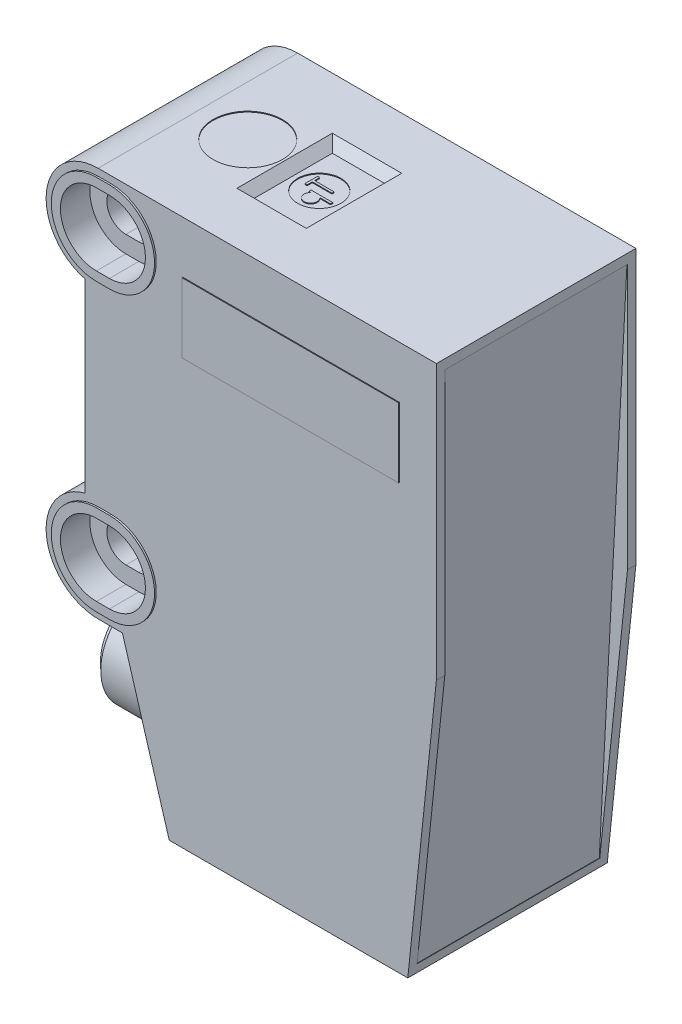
ISO-10303-21;
HEADER;
FILE_DESCRIPTION(('STEP AP214'),'2;1');
FILE_NAME('part.step','',(''),(''),'','','');
FILE_SCHEMA(('AUTOMOTIVE_DESIGN { 1 0 10303 214 1 1 1 1 }'));
ENDSEC;
DATA;
#1=APPLICATION_CONTEXT('core data for automotive mechanical design processes');
#2=APPLICATION_PROTOCOL_DEFINITION('international standard','automotive_design',2000,#1);
#3=PRODUCT_CONTEXT('',#1,'mechanical');
#4=PRODUCT('Part','Part','',(#3));
#5=PRODUCT_RELATED_PRODUCT_CATEGORY('part','',(#4));
#6=PRODUCT_DEFINITION_FORMATION('','',#4);
#7=PRODUCT_DEFINITION_CONTEXT('part definition',#1,'design');
#8=PRODUCT_DEFINITION('design','',#6,#7);
#9=PRODUCT_DEFINITION_SHAPE('','',#8);
#10=(LENGTH_UNIT() NAMED_UNIT(*) SI_UNIT(.MILLI.,.METRE.));
#11=(NAMED_UNIT(*) PLANE_ANGLE_UNIT() SI_UNIT($,.RADIAN.));
#12=(NAMED_UNIT(*) SI_UNIT($,.STERADIAN.) SOLID_ANGLE_UNIT());
#13=UNCERTAINTY_MEASURE_WITH_UNIT(LENGTH_MEASURE(1.E-05),#10,'distance_accuracy_value','');
#14=(GEOMETRIC_REPRESENTATION_CONTEXT(3) GLOBAL_UNCERTAINTY_ASSIGNED_CONTEXT((#13)) GLOBAL_UNIT_ASSIGNED_CONTEXT((#10,
#11,#12)) REPRESENTATION_CONTEXT('',''));
#15=CARTESIAN_POINT('',(0.,0.,0.));
#16=DIRECTION('',(0.,0.,1.));
#17=DIRECTION('',(1.,0.,0.));
#18=AXIS2_PLACEMENT_3D('',#15,#16,#17);
#19=CARTESIAN_POINT('',(-0.750000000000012,0.,11.5));
#20=DIRECTION('',(0.,0.,1.));
#21=DIRECTION('',(1.,0.,0.));
#22=AXIS2_PLACEMENT_3D('',#19,#20,#21);
#23=PLANE('',#22);
#24=DIRECTION('',(-1.,0.,0.));
#25=VECTOR('',#24,1.);
#26=CARTESIAN_POINT('',(0.75,38.2,11.5));
#27=LINE('',#26,#25);
#28=CARTESIAN_POINT('',(0.75,38.2,11.5));
#29=VERTEX_POINT('',#28);
#30=CARTESIAN_POINT('',(-0.75,38.2,11.5));
#31=VERTEX_POINT('',#30);
#32=EDGE_CURVE('E7',#29,#31,#27,.T.);
#33=ORIENTED_EDGE('',*,*,#32,.F.);
#34=CARTESIAN_POINT('',(0.75,33.,11.5));
#35=DIRECTION('',(0.,0.,1.));
#36=DIRECTION('',(0.,-1.,0.));
#37=AXIS2_PLACEMENT_3D('',#34,#35,#36);
#38=CIRCLE('',#37,5.2);
#39=CARTESIAN_POINT('',(0.75,27.8,11.5));
#40=VERTEX_POINT('',#39);
#41=EDGE_CURVE('E14',#40,#29,#38,.T.);
#42=ORIENTED_EDGE('',*,*,#41,.F.);
#43=DIRECTION('',(1.,0.,0.));
#44=VECTOR('',#43,1.);
#45=CARTESIAN_POINT('',(-0.75,27.8,11.5));
#46=LINE('',#45,#44);
#47=CARTESIAN_POINT('',(-0.75,27.8,11.5));
#48=VERTEX_POINT('',#47);
#49=EDGE_CURVE('E21',#48,#40,#46,.T.);
#50=ORIENTED_EDGE('',*,*,#49,.F.);
#51=CARTESIAN_POINT('',(-0.75,33.,11.5));
#52=DIRECTION('',(0.,0.,1.));
#53=DIRECTION('',(0.,1.,0.));
#54=AXIS2_PLACEMENT_3D('',#51,#52,#53);
#55=CIRCLE('',#54,5.2);
#56=EDGE_CURVE('E28',#31,#48,#55,.T.);
#57=ORIENTED_EDGE('',*,*,#56,.F.);
#58=EDGE_LOOP('',(#33,#42,#50,#57));
#59=FACE_BOUND('',#58,.T.);
#60=DIRECTION('',(-1.,0.,0.));
#61=VECTOR('',#60,1.);
#62=CARTESIAN_POINT('',(0.75,5.2,11.5));
#63=LINE('',#62,#61);
#64=CARTESIAN_POINT('',(0.75,5.2,11.5));
#65=VERTEX_POINT('',#64);
#66=CARTESIAN_POINT('',(-0.75,5.2,11.5));
#67=VERTEX_POINT('',#66);
#68=EDGE_CURVE('E36',#65,#67,#63,.T.);
#69=ORIENTED_EDGE('',*,*,#68,.F.);
#70=CARTESIAN_POINT('',(0.75,0.,11.5));
#71=DIRECTION('',(0.,0.,1.));
#72=DIRECTION('',(0.,-1.,0.));
#73=AXIS2_PLACEMENT_3D('',#70,#71,#72);
#74=CIRCLE('',#73,5.2);
#75=CARTESIAN_POINT('',(0.75,-5.2,11.5));
#76=VERTEX_POINT('',#75);
#77=EDGE_CURVE('E43',#76,#65,#74,.T.);
#78=ORIENTED_EDGE('',*,*,#77,.F.);
#79=DIRECTION('',(1.,0.,0.));
#80=VECTOR('',#79,1.);
#81=CARTESIAN_POINT('',(-0.75,-5.2,11.5));
#82=LINE('',#81,#80);
#83=CARTESIAN_POINT('',(-0.75,-5.2,11.5));
#84=VERTEX_POINT('',#83);
#85=EDGE_CURVE('E50',#84,#76,#82,.T.);
#86=ORIENTED_EDGE('',*,*,#85,.F.);
#87=CARTESIAN_POINT('',(-0.75,0.,11.5));
#88=DIRECTION('',(0.,0.,1.));
#89=DIRECTION('',(0.,1.,0.));
#90=AXIS2_PLACEMENT_3D('',#87,#88,#89);
#91=CIRCLE('',#90,5.2);
#92=EDGE_CURVE('E57',#67,#84,#91,.T.);
#93=ORIENTED_EDGE('',*,*,#92,.F.);
#94=EDGE_LOOP('',(#69,#78,#86,#93));
#95=FACE_BOUND('',#94,.T.);
#96=DIRECTION('',(0.,-1.,0.));
#97=VECTOR('',#96,1.);
#98=CARTESIAN_POINT('',(-2.25,27.190524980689,11.5));
#99=LINE('',#98,#97);
#100=CARTESIAN_POINT('',(-2.25,27.190524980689,11.5));
#101=VERTEX_POINT('',#100);
#102=CARTESIAN_POINT('',(-2.25,5.8094750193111,11.5));
#103=VERTEX_POINT('',#102);
#104=EDGE_CURVE('E65',#101,#103,#99,.T.);
#105=ORIENTED_EDGE('',*,*,#104,.T.);
#106=CARTESIAN_POINT('',(-0.750000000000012,0.,11.5));
#107=DIRECTION('',(0.,0.,1.));
#108=DIRECTION('',(-0.249999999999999,0.968245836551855,0.));
#109=AXIS2_PLACEMENT_3D('',#106,#107,#108);
#110=CIRCLE('',#109,6.);
#111=CARTESIAN_POINT('',(-0.75,-6.,11.5));
#112=VERTEX_POINT('',#111);
#113=EDGE_CURVE('E72',#103,#112,#110,.T.);
#114=ORIENTED_EDGE('',*,*,#113,.T.);
#115=DIRECTION('',(1.,0.,0.));
#116=VECTOR('',#115,1.);
#117=CARTESIAN_POINT('',(-0.75,-6.,11.5));
#118=LINE('',#117,#116);
#119=CARTESIAN_POINT('',(2.0497411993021,-6.,11.5));
#120=VERTEX_POINT('',#119);
#121=EDGE_CURVE('E79',#112,#120,#118,.T.);
#122=ORIENTED_EDGE('',*,*,#121,.T.);
#123=DIRECTION('',(0.287360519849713,-0.957822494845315,0.));
#124=VECTOR('',#123,1.);
#125=CARTESIAN_POINT('',(2.0497411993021,-6.,11.5));
#126=LINE('',#125,#124);
#127=CARTESIAN_POINT('',(7.45,-24.,11.5));
#128=VERTEX_POINT('',#127);
#129=EDGE_CURVE('E86',#120,#128,#126,.T.);
#130=ORIENTED_EDGE('',*,*,#129,.T.);
#131=DIRECTION('',(1.,0.,0.));
#132=VECTOR('',#131,1.);
#133=CARTESIAN_POINT('',(7.45,-24.,11.5));
#134=LINE('',#133,#132);
#135=CARTESIAN_POINT('',(34.95,-24.,11.5));
#136=VERTEX_POINT('',#135);
#137=EDGE_CURVE('E93',#128,#136,#134,.T.);
#138=ORIENTED_EDGE('',*,*,#137,.T.);
#139=DIRECTION('',(0.104528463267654,0.994521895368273,0.));
#140=VECTOR('',#139,1.);
#141=CARTESIAN_POINT('',(34.95,-24.,11.5));
#142=LINE('',#141,#140);
#143=CARTESIAN_POINT('',(38.25,7.3974026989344,11.5));
#144=VERTEX_POINT('',#143);
#145=EDGE_CURVE('E100',#136,#144,#142,.T.);
#146=ORIENTED_EDGE('',*,*,#145,.T.);
#147=DIRECTION('',(0.,1.,0.));
#148=VECTOR('',#147,1.);
#149=CARTESIAN_POINT('',(38.25,7.3974026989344,11.5));
#150=LINE('',#149,#148);
#151=CARTESIAN_POINT('',(38.25,39.,11.5));
#152=VERTEX_POINT('',#151);
#153=EDGE_CURVE('E107',#144,#152,#150,.T.);
#154=ORIENTED_EDGE('',*,*,#153,.T.);
#155=DIRECTION('',(-1.,0.,0.));
#156=VECTOR('',#155,1.);
#157=CARTESIAN_POINT('',(38.25,39.,11.5));
#158=LINE('',#157,#156);
#159=CARTESIAN_POINT('',(-0.75,39.,11.5));
#160=VERTEX_POINT('',#159);
#161=EDGE_CURVE('E114',#152,#160,#158,.T.);
#162=ORIENTED_EDGE('',*,*,#161,.T.);
#163=CARTESIAN_POINT('',(-0.75,33.,11.5));
#164=DIRECTION('',(0.,0.,1.));
#165=DIRECTION('',(0.,1.,0.));
#166=AXIS2_PLACEMENT_3D('',#163,#164,#165);
#167=CIRCLE('',#166,6.);
#168=EDGE_CURVE('E121',#160,#101,#167,.T.);
#169=ORIENTED_EDGE('',*,*,#168,.T.);
#170=EDGE_LOOP('',(#105,#114,#122,#130,#138,#146,#154,#162,#169));
#171=FACE_BOUND('',#170,.T.);
#172=DIRECTION('',(0.,1.,0.));
#173=VECTOR('',#172,1.);
#174=CARTESIAN_POINT('',(9.,25.,11.5));
#175=LINE('',#174,#173);
#176=CARTESIAN_POINT('',(9.,25.,11.5));
#177=VERTEX_POINT('',#176);
#178=CARTESIAN_POINT('',(9.,33.,11.5));
#179=VERTEX_POINT('',#178);
#180=EDGE_CURVE('E129',#177,#179,#175,.T.);
#181=ORIENTED_EDGE('',*,*,#180,.T.);
#182=DIRECTION('',(1.,0.,0.));
#183=VECTOR('',#182,1.);
#184=CARTESIAN_POINT('',(9.,33.,11.5));
#185=LINE('',#184,#183);
#186=CARTESIAN_POINT('',(34.,33.,11.5));
#187=VERTEX_POINT('',#186);
#188=EDGE_CURVE('E136',#179,#187,#185,.T.);
#189=ORIENTED_EDGE('',*,*,#188,.T.);
#190=DIRECTION('',(0.,-1.,0.));
#191=VECTOR('',#190,1.);
#192=CARTESIAN_POINT('',(34.,33.,11.5));
#193=LINE('',#192,#191);
#194=CARTESIAN_POINT('',(34.,25.,11.5));
#195=VERTEX_POINT('',#194);
#196=EDGE_CURVE('E143',#187,#195,#193,.T.);
#197=ORIENTED_EDGE('',*,*,#196,.T.);
#198=DIRECTION('',(-1.,0.,0.));
#199=VECTOR('',#198,1.);
#200=CARTESIAN_POINT('',(34.,25.,11.5));
#201=LINE('',#200,#199);
#202=EDGE_CURVE('E150',#195,#177,#201,.T.);
#203=ORIENTED_EDGE('',*,*,#202,.T.);
#204=EDGE_LOOP('',(#181,#189,#197,#203));
#205=FACE_BOUND('',#204,.T.);
#206=ADVANCED_FACE('F156',(#59,#95,#171,#205),#23,.T.);
#207=CARTESIAN_POINT('',(-0.750000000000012,0.,-11.5));
#208=DIRECTION('',(0.,0.,1.));
#209=DIRECTION('',(1.,0.,0.));
#210=AXIS2_PLACEMENT_3D('',#207,#208,#209);
#211=PLANE('',#210);
#212=DIRECTION('',(0.,-1.,0.));
#213=VECTOR('',#212,1.);
#214=CARTESIAN_POINT('',(-2.25,27.190524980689,-11.5));
#215=LINE('',#214,#213);
#216=CARTESIAN_POINT('',(-2.25,27.190524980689,-11.5));
#217=VERTEX_POINT('',#216);
#218=CARTESIAN_POINT('',(-2.25,5.8094750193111,-11.5));
#219=VERTEX_POINT('',#218);
#220=EDGE_CURVE('E169',#217,#219,#215,.T.);
#221=ORIENTED_EDGE('',*,*,#220,.F.);
#222=CARTESIAN_POINT('',(-0.75,33.,-11.5));
#223=DIRECTION('',(0.,0.,1.));
#224=DIRECTION('',(0.,1.,0.));
#225=AXIS2_PLACEMENT_3D('',#222,#223,#224);
#226=CIRCLE('',#225,6.);
#227=CARTESIAN_POINT('',(-0.75,39.,-11.5));
#228=VERTEX_POINT('',#227);
#229=EDGE_CURVE('E176',#228,#217,#226,.T.);
#230=ORIENTED_EDGE('',*,*,#229,.F.);
#231=DIRECTION('',(-1.,0.,0.));
#232=VECTOR('',#231,1.);
#233=CARTESIAN_POINT('',(38.25,39.,-11.5));
#234=LINE('',#233,#232);
#235=CARTESIAN_POINT('',(38.25,39.,-11.5));
#236=VERTEX_POINT('',#235);
#237=EDGE_CURVE('E183',#236,#228,#234,.T.);
#238=ORIENTED_EDGE('',*,*,#237,.F.);
#239=DIRECTION('',(0.,1.,0.));
#240=VECTOR('',#239,1.);
#241=CARTESIAN_POINT('',(38.25,7.3974026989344,-11.5));
#242=LINE('',#241,#240);
#243=CARTESIAN_POINT('',(38.25,7.3974026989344,-11.5));
#244=VERTEX_POINT('',#243);
#245=EDGE_CURVE('E190',#244,#236,#242,.T.);
#246=ORIENTED_EDGE('',*,*,#245,.F.);
#247=DIRECTION('',(0.104528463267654,0.994521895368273,0.));
#248=VECTOR('',#247,1.);
#249=CARTESIAN_POINT('',(34.95,-24.,-11.5));
#250=LINE('',#249,#248);
#251=CARTESIAN_POINT('',(34.95,-24.,-11.5));
#252=VERTEX_POINT('',#251);
#253=EDGE_CURVE('E197',#252,#244,#250,.T.);
#254=ORIENTED_EDGE('',*,*,#253,.F.);
#255=DIRECTION('',(1.,0.,0.));
#256=VECTOR('',#255,1.);
#257=CARTESIAN_POINT('',(7.45,-24.,-11.5));
#258=LINE('',#257,#256);
#259=CARTESIAN_POINT('',(7.45,-24.,-11.5));
#260=VERTEX_POINT('',#259);
#261=EDGE_CURVE('E204',#260,#252,#258,.T.);
#262=ORIENTED_EDGE('',*,*,#261,.F.);
#263=DIRECTION('',(0.287360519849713,-0.957822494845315,0.));
#264=VECTOR('',#263,1.);
#265=CARTESIAN_POINT('',(2.0497411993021,-6.,-11.5));
#266=LINE('',#265,#264);
#267=CARTESIAN_POINT('',(2.0497411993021,-6.,-11.5));
#268=VERTEX_POINT('',#267);
#269=EDGE_CURVE('E211',#268,#260,#266,.T.);
#270=ORIENTED_EDGE('',*,*,#269,.F.);
#271=DIRECTION('',(1.,0.,0.));
#272=VECTOR('',#271,1.);
#273=CARTESIAN_POINT('',(-0.75,-6.,-11.5));
#274=LINE('',#273,#272);
#275=CARTESIAN_POINT('',(-0.75,-6.,-11.5));
#276=VERTEX_POINT('',#275);
#277=EDGE_CURVE('E218',#276,#268,#274,.T.);
#278=ORIENTED_EDGE('',*,*,#277,.F.);
#279=CARTESIAN_POINT('',(-0.750000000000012,0.,-11.5));
#280=DIRECTION('',(0.,0.,1.));
#281=DIRECTION('',(-0.249999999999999,0.968245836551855,0.));
#282=AXIS2_PLACEMENT_3D('',#279,#280,#281);
#283=CIRCLE('',#282,6.);
#284=EDGE_CURVE('E225',#219,#276,#283,.T.);
#285=ORIENTED_EDGE('',*,*,#284,.F.);
#286=EDGE_LOOP('',(#221,#230,#238,#246,#254,#262,#270,#278,#285));
#287=FACE_BOUND('',#286,.T.);
#288=CARTESIAN_POINT('',(0.75,0.,-11.5));
#289=DIRECTION('',(0.,0.,1.));
#290=DIRECTION('',(0.,-1.,0.));
#291=AXIS2_PLACEMENT_3D('',#288,#289,#290);
#292=CIRCLE('',#291,5.2);
#293=CARTESIAN_POINT('',(0.75,-5.2,-11.5));
#294=VERTEX_POINT('',#293);
#295=CARTESIAN_POINT('',(0.75,5.2,-11.5));
#296=VERTEX_POINT('',#295);
#297=EDGE_CURVE('E233',#294,#296,#292,.T.);
#298=ORIENTED_EDGE('',*,*,#297,.T.);
#299=DIRECTION('',(-1.,0.,0.));
#300=VECTOR('',#299,1.);
#301=CARTESIAN_POINT('',(0.75,5.2,-11.5));
#302=LINE('',#301,#300);
#303=CARTESIAN_POINT('',(-0.75,5.2,-11.5));
#304=VERTEX_POINT('',#303);
#305=EDGE_CURVE('E240',#296,#304,#302,.T.);
#306=ORIENTED_EDGE('',*,*,#305,.T.);
#307=CARTESIAN_POINT('',(-0.75,0.,-11.5));
#308=DIRECTION('',(0.,0.,1.));
#309=DIRECTION('',(0.,1.,0.));
#310=AXIS2_PLACEMENT_3D('',#307,#308,#309);
#311=CIRCLE('',#310,5.2);
#312=CARTESIAN_POINT('',(-0.75,-5.2,-11.5));
#313=VERTEX_POINT('',#312);
#314=EDGE_CURVE('E247',#304,#313,#311,.T.);
#315=ORIENTED_EDGE('',*,*,#314,.T.);
#316=DIRECTION('',(1.,0.,0.));
#317=VECTOR('',#316,1.);
#318=CARTESIAN_POINT('',(-0.75,-5.2,-11.5));
#319=LINE('',#318,#317);
#320=EDGE_CURVE('E254',#313,#294,#319,.T.);
#321=ORIENTED_EDGE('',*,*,#320,.T.);
#322=EDGE_LOOP('',(#298,#306,#315,#321));
#323=FACE_BOUND('',#322,.T.);
#324=CARTESIAN_POINT('',(0.75,33.,-11.5));
#325=DIRECTION('',(0.,0.,1.));
#326=DIRECTION('',(0.,-1.,0.));
#327=AXIS2_PLACEMENT_3D('',#324,#325,#326);
#328=CIRCLE('',#327,5.2);
#329=CARTESIAN_POINT('',(0.75,27.8,-11.5));
#330=VERTEX_POINT('',#329);
#331=CARTESIAN_POINT('',(0.75,38.2,-11.5));
#332=VERTEX_POINT('',#331);
#333=EDGE_CURVE('E262',#330,#332,#328,.T.);
#334=ORIENTED_EDGE('',*,*,#333,.T.);
#335=DIRECTION('',(-1.,0.,0.));
#336=VECTOR('',#335,1.);
#337=CARTESIAN_POINT('',(0.75,38.2,-11.5));
#338=LINE('',#337,#336);
#339=CARTESIAN_POINT('',(-0.75,38.2,-11.5));
#340=VERTEX_POINT('',#339);
#341=EDGE_CURVE('E269',#332,#340,#338,.T.);
#342=ORIENTED_EDGE('',*,*,#341,.T.);
#343=CARTESIAN_POINT('',(-0.75,33.,-11.5));
#344=DIRECTION('',(0.,0.,1.));
#345=DIRECTION('',(0.,1.,0.));
#346=AXIS2_PLACEMENT_3D('',#343,#344,#345);
#347=CIRCLE('',#346,5.2);
#348=CARTESIAN_POINT('',(-0.75,27.8,-11.5));
#349=VERTEX_POINT('',#348);
#350=EDGE_CURVE('E276',#340,#349,#347,.T.);
#351=ORIENTED_EDGE('',*,*,#350,.T.);
#352=DIRECTION('',(1.,0.,0.));
#353=VECTOR('',#352,1.);
#354=CARTESIAN_POINT('',(-0.75,27.8,-11.5));
#355=LINE('',#354,#353);
#356=EDGE_CURVE('E283',#349,#330,#355,.T.);
#357=ORIENTED_EDGE('',*,*,#356,.T.);
#358=EDGE_LOOP('',(#334,#342,#351,#357));
#359=FACE_BOUND('',#358,.T.);
#360=DIRECTION('',(1.,0.,0.));
#361=VECTOR('',#360,1.);
#362=CARTESIAN_POINT('',(9.,33.,-11.5));
#363=LINE('',#362,#361);
#364=CARTESIAN_POINT('',(9.,33.,-11.5));
#365=VERTEX_POINT('',#364);
#366=CARTESIAN_POINT('',(34.,33.,-11.5));
#367=VERTEX_POINT('',#366);
#368=EDGE_CURVE('E291',#365,#367,#363,.T.);
#369=ORIENTED_EDGE('',*,*,#368,.F.);
#370=DIRECTION('',(0.,1.,0.));
#371=VECTOR('',#370,1.);
#372=CARTESIAN_POINT('',(9.,25.,-11.5));
#373=LINE('',#372,#371);
#374=CARTESIAN_POINT('',(9.,25.,-11.5));
#375=VERTEX_POINT('',#374);
#376=EDGE_CURVE('E298',#375,#365,#373,.T.);
#377=ORIENTED_EDGE('',*,*,#376,.F.);
#378=DIRECTION('',(-1.,0.,0.));
#379=VECTOR('',#378,1.);
#380=CARTESIAN_POINT('',(34.,25.,-11.5));
#381=LINE('',#380,#379);
#382=CARTESIAN_POINT('',(34.,25.,-11.5));
#383=VERTEX_POINT('',#382);
#384=EDGE_CURVE('E305',#383,#375,#381,.T.);
#385=ORIENTED_EDGE('',*,*,#384,.F.);
#386=DIRECTION('',(0.,-1.,0.));
#387=VECTOR('',#386,1.);
#388=CARTESIAN_POINT('',(34.,33.,-11.5));
#389=LINE('',#388,#387);
#390=EDGE_CURVE('E312',#367,#383,#389,.T.);
#391=ORIENTED_EDGE('',*,*,#390,.F.);
#392=EDGE_LOOP('',(#369,#377,#385,#391));
#393=FACE_BOUND('',#392,.T.);
#394=ADVANCED_FACE('F318',(#287,#323,#359,#393),#211,.F.);
#395=CARTESIAN_POINT('',(2.05,-14.,0.));
#396=DIRECTION('',(-1.,0.,0.));
#397=DIRECTION('',(0.,0.,1.));
#398=AXIS2_PLACEMENT_3D('',#395,#396,#397);
#399=CYLINDRICAL_SURFACE('',#398,0.5);
#400=CARTESIAN_POINT('',(2.05,-14.,0.));
#401=DIRECTION('',(-1.,0.,0.));
#402=DIRECTION('',(0.,1.,0.));
#403=AXIS2_PLACEMENT_3D('',#400,#401,#402);
#404=CIRCLE('',#403,0.5);
#405=CARTESIAN_POINT('',(2.05,-13.5,0.));
#406=VERTEX_POINT('',#405);
#407=EDGE_CURVE('E325',#406,#406,#404,.T.);
#408=ORIENTED_EDGE('',*,*,#407,.T.);
#409=EDGE_LOOP('',(#408));
#410=FACE_BOUND('',#409,.T.);
#411=CARTESIAN_POINT('',(-5.25,-14.,0.));
#412=DIRECTION('',(1.,0.,0.));
#413=DIRECTION('',(0.,0.,1.));
#414=AXIS2_PLACEMENT_3D('',#411,#412,#413);
#415=CIRCLE('',#414,0.5);
#416=CARTESIAN_POINT('',(-5.25,-14.,0.5));
#417=VERTEX_POINT('',#416);
#418=EDGE_CURVE('E329',#417,#417,#415,.T.);
#419=ORIENTED_EDGE('',*,*,#418,.T.);
#420=EDGE_LOOP('',(#419));
#421=FACE_BOUND('',#420,.T.);
#422=ADVANCED_FACE('F333',(#410,#421),#399,.T.);
#423=CARTESIAN_POINT('',(2.05,-16.5,-2.5));
#424=DIRECTION('',(-1.,0.,0.));
#425=DIRECTION('',(0.,0.,1.));
#426=AXIS2_PLACEMENT_3D('',#423,#424,#425);
#427=CYLINDRICAL_SURFACE('',#426,0.5);
#428=CARTESIAN_POINT('',(2.05,-16.5,-2.5));
#429=DIRECTION('',(-1.,0.,0.));
#430=DIRECTION('',(0.,1.,0.));
#431=AXIS2_PLACEMENT_3D('',#428,#429,#430);
#432=CIRCLE('',#431,0.5);
#433=CARTESIAN_POINT('',(2.05,-16.,-2.5));
#434=VERTEX_POINT('',#433);
#435=EDGE_CURVE('E340',#434,#434,#432,.T.);
#436=ORIENTED_EDGE('',*,*,#435,.T.);
#437=EDGE_LOOP('',(#436));
#438=FACE_BOUND('',#437,.T.);
#439=CARTESIAN_POINT('',(-5.25,-16.5,-2.5));
#440=DIRECTION('',(1.,0.,0.));
#441=DIRECTION('',(0.,0.,1.));
#442=AXIS2_PLACEMENT_3D('',#439,#440,#441);
#443=CIRCLE('',#442,0.5);
#444=CARTESIAN_POINT('',(-5.25,-16.5,-2.));
#445=VERTEX_POINT('',#444);
#446=EDGE_CURVE('E344',#445,#445,#443,.T.);
#447=ORIENTED_EDGE('',*,*,#446,.T.);
#448=EDGE_LOOP('',(#447));
#449=FACE_BOUND('',#448,.T.);
#450=ADVANCED_FACE('F348',(#438,#449),#427,.T.);
#451=CARTESIAN_POINT('',(2.05,-16.5,0.));
#452=DIRECTION('',(-1.,0.,0.));
#453=DIRECTION('',(0.,0.,1.));
#454=AXIS2_PLACEMENT_3D('',#451,#452,#453);
#455=CYLINDRICAL_SURFACE('',#454,0.5);
#456=CARTESIAN_POINT('',(2.05,-16.5,0.));
#457=DIRECTION('',(-1.,0.,0.));
#458=DIRECTION('',(0.,1.,0.));
#459=AXIS2_PLACEMENT_3D('',#456,#457,#458);
#460=CIRCLE('',#459,0.5);
#461=CARTESIAN_POINT('',(2.05,-16.,0.));
#462=VERTEX_POINT('',#461);
#463=EDGE_CURVE('E355',#462,#462,#460,.T.);
#464=ORIENTED_EDGE('',*,*,#463,.T.);
#465=EDGE_LOOP('',(#464));
#466=FACE_BOUND('',#465,.T.);
#467=CARTESIAN_POINT('',(-5.25,-16.5,0.));
#468=DIRECTION('',(1.,0.,0.));
#469=DIRECTION('',(0.,0.,1.));
#470=AXIS2_PLACEMENT_3D('',#467,#468,#469);
#471=CIRCLE('',#470,0.5);
#472=CARTESIAN_POINT('',(-5.25,-16.5,0.5));
#473=VERTEX_POINT('',#472);
#474=EDGE_CURVE('E359',#473,#473,#471,.T.);
#475=ORIENTED_EDGE('',*,*,#474,.T.);
#476=EDGE_LOOP('',(#475));
#477=FACE_BOUND('',#476,.T.);
#478=ADVANCED_FACE('F363',(#466,#477),#455,.T.);
#479=CARTESIAN_POINT('',(2.05,-16.5,2.5));
#480=DIRECTION('',(-1.,0.,0.));
#481=DIRECTION('',(0.,0.,1.));
#482=AXIS2_PLACEMENT_3D('',#479,#480,#481);
#483=CYLINDRICAL_SURFACE('',#482,0.5);
#484=CARTESIAN_POINT('',(2.05,-16.5,2.5));
#485=DIRECTION('',(-1.,0.,0.));
#486=DIRECTION('',(0.,1.,0.));
#487=AXIS2_PLACEMENT_3D('',#484,#485,#486);
#488=CIRCLE('',#487,0.5);
#489=CARTESIAN_POINT('',(2.05,-16.,2.5));
#490=VERTEX_POINT('',#489);
#491=EDGE_CURVE('E370',#490,#490,#488,.T.);
#492=ORIENTED_EDGE('',*,*,#491,.T.);
#493=EDGE_LOOP('',(#492));
#494=FACE_BOUND('',#493,.T.);
#495=CARTESIAN_POINT('',(-5.25,-16.5,2.5));
#496=DIRECTION('',(1.,0.,0.));
#497=DIRECTION('',(0.,0.,1.));
#498=AXIS2_PLACEMENT_3D('',#495,#496,#497);
#499=CIRCLE('',#498,0.5);
#500=CARTESIAN_POINT('',(-5.25,-16.5,3.));
#501=VERTEX_POINT('',#500);
#502=EDGE_CURVE('E374',#501,#501,#499,.T.);
#503=ORIENTED_EDGE('',*,*,#502,.T.);
#504=EDGE_LOOP('',(#503));
#505=FACE_BOUND('',#504,.T.);
#506=ADVANCED_FACE('F378',(#494,#505),#483,.T.);
#507=CARTESIAN_POINT('',(2.05,-19.,0.));
#508=DIRECTION('',(-1.,0.,0.));
#509=DIRECTION('',(0.,0.,1.));
#510=AXIS2_PLACEMENT_3D('',#507,#508,#509);
#511=CYLINDRICAL_SURFACE('',#510,0.5);
#512=CARTESIAN_POINT('',(2.05,-19.,0.));
#513=DIRECTION('',(-1.,0.,0.));
#514=DIRECTION('',(0.,1.,0.));
#515=AXIS2_PLACEMENT_3D('',#512,#513,#514);
#516=CIRCLE('',#515,0.5);
#517=CARTESIAN_POINT('',(2.05,-18.5,0.));
#518=VERTEX_POINT('',#517);
#519=EDGE_CURVE('E385',#518,#518,#516,.T.);
#520=ORIENTED_EDGE('',*,*,#519,.T.);
#521=EDGE_LOOP('',(#520));
#522=FACE_BOUND('',#521,.T.);
#523=CARTESIAN_POINT('',(-5.25,-19.,0.));
#524=DIRECTION('',(1.,0.,0.));
#525=DIRECTION('',(0.,0.,1.));
#526=AXIS2_PLACEMENT_3D('',#523,#524,#525);
#527=CIRCLE('',#526,0.5);
#528=CARTESIAN_POINT('',(-5.25,-19.,0.5));
#529=VERTEX_POINT('',#528);
#530=EDGE_CURVE('E389',#529,#529,#527,.T.);
#531=ORIENTED_EDGE('',*,*,#530,.T.);
#532=EDGE_LOOP('',(#531));
#533=FACE_BOUND('',#532,.T.);
#534=ADVANCED_FACE('F393',(#522,#533),#511,.T.);
#535=CARTESIAN_POINT('',(2.05,-13.558435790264,2.1496046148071));
#536=DIRECTION('',(0.,-0.707106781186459,0.707106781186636));
#537=DIRECTION('',(0.,-0.707106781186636,-0.707106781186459));
#538=AXIS2_PLACEMENT_3D('',#535,#536,#537);
#539=PLANE('',#538);
#540=DIRECTION('',(0.,-0.707106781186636,-0.70710678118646));
#541=VECTOR('',#540,1.);
#542=CARTESIAN_POINT('',(-6.45,-13.1606887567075,2.5473516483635));
#543=LINE('',#542,#541);
#544=CARTESIAN_POINT('',(-6.45,-13.1606887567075,2.54735164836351));
#545=VERTEX_POINT('',#544);
#546=CARTESIAN_POINT('',(-6.45,-13.558435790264,2.1496046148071));
#547=VERTEX_POINT('',#546);
#548=EDGE_CURVE('E402',#545,#547,#543,.T.);
#549=ORIENTED_EDGE('',*,*,#548,.F.);
#550=DIRECTION('',(-1.,0.,0.));
#551=VECTOR('',#550,1.);
#552=CARTESIAN_POINT('',(2.05,-13.1606887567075,2.5473516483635));
#553=LINE('',#552,#551);
#554=CARTESIAN_POINT('',(2.05,-13.1606887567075,2.5473516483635));
#555=VERTEX_POINT('',#554);
#556=EDGE_CURVE('E409',#555,#545,#553,.T.);
#557=ORIENTED_EDGE('',*,*,#556,.F.);
#558=DIRECTION('',(0.,0.707106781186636,0.707106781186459));
#559=VECTOR('',#558,1.);
#560=CARTESIAN_POINT('',(2.05,-13.558435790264,2.1496046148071));
#561=LINE('',#560,#559);
#562=CARTESIAN_POINT('',(2.05,-13.558435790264,2.1496046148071));
#563=VERTEX_POINT('',#562);
#564=EDGE_CURVE('E416',#563,#555,#561,.T.);
#565=ORIENTED_EDGE('',*,*,#564,.F.);
#566=DIRECTION('',(-1.,0.,0.));
#567=VECTOR('',#566,1.);
#568=CARTESIAN_POINT('',(2.05,-13.558435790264,2.1496046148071));
#569=LINE('',#568,#567);
#570=EDGE_CURVE('E423',#563,#547,#569,.T.);
#571=ORIENTED_EDGE('',*,*,#570,.T.);
#572=EDGE_LOOP('',(#549,#557,#565,#571));
#573=FACE_BOUND('',#572,.T.);
#574=ADVANCED_FACE('F429',(#573),#539,.F.);
#575=CARTESIAN_POINT('',(2.05,-13.9526483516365,3.3393112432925));
#576=DIRECTION('',(0.,0.707106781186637,-0.707106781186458));
#577=DIRECTION('',(0.,0.707106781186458,0.707106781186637));
#578=AXIS2_PLACEMENT_3D('',#575,#576,#577);
#579=PLANE('',#578);
#580=DIRECTION('',(0.,0.707106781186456,0.707106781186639));
#581=VECTOR('',#580,1.);
#582=CARTESIAN_POINT('',(-6.45,-14.3503953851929,2.941564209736));
#583=LINE('',#582,#581);
#584=CARTESIAN_POINT('',(-6.45,-14.3503953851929,2.941564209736));
#585=VERTEX_POINT('',#584);
#586=CARTESIAN_POINT('',(-6.45,-13.9526483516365,3.3393112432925));
#587=VERTEX_POINT('',#586);
#588=EDGE_CURVE('E438',#585,#587,#583,.T.);
#589=ORIENTED_EDGE('',*,*,#588,.F.);
#590=DIRECTION('',(-1.,0.,0.));
#591=VECTOR('',#590,1.);
#592=CARTESIAN_POINT('',(2.05,-14.3503953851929,2.941564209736));
#593=LINE('',#592,#591);
#594=CARTESIAN_POINT('',(2.05,-14.3503953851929,2.941564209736));
#595=VERTEX_POINT('',#594);
#596=EDGE_CURVE('E445',#595,#585,#593,.T.);
#597=ORIENTED_EDGE('',*,*,#596,.F.);
#598=DIRECTION('',(0.,-0.707106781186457,-0.707106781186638));
#599=VECTOR('',#598,1.);
#600=CARTESIAN_POINT('',(2.05,-13.9526483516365,3.3393112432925));
#601=LINE('',#600,#599);
#602=CARTESIAN_POINT('',(2.05,-13.9526483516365,3.3393112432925));
#603=VERTEX_POINT('',#602);
#604=EDGE_CURVE('E452',#603,#595,#601,.T.);
#605=ORIENTED_EDGE('',*,*,#604,.F.);
#606=DIRECTION('',(-1.,0.,0.));
#607=VECTOR('',#606,1.);
#608=CARTESIAN_POINT('',(2.05,-13.9526483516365,3.3393112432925));
#609=LINE('',#608,#607);
#610=EDGE_CURVE('E459',#603,#587,#609,.T.);
#611=ORIENTED_EDGE('',*,*,#610,.T.);
#612=EDGE_LOOP('',(#589,#597,#605,#611));
#613=FACE_BOUND('',#612,.T.);
#614=ADVANCED_FACE('F465',(#613),#579,.F.);
#615=CARTESIAN_POINT('',(2.05,-13.9544155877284,2.54558441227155));
#616=DIRECTION('',(-1.,0.,0.));
#617=DIRECTION('',(0.,0.,1.));
#618=AXIS2_PLACEMENT_3D('',#615,#616,#617);
#619=CYLINDRICAL_SURFACE('',#618,0.559999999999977);
#620=ORIENTED_EDGE('',*,*,#596,.T.);
#621=CARTESIAN_POINT('',(-6.45,-13.9544155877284,2.54558441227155));
#622=DIRECTION('',(1.,0.,0.));
#623=DIRECTION('',(0.,-0.707106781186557,0.707106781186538));
#624=AXIS2_PLACEMENT_3D('',#621,#622,#623);
#625=CIRCLE('',#624,0.559999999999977);
#626=EDGE_CURVE('E475',#585,#547,#625,.T.);
#627=ORIENTED_EDGE('',*,*,#626,.T.);
#628=ORIENTED_EDGE('',*,*,#570,.F.);
#629=CARTESIAN_POINT('',(2.05,-13.9544155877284,2.54558441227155));
#630=DIRECTION('',(-1.,0.,0.));
#631=DIRECTION('',(0.,0.707106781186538,-0.707106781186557));
#632=AXIS2_PLACEMENT_3D('',#629,#630,#631);
#633=CIRCLE('',#632,0.559999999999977);
#634=EDGE_CURVE('E481',#563,#595,#633,.T.);
#635=ORIENTED_EDGE('',*,*,#634,.T.);
#636=EDGE_LOOP('',(#620,#627,#628,#635));
#637=FACE_BOUND('',#636,.T.);
#638=ADVANCED_FACE('F485',(#637),#619,.T.);
#639=CARTESIAN_POINT('',(2.0497411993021,-6.,11.5));
#640=DIRECTION('',(0.957822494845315,0.287360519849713,0.));
#641=DIRECTION('',(-0.287360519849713,0.957822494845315,0.));
#642=AXIS2_PLACEMENT_3D('',#639,#640,#641);
#643=PLANE('',#642);
#644=ORIENTED_EDGE('',*,*,#269,.T.);
#645=DIRECTION('',(0.,0.,-1.));
#646=VECTOR('',#645,1.);
#647=CARTESIAN_POINT('',(7.45,-24.,11.5));
#648=LINE('',#647,#646);
#649=EDGE_CURVE('E495',#128,#260,#648,.T.);
#650=ORIENTED_EDGE('',*,*,#649,.F.);
#651=ORIENTED_EDGE('',*,*,#129,.F.);
#652=DIRECTION('',(0.,0.,-1.));
#653=VECTOR('',#652,1.);
#654=CARTESIAN_POINT('',(2.0497411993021,-6.,11.5));
#655=LINE('',#654,#653);
#656=EDGE_CURVE('E501',#120,#268,#655,.T.);
#657=ORIENTED_EDGE('',*,*,#656,.T.);
#658=EDGE_LOOP('',(#644,#650,#651,#657));
#659=FACE_BOUND('',#658,.T.);
#660=DIRECTION('',(-0.287360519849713,0.957822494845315,0.));
#661=VECTOR('',#660,1.);
#662=CARTESIAN_POINT('',(5.19989216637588,-16.5,6.5));
#663=LINE('',#662,#661);
#664=CARTESIAN_POINT('',(5.19989216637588,-16.5,6.5));
#665=VERTEX_POINT('',#664);
#666=CARTESIAN_POINT('',(2.05,-6.00086262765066,6.5));
#667=VERTEX_POINT('',#666);
#668=EDGE_CURVE('E507',#665,#667,#663,.T.);
#669=ORIENTED_EDGE('',*,*,#668,.F.);
#670=CARTESIAN_POINT('',(5.19989216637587,-16.5,-6.5));
#671=CARTESIAN_POINT('',(5.21584079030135,-16.553159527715,-6.50000009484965));
#672=CARTESIAN_POINT('',(5.23178935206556,-16.6063190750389,-6.49934786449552));
#673=CARTESIAN_POINT('',(5.26368133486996,-16.7126212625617,-6.49673912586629));
#674=CARTESIAN_POINT('',(5.27962475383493,-16.7657638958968,-6.49478231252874));
#675=CARTESIAN_POINT('',(5.31149539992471,-16.8719951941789,-6.48956454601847));
#676=CARTESIAN_POINT('',(5.32742262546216,-16.925083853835,-6.48630347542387));
#677=CARTESIAN_POINT('',(5.35924983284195,-17.0311701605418,-6.47847875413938));
#678=CARTESIAN_POINT('',(5.37514981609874,-17.084167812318,-6.47391517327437));
#679=CARTESIAN_POINT('',(5.40691148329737,-17.1900351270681,-6.46348823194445));
#680=CARTESIAN_POINT('',(5.42277317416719,-17.2429048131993,-6.45762512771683));
#681=CARTESIAN_POINT('',(5.45444720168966,-17.3484793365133,-6.44460322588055));
#682=CARTESIAN_POINT('',(5.47025955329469,-17.4011842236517,-6.4374448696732));
#683=CARTESIAN_POINT('',(5.50182383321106,-17.5063924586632,-6.4218378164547));
#684=CARTESIAN_POINT('',(5.51757578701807,-17.5588958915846,-6.41338974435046));
#685=CARTESIAN_POINT('',(5.54900830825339,-17.6636649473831,-6.39520984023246));
#686=CARTESIAN_POINT('',(5.56468891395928,-17.7159306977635,-6.38547880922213));
#687=CARTESIAN_POINT('',(5.59597405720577,-17.8202099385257,-6.36473650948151));
#688=CARTESIAN_POINT('',(5.61157861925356,-17.8722235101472,-6.35372568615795));
#689=CARTESIAN_POINT('',(5.64270550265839,-17.9759770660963,-6.33042795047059));
#690=CARTESIAN_POINT('',(5.65822783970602,-18.0277171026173,-6.31814129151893));
#691=CARTESIAN_POINT('',(5.68917988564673,-18.1308881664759,-6.29229933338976));
#692=CARTESIAN_POINT('',(5.70460962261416,-18.1823192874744,-6.27874444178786));
#693=CARTESIAN_POINT('',(5.73536605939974,-18.2848373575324,-6.2503746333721));
#694=CARTESIAN_POINT('',(5.75069280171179,-18.3359244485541,-6.23556027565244));
#695=CARTESIAN_POINT('',(5.7812328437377,-18.4377195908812,-6.20468130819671));
#696=CARTESIAN_POINT('',(5.79644620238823,-18.4884278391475,-6.18861740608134));
#697=CARTESIAN_POINT('',(5.82674906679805,-18.5894307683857,-6.15525026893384));
#698=CARTESIAN_POINT('',(5.84183864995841,-18.6397257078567,-6.1379478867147));
#699=CARTESIAN_POINT('',(5.87188355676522,-18.7398678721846,-6.10211584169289));
#700=CARTESIAN_POINT('',(5.88683897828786,-18.7897154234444,-6.0835871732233));
#701=CARTESIAN_POINT('',(5.91660531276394,-18.8889296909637,-6.04531549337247));
#702=CARTESIAN_POINT('',(5.93141634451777,-18.9382968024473,-6.02557359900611));
#703=CARTESIAN_POINT('',(5.9608886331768,-19.0365339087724,-5.98488265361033));
#704=CARTESIAN_POINT('',(5.97554998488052,-19.0854042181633,-5.96393443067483));
#705=CARTESIAN_POINT('',(6.00471603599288,-19.1826231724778,-5.92084101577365));
#706=CARTESIAN_POINT('',(6.01922082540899,-19.2309721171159,-5.89869656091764));
#707=CARTESIAN_POINT('',(6.04806455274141,-19.3271167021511,-5.85322450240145));
#708=CARTESIAN_POINT('',(6.06240359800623,-19.3749127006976,-5.82989772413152));
#709=CARTESIAN_POINT('',(6.09090665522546,-19.4699201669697,-5.78207578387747));
#710=CARTESIAN_POINT('',(6.10507079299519,-19.5171320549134,-5.75758153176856));
#711=CARTESIAN_POINT('',(6.13321484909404,-19.6109405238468,-5.70744033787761));
#712=CARTESIAN_POINT('',(6.14719491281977,-19.6575375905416,-5.68179438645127));
#713=CARTESIAN_POINT('',(6.17496162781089,-19.750086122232,-5.62936640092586));
#714=CARTESIAN_POINT('',(6.18874844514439,-19.7960381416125,-5.60258543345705));
#715=CARTESIAN_POINT('',(6.21611949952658,-19.8872667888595,-5.54790492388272));
#716=CARTESIAN_POINT('',(6.22970392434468,-19.9325440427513,-5.52000652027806));
#717=CARTESIAN_POINT('',(6.25666108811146,-20.0223944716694,-5.46310916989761));
#718=CARTESIAN_POINT('',(6.2700340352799,-20.0669683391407,-5.43411141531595));
#719=CARTESIAN_POINT('',(6.29656167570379,-20.1553908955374,-5.37502948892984));
#720=CARTESIAN_POINT('',(6.30971656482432,-20.1992402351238,-5.34494637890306));
#721=CARTESIAN_POINT('',(6.33580123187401,-20.2861889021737,-5.28371066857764));
#722=CARTESIAN_POINT('',(6.34873120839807,-20.3292888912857,-5.25255909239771));
#723=CARTESIAN_POINT('',(6.37435839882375,-20.4147123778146,-5.18920533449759));
#724=CARTESIAN_POINT('',(6.38705582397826,-20.4570365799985,-5.15700418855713));
#725=CARTESIAN_POINT('',(6.41221029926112,-20.540882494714,-5.09157085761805));
#726=CARTESIAN_POINT('',(6.42466757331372,-20.5824049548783,-5.05833971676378));
#727=CARTESIAN_POINT('',(6.44933412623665,-20.6646218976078,-4.99086662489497));
#728=CARTESIAN_POINT('',(6.46154364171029,-20.7053171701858,-4.95662572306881));
#729=CARTESIAN_POINT('',(6.48570704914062,-20.7858547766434,-4.8871539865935));
#730=CARTESIAN_POINT('',(6.49766119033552,-20.8256979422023,-4.85192420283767));
#731=CARTESIAN_POINT('',(6.52130626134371,-20.904506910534,-4.78049622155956));
#732=CARTESIAN_POINT('',(6.5329974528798,-20.9434735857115,-4.74429907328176));
#733=CARTESIAN_POINT('',(6.55610876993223,-21.0205053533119,-4.67095884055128));
#734=CARTESIAN_POINT('',(6.56752917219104,-21.0585713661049,-4.63381681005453));
#735=CARTESIAN_POINT('',(6.5900912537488,-21.1337762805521,-4.55861185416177));
#736=CARTESIAN_POINT('',(6.60123323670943,-21.170916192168,-4.52055002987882));
#737=CARTESIAN_POINT('',(6.62323258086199,-21.2442475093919,-4.44352786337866));
#738=CARTESIAN_POINT('',(6.63409024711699,-21.2804399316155,-4.40456857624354));
#739=CARTESIAN_POINT('',(6.65551514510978,-21.35185607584,-4.32577354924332));
#740=CARTESIAN_POINT('',(6.66608267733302,-21.3870808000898,-4.28593879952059));
#741=CARTESIAN_POINT('',(6.68692153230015,-21.4565417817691,-4.20541530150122));
#742=CARTESIAN_POINT('',(6.69719314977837,-21.4907790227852,-4.16472747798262));
#743=CARTESIAN_POINT('',(6.71743439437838,-21.5582457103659,-4.08252066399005));
#744=CARTESIAN_POINT('',(6.72740430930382,-21.5914761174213,-4.04100253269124));
#745=CARTESIAN_POINT('',(6.74703636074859,-21.6569102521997,-3.95715830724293));
#746=CARTESIAN_POINT('',(6.7566987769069,-21.689114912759,-3.91483300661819));
#747=CARTESIAN_POINT('',(6.77571008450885,-21.7524791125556,-3.82939802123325));
#748=CARTESIAN_POINT('',(6.78505924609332,-21.7836395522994,-3.78628906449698));
#749=CARTESIAN_POINT('',(6.80343787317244,-21.8448964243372,-3.69931197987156));
#750=CARTESIAN_POINT('',(6.81246760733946,-21.8749937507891,-3.65544453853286));
#751=CARTESIAN_POINT('',(6.8301988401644,-21.9340956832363,-3.56699172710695));
#752=CARTESIAN_POINT('',(6.83890071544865,-21.9631015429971,-3.52240727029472));
#753=CARTESIAN_POINT('',(6.85597124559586,-22.0200027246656,-3.43254928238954));
#754=CARTESIAN_POINT('',(6.86434028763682,-22.0478993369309,-3.38727664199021));
#755=CARTESIAN_POINT('',(6.88074125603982,-22.1025685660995,-3.29606575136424));
#756=CARTESIAN_POINT('',(6.88877353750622,-22.1293423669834,-3.25012827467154));
#757=CARTESIAN_POINT('',(6.90449712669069,-22.1817527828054,-3.15761130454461));
#758=CARTESIAN_POINT('',(6.91218875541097,-22.2073904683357,-3.11103247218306));
#759=CARTESIAN_POINT('',(6.9272271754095,-22.2575157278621,-3.01725651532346));
#760=CARTESIAN_POINT('',(6.9345742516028,-22.2820042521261,-2.97005994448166));
#761=CARTESIAN_POINT('',(6.94891970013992,-22.329818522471,-2.87507237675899));
#762=CARTESIAN_POINT('',(6.95591831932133,-22.3531450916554,-2.82728183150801));
#763=CARTESIAN_POINT('',(6.96956301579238,-22.3986230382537,-2.73113033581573));
#764=CARTESIAN_POINT('',(6.97620929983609,-22.4207751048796,-2.68276974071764));
#765=CARTESIAN_POINT('',(6.98914524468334,-22.4638914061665,-2.58550340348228));
#766=CARTESIAN_POINT('',(6.99543507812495,-22.4848562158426,-2.5365979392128));
#767=CARTESIAN_POINT('',(7.00765087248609,-22.5255736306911,-2.43829652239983));
#768=CARTESIAN_POINT('',(7.01357718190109,-22.5453273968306,-2.38890109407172));
#769=CARTESIAN_POINT('',(7.02506188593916,-22.5836086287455,-2.28965753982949));
#770=CARTESIAN_POINT('',(7.03062067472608,-22.6021374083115,-2.23980996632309));
#771=CARTESIAN_POINT('',(7.04136814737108,-22.6379612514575,-2.1396859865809));
#772=CARTESIAN_POINT('',(7.04655716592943,-22.6552574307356,-2.0894100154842));
#773=CARTESIAN_POINT('',(7.05656294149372,-22.6886087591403,-1.98845308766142));
#774=CARTESIAN_POINT('',(7.0613799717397,-22.7046648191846,-1.93777245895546));
#775=CARTESIAN_POINT('',(7.0706396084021,-22.7355286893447,-1.83603006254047));
#776=CARTESIAN_POINT('',(7.07508242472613,-22.7503371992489,-1.78496852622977));
#777=CARTESIAN_POINT('',(7.08359147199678,-22.7786988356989,-1.68248818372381));
#778=CARTESIAN_POINT('',(7.08765784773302,-22.792252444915,-1.63106952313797));
#779=CARTESIAN_POINT('',(7.0954118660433,-22.8180972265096,-1.52789884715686));
#780=CARTESIAN_POINT('',(7.09909958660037,-22.8303886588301,-1.47614690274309));
#781=CARTESIAN_POINT('',(7.10609407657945,-22.853702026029,-1.37233400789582));
#782=CARTESIAN_POINT('',(7.10940085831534,-22.8647240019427,-1.32027306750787));
#783=CARTESIAN_POINT('',(7.11562927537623,-22.8854842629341,-1.21590303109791));
#784=CARTESIAN_POINT('',(7.11855112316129,-22.8952232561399,-1.16359408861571));
#785=CARTESIAN_POINT('',(7.12400726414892,-22.9134093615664,-1.05877637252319));
#786=CARTESIAN_POINT('',(7.12654187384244,-22.9218575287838,-1.00626779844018));
#787=CARTESIAN_POINT('',(7.13122288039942,-22.937459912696,-0.901074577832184));
#788=CARTESIAN_POINT('',(7.13336951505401,-22.9446149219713,-0.848390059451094));
#789=CARTESIAN_POINT('',(7.13727393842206,-22.9576289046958,-0.74286863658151));
#790=CARTESIAN_POINT('',(7.13903188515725,-22.9634884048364,-0.69003180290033));
#791=CARTESIAN_POINT('',(7.14215829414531,-22.9739092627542,-0.584229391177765));
#792=CARTESIAN_POINT('',(7.143526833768,-22.9784708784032,-0.531263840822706));
#793=CARTESIAN_POINT('',(7.14587379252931,-22.9862938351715,-0.425227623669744));
#794=CARTESIAN_POINT('',(7.14685220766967,-22.9895551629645,-0.372156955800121));
#795=CARTESIAN_POINT('',(7.14841828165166,-22.9947753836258,-0.265934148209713));
#796=CARTESIAN_POINT('',(7.14900585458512,-22.9967339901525,-0.212781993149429));
#797=CARTESIAN_POINT('',(7.14978960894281,-22.9993465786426,-0.106419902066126));
#798=CARTESIAN_POINT('',(7.14998562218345,-23.,-0.0532099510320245));
#799=CARTESIAN_POINT('',(7.14998562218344,-23.,0.0532099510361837));
#800=CARTESIAN_POINT('',(7.14978960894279,-22.9993465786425,0.10641990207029));
#801=CARTESIAN_POINT('',(7.14900585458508,-22.9967339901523,0.212781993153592));
#802=CARTESIAN_POINT('',(7.14841828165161,-22.9947753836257,0.265934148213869));
#803=CARTESIAN_POINT('',(7.1468522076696,-22.9895551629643,0.37215695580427));
#804=CARTESIAN_POINT('',(7.14587379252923,-22.9862938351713,0.425227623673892));
#805=CARTESIAN_POINT('',(7.1435268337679,-22.9784708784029,0.531263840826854));
#806=CARTESIAN_POINT('',(7.1421582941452,-22.9739092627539,0.584229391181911));
#807=CARTESIAN_POINT('',(7.13903188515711,-22.9634884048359,0.690031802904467));
#808=CARTESIAN_POINT('',(7.13727393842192,-22.9576289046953,0.742868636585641));
#809=CARTESIAN_POINT('',(7.13336951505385,-22.9446149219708,0.848390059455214));
#810=CARTESIAN_POINT('',(7.13122288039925,-22.9374599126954,0.901074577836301));
#811=CARTESIAN_POINT('',(7.12654187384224,-22.9218575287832,1.00626779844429));
#812=CARTESIAN_POINT('',(7.12400726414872,-22.9134093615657,1.05877637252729));
#813=CARTESIAN_POINT('',(7.11855112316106,-22.8952232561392,1.16359408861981));
#814=CARTESIAN_POINT('',(7.11562927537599,-22.8854842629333,1.215903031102));
#815=CARTESIAN_POINT('',(7.10940085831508,-22.8647240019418,1.32027306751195));
#816=CARTESIAN_POINT('',(7.10609407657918,-22.8537020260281,1.37233400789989));
#817=CARTESIAN_POINT('',(7.09909958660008,-22.8303886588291,1.47614690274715));
#818=CARTESIAN_POINT('',(7.095411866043,-22.8180972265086,1.5278988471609));
#819=CARTESIAN_POINT('',(7.0876578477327,-22.7922524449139,1.63106952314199));
#820=CARTESIAN_POINT('',(7.08359147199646,-22.7786988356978,1.68248818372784));
#821=CARTESIAN_POINT('',(7.07508242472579,-22.7503371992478,1.78496852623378));
#822=CARTESIAN_POINT('',(7.07063960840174,-22.7355286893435,1.83603006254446));
#823=CARTESIAN_POINT('',(7.06137997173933,-22.7046648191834,1.93777245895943));
#824=CARTESIAN_POINT('',(7.05656294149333,-22.688608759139,1.98845308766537));
#825=CARTESIAN_POINT('',(7.04655716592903,-22.6552574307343,2.08941001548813));
#826=CARTESIAN_POINT('',(7.04136814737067,-22.6379612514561,2.13968598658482));
#827=CARTESIAN_POINT('',(7.03062067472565,-22.6021374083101,2.23980996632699));
#828=CARTESIAN_POINT('',(7.02506188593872,-22.5836086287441,2.28965753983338));
#829=CARTESIAN_POINT('',(7.01357718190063,-22.545327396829,2.38890109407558));
#830=CARTESIAN_POINT('',(7.00765087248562,-22.5255736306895,2.43829652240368));
#831=CARTESIAN_POINT('',(6.99543507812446,-22.484856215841,2.53659793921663));
#832=CARTESIAN_POINT('',(6.98914524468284,-22.4638914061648,2.5855034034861));
#833=CARTESIAN_POINT('',(6.97620929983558,-22.4207751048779,2.68276974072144));
#834=CARTESIAN_POINT('',(6.96956301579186,-22.3986230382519,2.73113033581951));
#835=CARTESIAN_POINT('',(6.95591831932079,-22.3531450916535,2.82728183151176));
#836=CARTESIAN_POINT('',(6.94891970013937,-22.3298185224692,2.87507237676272));
#837=CARTESIAN_POINT('',(6.93457425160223,-22.2820042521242,2.97005994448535));
#838=CARTESIAN_POINT('',(6.92722717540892,-22.2575157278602,3.01725651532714));
#839=CARTESIAN_POINT('',(6.91218875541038,-22.2073904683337,3.11103247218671));
#840=CARTESIAN_POINT('',(6.90449712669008,-22.1817527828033,3.15761130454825));
#841=CARTESIAN_POINT('',(6.88877353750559,-22.1293423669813,3.25012827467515));
#842=CARTESIAN_POINT('',(6.88074125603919,-22.1025685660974,3.29606575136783));
#843=CARTESIAN_POINT('',(6.86434028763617,-22.0478993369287,3.38727664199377));
#844=CARTESIAN_POINT('',(6.8559712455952,-22.0200027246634,3.43254928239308));
#845=CARTESIAN_POINT('',(6.83890071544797,-21.9631015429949,3.52240727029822));
#846=CARTESIAN_POINT('',(6.83019884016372,-21.934095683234,3.56699172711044));
#847=CARTESIAN_POINT('',(6.81246760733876,-21.8749937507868,3.65544453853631));
#848=CARTESIAN_POINT('',(6.80343787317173,-21.8448964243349,3.69931197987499));
#849=CARTESIAN_POINT('',(6.78505924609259,-21.783639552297,3.78628906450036));
#850=CARTESIAN_POINT('',(6.77571008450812,-21.7524791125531,3.82939802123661));
#851=CARTESIAN_POINT('',(6.75669877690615,-21.6891149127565,3.91483300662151));
#852=CARTESIAN_POINT('',(6.74703636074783,-21.6569102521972,3.95715830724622));
#853=CARTESIAN_POINT('',(6.72740430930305,-21.5914761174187,4.04100253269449));
#854=CARTESIAN_POINT('',(6.71743439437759,-21.5582457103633,4.08252066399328));
#855=CARTESIAN_POINT('',(6.69719314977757,-21.4907790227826,4.16472747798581));
#856=CARTESIAN_POINT('',(6.68692153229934,-21.4565417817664,4.20541530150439));
#857=CARTESIAN_POINT('',(6.6660826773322,-21.3870808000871,4.28593879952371));
#858=CARTESIAN_POINT('',(6.65551514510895,-21.3518560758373,4.32577354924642));
#859=CARTESIAN_POINT('',(6.63409024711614,-21.2804399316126,4.4045685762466));
#860=CARTESIAN_POINT('',(6.62323258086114,-21.2442475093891,4.44352786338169));
#861=CARTESIAN_POINT('',(6.60123323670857,-21.1709161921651,4.52055002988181));
#862=CARTESIAN_POINT('',(6.59009125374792,-21.1337762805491,4.55861185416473));
#863=CARTESIAN_POINT('',(6.56752917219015,-21.0585713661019,4.63381681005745));
#864=CARTESIAN_POINT('',(6.55610876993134,-21.0205053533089,4.67095884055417));
#865=CARTESIAN_POINT('',(6.53299745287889,-20.9434735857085,4.7442990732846));
#866=CARTESIAN_POINT('',(6.52130626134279,-20.9045069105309,4.78049622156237));
#867=CARTESIAN_POINT('',(6.49766119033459,-20.8256979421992,4.85192420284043));
#868=CARTESIAN_POINT('',(6.48570704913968,-20.7858547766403,4.88715398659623));
#869=CARTESIAN_POINT('',(6.46154364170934,-20.7053171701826,4.9566257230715));
#870=CARTESIAN_POINT('',(6.44933412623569,-20.6646218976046,4.99086662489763));
#871=CARTESIAN_POINT('',(6.42466757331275,-20.582404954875,5.05833971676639));
#872=CARTESIAN_POINT('',(6.41221029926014,-20.5408824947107,5.09157085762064));
#873=CARTESIAN_POINT('',(6.38705582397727,-20.4570365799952,5.15700418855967));
#874=CARTESIAN_POINT('',(6.37435839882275,-20.4147123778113,5.1892053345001));
#875=CARTESIAN_POINT('',(6.34873120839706,-20.3292888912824,5.25255909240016));
#876=CARTESIAN_POINT('',(6.335801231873,-20.2861889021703,5.28371066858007));
#877=CARTESIAN_POINT('',(6.30971656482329,-20.1992402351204,5.34494637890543));
#878=CARTESIAN_POINT('',(6.29656167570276,-20.1553908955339,5.37502948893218));
#879=CARTESIAN_POINT('',(6.27003403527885,-20.0669683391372,5.43411141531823));
#880=CARTESIAN_POINT('',(6.25666108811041,-20.0223944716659,5.46310916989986));
#881=CARTESIAN_POINT('',(6.22970392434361,-19.9325440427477,5.52000652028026));
#882=CARTESIAN_POINT('',(6.21611949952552,-19.887266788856,5.54790492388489));
#883=CARTESIAN_POINT('',(6.18874844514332,-19.7960381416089,5.60258543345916));
#884=CARTESIAN_POINT('',(6.17496162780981,-19.7500861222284,5.62936640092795));
#885=CARTESIAN_POINT('',(6.14719491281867,-19.657537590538,5.68179438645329));
#886=CARTESIAN_POINT('',(6.13321484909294,-19.6109405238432,5.7074403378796));
#887=CARTESIAN_POINT('',(6.10507079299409,-19.5171320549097,5.75758153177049));
#888=CARTESIAN_POINT('',(6.09090665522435,-19.469920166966,5.78207578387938));
#889=CARTESIAN_POINT('',(6.06240359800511,-19.3749127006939,5.82989772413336));
#890=CARTESIAN_POINT('',(6.04806455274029,-19.3271167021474,5.85322450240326));
#891=CARTESIAN_POINT('',(6.01922082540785,-19.2309721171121,5.89869656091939));
#892=CARTESIAN_POINT('',(6.00471603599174,-19.182623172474,5.92084101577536));
#893=CARTESIAN_POINT('',(5.97554998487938,-19.0854042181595,5.96393443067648));
#894=CARTESIAN_POINT('',(5.96088863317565,-19.0365339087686,5.98488265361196));
#895=CARTESIAN_POINT('',(5.93141634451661,-18.9382968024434,6.02557359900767));
#896=CARTESIAN_POINT('',(5.91660531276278,-18.8889296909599,6.045315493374));
#897=CARTESIAN_POINT('',(5.88683897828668,-18.7897154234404,6.08358717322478));
#898=CARTESIAN_POINT('',(5.87188355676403,-18.7398678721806,6.10211584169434));
#899=CARTESIAN_POINT('',(5.84183864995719,-18.6397257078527,6.13794788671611));
#900=CARTESIAN_POINT('',(5.82674906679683,-18.5894307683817,6.15525026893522));
#901=CARTESIAN_POINT('',(5.79644620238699,-18.4884278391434,6.18861740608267));
#902=CARTESIAN_POINT('',(5.78123284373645,-18.437719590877,6.20468130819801));
#903=CARTESIAN_POINT('',(5.75069280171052,-18.3359244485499,6.23556027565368));
#904=CARTESIAN_POINT('',(5.73536605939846,-18.2848373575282,6.25037463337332));
#905=CARTESIAN_POINT('',(5.70460962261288,-18.1823192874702,6.278744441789));
#906=CARTESIAN_POINT('',(5.68917988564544,-18.1308881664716,6.29229933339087));
#907=CARTESIAN_POINT('',(5.65822783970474,-18.027717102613,6.31814129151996));
#908=CARTESIAN_POINT('',(5.64270550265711,-17.9759770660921,6.33042795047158));
#909=CARTESIAN_POINT('',(5.6115786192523,-17.872223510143,6.35372568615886));
#910=CARTESIAN_POINT('',(5.59597405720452,-17.8202099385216,6.36473650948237));
#911=CARTESIAN_POINT('',(5.56468891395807,-17.7159306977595,6.38547880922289));
#912=CARTESIAN_POINT('',(5.5490083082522,-17.6636649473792,6.39520984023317));
#913=CARTESIAN_POINT('',(5.51757578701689,-17.5588958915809,6.41338974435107));
#914=CARTESIAN_POINT('',(5.50182383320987,-17.5063924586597,6.42183781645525));
#915=CARTESIAN_POINT('',(5.47025955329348,-17.4011842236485,6.43744486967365));
#916=CARTESIAN_POINT('',(5.45444720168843,-17.3484793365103,6.44460322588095));
#917=CARTESIAN_POINT('',(5.42277317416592,-17.2429048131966,6.45762512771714));
#918=CARTESIAN_POINT('',(5.40691148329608,-17.1900351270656,6.46348823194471));
#919=CARTESIAN_POINT('',(5.37514981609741,-17.0841678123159,6.47391517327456));
#920=CARTESIAN_POINT('',(5.3592498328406,-17.0311701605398,6.47847875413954));
#921=CARTESIAN_POINT('',(5.32742262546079,-16.9250838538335,6.48630347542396));
#922=CARTESIAN_POINT('',(5.31149539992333,-16.8719951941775,6.48956454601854));
#923=CARTESIAN_POINT('',(5.27962475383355,-16.7657638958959,6.49478231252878));
#924=CARTESIAN_POINT('',(5.26368133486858,-16.712621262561,6.49673912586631));
#925=CARTESIAN_POINT('',(5.23178935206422,-16.6063190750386,6.49934786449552));
#926=CARTESIAN_POINT('',(5.21584079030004,-16.5531595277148,6.50000009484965));
#927=CARTESIAN_POINT('',(5.19989216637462,-16.5,6.5));
#928=B_SPLINE_CURVE_WITH_KNOTS('',3,(#670,#671,#672,#673,#674,#675,#676,#677,#678,#679,#680,
#681,#682,#683,#684,#685,#686,#687,#688,#689,#690,#691,#692,#693,#694,#695,#696,#697,#698,#699,
#700,#701,#702,#703,#704,#705,#706,#707,#708,#709,#710,#711,#712,#713,#714,#715,#716,#717,#718,
#719,#720,#721,#722,#723,#724,#725,#726,#727,#728,#729,#730,#731,#732,#733,#734,#735,#736,#737,
#738,#739,#740,#741,#742,#743,#744,#745,#746,#747,#748,#749,#750,#751,#752,#753,#754,#755,#756,
#757,#758,#759,#760,#761,#762,#763,#764,#765,#766,#767,#768,#769,#770,#771,#772,#773,#774,#775,
#776,#777,#778,#779,#780,#781,#782,#783,#784,#785,#786,#787,#788,#789,#790,#791,#792,#793,#794,
#795,#796,#797,#798,#799,#800,#801,#802,#803,#804,#805,#806,#807,#808,#809,#810,#811,#812,#813,
#814,#815,#816,#817,#818,#819,#820,#821,#822,#823,#824,#825,#826,#827,#828,#829,#830,#831,#832,
#833,#834,#835,#836,#837,#838,#839,#840,#841,#842,#843,#844,#845,#846,#847,#848,#849,#850,#851,
#852,#853,#854,#855,#856,#857,#858,#859,#860,#861,#862,#863,#864,#865,#866,#867,#868,#869,#870,
#871,#872,#873,#874,#875,#876,#877,#878,#879,#880,#881,#882,#883,#884,#885,#886,#887,#888,#889,
#890,#891,#892,#893,#894,#895,#896,#897,#898,#899,#900,#901,#902,#903,#904,#905,#906,#907,#908,
#909,#910,#911,#912,#913,#914,#915,#916,#917,#918,#919,#920,#921,#922,#923,#924,#925,#926,#927),
.UNSPECIFIED.,.F.,.F.,(4,2,2,2,2,2,2,2,2,2,2,2,2,2,2,2,2,2,2,2,2,2,2,2,2,2,2,2,2,2,2,2,2,2,2,2,
2,2,2,2,2,2,2,2,2,2,2,2,2,2,2,2,2,2,2,2,2,2,2,2,2,2,2,2,2,2,2,2,2,2,2,2,2,2,2,2,2,2,2,2,2,2,2,2,
2,2,2,2,2,2,2,2,2,2,2,2,2,2,2,2,2,2,2,2,2,2,2,2,2,2,2,2,2,2,2,2,2,2,2,2,2,2,2,2,2,2,2,2,4),(0.,
0.166497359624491,0.333033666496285,0.499584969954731,0.666127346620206,0.832636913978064,
0.999089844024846,1.16546237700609,1.33173152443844,1.49794297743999,1.66412147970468,
1.83024675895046,1.99629867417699,2.16225722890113,2.32810258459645,2.49381507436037,
2.65937721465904,2.82482702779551,2.9901760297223,3.15541114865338,3.32051953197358,
3.48548855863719,3.650305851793,3.81495929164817,3.97943901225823,4.14376197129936,
4.30793160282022,4.47194385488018,4.63579495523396,4.79948142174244,4.96300007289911,
5.1263480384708,5.28952116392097,5.45250778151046,5.6153116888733,5.77794008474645,
5.94040046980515,6.10270065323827,6.26484875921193,6.42685323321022,6.58871803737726,
6.75039084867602,6.91186973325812,7.07317382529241,7.23432253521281,7.39533555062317,
7.55623283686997,7.71703463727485,7.87775787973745,8.03832455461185,8.19871613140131,
8.35896063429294,8.5190862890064,8.67912151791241,8.83909493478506,8.99903533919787,
9.15897057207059,9.31881715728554,9.47853239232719,9.63814940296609,9.79770140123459,
9.95722167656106,10.1167435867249,10.2763005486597,10.4359260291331,10.5955515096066,
10.7551084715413,10.9146303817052,11.0741506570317,11.2337026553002,11.3933196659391,
11.5530349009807,11.7128814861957,11.8728167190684,12.0327571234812,12.1927305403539,
12.3527657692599,12.5128914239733,12.673135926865,12.8335275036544,12.9940941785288,
13.1548174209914,13.3156192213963,13.4765165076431,13.6375295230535,13.7986782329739,
13.9599823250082,14.1214612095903,14.2831340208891,14.4449988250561,14.6070032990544,
14.7691514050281,14.9314515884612,15.0939119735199,15.256540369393,15.4193442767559,
15.5823308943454,15.7455040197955,15.9088519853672,16.0723706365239,16.2360571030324,
16.3999082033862,16.5639204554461,16.728090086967,16.8924130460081,17.0568927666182,
17.2215462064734,17.3863634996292,17.5513325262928,17.716440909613,17.8816760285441,
18.0470250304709,18.2124748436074,18.378036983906,18.54374947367,18.7095948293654,
18.8755533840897,19.0416052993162,19.207730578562,19.3739090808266,19.540120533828,
19.7063896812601,19.8727622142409,20.0392151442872,20.2057247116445,20.3722670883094,
20.5388183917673,20.7053546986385,20.8718520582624),.UNSPECIFIED.);
#929=CARTESIAN_POINT('',(5.19989216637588,-16.5,-6.5));
#930=VERTEX_POINT('',#929);
#931=EDGE_CURVE('E511',#930,#665,#928,.T.);
#932=ORIENTED_EDGE('',*,*,#931,.F.);
#933=DIRECTION('',(0.287360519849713,-0.957822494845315,0.));
#934=VECTOR('',#933,1.);
#935=CARTESIAN_POINT('',(2.05,-6.00086262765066,-6.5));
#936=LINE('',#935,#934);
#937=CARTESIAN_POINT('',(2.05,-6.00086262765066,-6.5));
#938=VERTEX_POINT('',#937);
#939=EDGE_CURVE('E529',#938,#930,#936,.T.);
#940=ORIENTED_EDGE('',*,*,#939,.F.);
#941=DIRECTION('',(0.,0.,-1.));
#942=VECTOR('',#941,1.);
#943=CARTESIAN_POINT('',(2.05,-6.00086262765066,6.5));
#944=LINE('',#943,#942);
#945=EDGE_CURVE('E536',#667,#938,#944,.T.);
#946=ORIENTED_EDGE('',*,*,#945,.F.);
#947=EDGE_LOOP('',(#669,#932,#940,#946));
#948=FACE_BOUND('',#947,.T.);
#949=ADVANCED_FACE('F541',(#659,#948),#643,.F.);
#950=CARTESIAN_POINT('',(0.75,33.,11.5));
#951=DIRECTION('',(0.,0.,-1.));
#952=DIRECTION('',(-1.,0.,0.));
#953=AXIS2_PLACEMENT_3D('',#950,#951,#952);
#954=CYLINDRICAL_SURFACE('',#953,2.2);
#955=CARTESIAN_POINT('',(0.75,33.,-8.3));
#956=DIRECTION('',(0.,0.,1.));
#957=DIRECTION('',(0.,-1.,0.));
#958=AXIS2_PLACEMENT_3D('',#955,#956,#957);
#959=CIRCLE('',#958,2.2);
#960=CARTESIAN_POINT('',(0.75,30.8,-8.3));
#961=VERTEX_POINT('',#960);
#962=CARTESIAN_POINT('',(0.75,35.2,-8.3));
#963=VERTEX_POINT('',#962);
#964=EDGE_CURVE('E550',#961,#963,#959,.T.);
#965=ORIENTED_EDGE('',*,*,#964,.F.);
#966=DIRECTION('',(0.,0.,-1.));
#967=VECTOR('',#966,1.);
#968=CARTESIAN_POINT('',(0.75,30.8,8.3));
#969=LINE('',#968,#967);
#970=CARTESIAN_POINT('',(0.75,30.8,8.3));
#971=VERTEX_POINT('',#970);
#972=EDGE_CURVE('E557',#971,#961,#969,.T.);
#973=ORIENTED_EDGE('',*,*,#972,.F.);
#974=CARTESIAN_POINT('',(0.75,33.,8.3));
#975=DIRECTION('',(0.,0.,1.));
#976=DIRECTION('',(0.,-1.,0.));
#977=AXIS2_PLACEMENT_3D('',#974,#975,#976);
#978=CIRCLE('',#977,2.2);
#979=CARTESIAN_POINT('',(0.75,35.2,8.3));
#980=VERTEX_POINT('',#979);
#981=EDGE_CURVE('E564',#971,#980,#978,.T.);
#982=ORIENTED_EDGE('',*,*,#981,.T.);
#983=DIRECTION('',(0.,0.,-1.));
#984=VECTOR('',#983,1.);
#985=CARTESIAN_POINT('',(0.75,35.2,8.3));
#986=LINE('',#985,#984);
#987=EDGE_CURVE('E571',#980,#963,#986,.T.);
#988=ORIENTED_EDGE('',*,*,#987,.T.);
#989=EDGE_LOOP('',(#965,#973,#982,#988));
#990=FACE_BOUND('',#989,.T.);
#991=ADVANCED_FACE('F577',(#990),#954,.F.);
#992=CARTESIAN_POINT('',(-0.75,30.8,11.5));
#993=DIRECTION('',(0.,1.,0.));
#994=DIRECTION('',(0.,0.,1.));
#995=AXIS2_PLACEMENT_3D('',#992,#993,#994);
#996=PLANE('',#995);
#997=DIRECTION('',(1.,0.,0.));
#998=VECTOR('',#997,1.);
#999=CARTESIAN_POINT('',(-0.75,30.8,-8.3));
#1000=LINE('',#999,#998);
#1001=CARTESIAN_POINT('',(-0.75,30.8,-8.3));
#1002=VERTEX_POINT('',#1001);
#1003=EDGE_CURVE('E586',#1002,#961,#1000,.T.);
#1004=ORIENTED_EDGE('',*,*,#1003,.F.);
#1005=DIRECTION('',(0.,0.,-1.));
#1006=VECTOR('',#1005,1.);
#1007=CARTESIAN_POINT('',(-0.75,30.8,8.3));
#1008=LINE('',#1007,#1006);
#1009=CARTESIAN_POINT('',(-0.75,30.8,8.3));
#1010=VERTEX_POINT('',#1009);
#1011=EDGE_CURVE('E593',#1010,#1002,#1008,.T.);
#1012=ORIENTED_EDGE('',*,*,#1011,.F.);
#1013=DIRECTION('',(1.,0.,0.));
#1014=VECTOR('',#1013,1.);
#1015=CARTESIAN_POINT('',(-0.75,30.8,8.3));
#1016=LINE('',#1015,#1014);
#1017=EDGE_CURVE('E600',#1010,#971,#1016,.T.);
#1018=ORIENTED_EDGE('',*,*,#1017,.T.);
#1019=ORIENTED_EDGE('',*,*,#972,.T.);
#1020=EDGE_LOOP('',(#1004,#1012,#1018,#1019));
#1021=FACE_BOUND('',#1020,.T.);
#1022=ADVANCED_FACE('F605',(#1021),#996,.T.);
#1023=CARTESIAN_POINT('',(-0.75,33.,11.5));
#1024=DIRECTION('',(0.,0.,-1.));
#1025=DIRECTION('',(-1.,0.,0.));
#1026=AXIS2_PLACEMENT_3D('',#1023,#1024,#1025);
#1027=CYLINDRICAL_SURFACE('',#1026,2.2);
#1028=CARTESIAN_POINT('',(-0.75,33.,-8.3));
#1029=DIRECTION('',(0.,0.,1.));
#1030=DIRECTION('',(0.,1.,0.));
#1031=AXIS2_PLACEMENT_3D('',#1028,#1029,#1030);
#1032=CIRCLE('',#1031,2.2);
#1033=CARTESIAN_POINT('',(-0.75,35.2,-8.3));
#1034=VERTEX_POINT('',#1033);
#1035=EDGE_CURVE('E614',#1034,#1002,#1032,.T.);
#1036=ORIENTED_EDGE('',*,*,#1035,.F.);
#1037=DIRECTION('',(0.,0.,-1.));
#1038=VECTOR('',#1037,1.);
#1039=CARTESIAN_POINT('',(-0.75,35.2,8.3));
#1040=LINE('',#1039,#1038);
#1041=CARTESIAN_POINT('',(-0.75,35.2,8.3));
#1042=VERTEX_POINT('',#1041);
#1043=EDGE_CURVE('E621',#1042,#1034,#1040,.T.);
#1044=ORIENTED_EDGE('',*,*,#1043,.F.);
#1045=CARTESIAN_POINT('',(-0.75,33.,8.3));
#1046=DIRECTION('',(0.,0.,1.));
#1047=DIRECTION('',(0.,1.,0.));
#1048=AXIS2_PLACEMENT_3D('',#1045,#1046,#1047);
#1049=CIRCLE('',#1048,2.2);
#1050=EDGE_CURVE('E628',#1042,#1010,#1049,.T.);
#1051=ORIENTED_EDGE('',*,*,#1050,.T.);
#1052=ORIENTED_EDGE('',*,*,#1011,.T.);
#1053=EDGE_LOOP('',(#1036,#1044,#1051,#1052));
#1054=FACE_BOUND('',#1053,.T.);
#1055=ADVANCED_FACE('F633',(#1054),#1027,.F.);
#1056=CARTESIAN_POINT('',(0.75,35.2,11.5));
#1057=DIRECTION('',(0.,-1.,0.));
#1058=DIRECTION('',(0.,0.,-1.));
#1059=AXIS2_PLACEMENT_3D('',#1056,#1057,#1058);
#1060=PLANE('',#1059);
#1061=DIRECTION('',(-1.,0.,0.));
#1062=VECTOR('',#1061,1.);
#1063=CARTESIAN_POINT('',(0.75,35.2,-8.3));
#1064=LINE('',#1063,#1062);
#1065=EDGE_CURVE('E642',#963,#1034,#1064,.T.);
#1066=ORIENTED_EDGE('',*,*,#1065,.F.);
#1067=ORIENTED_EDGE('',*,*,#987,.F.);
#1068=DIRECTION('',(-1.,0.,0.));
#1069=VECTOR('',#1068,1.);
#1070=CARTESIAN_POINT('',(0.75,35.2,8.3));
#1071=LINE('',#1070,#1069);
#1072=EDGE_CURVE('E648',#980,#1042,#1071,.T.);
#1073=ORIENTED_EDGE('',*,*,#1072,.T.);
#1074=ORIENTED_EDGE('',*,*,#1043,.T.);
#1075=EDGE_LOOP('',(#1066,#1067,#1073,#1074));
#1076=FACE_BOUND('',#1075,.T.);
#1077=ADVANCED_FACE('F653',(#1076),#1060,.T.);
#1078=CARTESIAN_POINT('',(0.75,0.,11.5));
#1079=DIRECTION('',(0.,0.,-1.));
#1080=DIRECTION('',(-1.,0.,0.));
#1081=AXIS2_PLACEMENT_3D('',#1078,#1079,#1080);
#1082=CYLINDRICAL_SURFACE('',#1081,2.2);
#1083=CARTESIAN_POINT('',(0.75,0.,-8.3));
#1084=DIRECTION('',(0.,0.,1.));
#1085=DIRECTION('',(0.,-1.,0.));
#1086=AXIS2_PLACEMENT_3D('',#1083,#1084,#1085);
#1087=CIRCLE('',#1086,2.2);
#1088=CARTESIAN_POINT('',(0.75,-2.2,-8.3));
#1089=VERTEX_POINT('',#1088);
#1090=CARTESIAN_POINT('',(0.75,2.2,-8.3));
#1091=VERTEX_POINT('',#1090);
#1092=EDGE_CURVE('E662',#1089,#1091,#1087,.T.);
#1093=ORIENTED_EDGE('',*,*,#1092,.F.);
#1094=DIRECTION('',(0.,0.,-1.));
#1095=VECTOR('',#1094,1.);
#1096=CARTESIAN_POINT('',(0.75,-2.2,8.3));
#1097=LINE('',#1096,#1095);
#1098=CARTESIAN_POINT('',(0.75,-2.2,8.3));
#1099=VERTEX_POINT('',#1098);
#1100=EDGE_CURVE('E669',#1099,#1089,#1097,.T.);
#1101=ORIENTED_EDGE('',*,*,#1100,.F.);
#1102=CARTESIAN_POINT('',(0.75,0.,8.3));
#1103=DIRECTION('',(0.,0.,1.));
#1104=DIRECTION('',(0.,-1.,0.));
#1105=AXIS2_PLACEMENT_3D('',#1102,#1103,#1104);
#1106=CIRCLE('',#1105,2.2);
#1107=CARTESIAN_POINT('',(0.75,2.2,8.3));
#1108=VERTEX_POINT('',#1107);
#1109=EDGE_CURVE('E676',#1099,#1108,#1106,.T.);
#1110=ORIENTED_EDGE('',*,*,#1109,.T.);
#1111=DIRECTION('',(0.,0.,-1.));
#1112=VECTOR('',#1111,1.);
#1113=CARTESIAN_POINT('',(0.75,2.2,8.3));
#1114=LINE('',#1113,#1112);
#1115=EDGE_CURVE('E683',#1108,#1091,#1114,.T.);
#1116=ORIENTED_EDGE('',*,*,#1115,.T.);
#1117=EDGE_LOOP('',(#1093,#1101,#1110,#1116));
#1118=FACE_BOUND('',#1117,.T.);
#1119=ADVANCED_FACE('F689',(#1118),#1082,.F.);
#1120=CARTESIAN_POINT('',(-0.75,-2.2,11.5));
#1121=DIRECTION('',(0.,1.,0.));
#1122=DIRECTION('',(0.,0.,1.));
#1123=AXIS2_PLACEMENT_3D('',#1120,#1121,#1122);
#1124=PLANE('',#1123);
#1125=DIRECTION('',(1.,0.,0.));
#1126=VECTOR('',#1125,1.);
#1127=CARTESIAN_POINT('',(-0.75,-2.2,-8.3));
#1128=LINE('',#1127,#1126);
#1129=CARTESIAN_POINT('',(-0.75,-2.2,-8.3));
#1130=VERTEX_POINT('',#1129);
#1131=EDGE_CURVE('E698',#1130,#1089,#1128,.T.);
#1132=ORIENTED_EDGE('',*,*,#1131,.F.);
#1133=DIRECTION('',(0.,0.,-1.));
#1134=VECTOR('',#1133,1.);
#1135=CARTESIAN_POINT('',(-0.75,-2.2,8.3));
#1136=LINE('',#1135,#1134);
#1137=CARTESIAN_POINT('',(-0.75,-2.2,8.3));
#1138=VERTEX_POINT('',#1137);
#1139=EDGE_CURVE('E705',#1138,#1130,#1136,.T.);
#1140=ORIENTED_EDGE('',*,*,#1139,.F.);
#1141=DIRECTION('',(1.,0.,0.));
#1142=VECTOR('',#1141,1.);
#1143=CARTESIAN_POINT('',(-0.75,-2.2,8.3));
#1144=LINE('',#1143,#1142);
#1145=EDGE_CURVE('E712',#1138,#1099,#1144,.T.);
#1146=ORIENTED_EDGE('',*,*,#1145,.T.);
#1147=ORIENTED_EDGE('',*,*,#1100,.T.);
#1148=EDGE_LOOP('',(#1132,#1140,#1146,#1147));
#1149=FACE_BOUND('',#1148,.T.);
#1150=ADVANCED_FACE('F717',(#1149),#1124,.T.);
#1151=CARTESIAN_POINT('',(-0.75,0.,11.5));
#1152=DIRECTION('',(0.,0.,-1.));
#1153=DIRECTION('',(-1.,0.,0.));
#1154=AXIS2_PLACEMENT_3D('',#1151,#1152,#1153);
#1155=CYLINDRICAL_SURFACE('',#1154,2.2);
#1156=CARTESIAN_POINT('',(-0.75,0.,-8.3));
#1157=DIRECTION('',(0.,0.,1.));
#1158=DIRECTION('',(0.,1.,0.));
#1159=AXIS2_PLACEMENT_3D('',#1156,#1157,#1158);
#1160=CIRCLE('',#1159,2.2);
#1161=CARTESIAN_POINT('',(-0.75,2.2,-8.3));
#1162=VERTEX_POINT('',#1161);
#1163=EDGE_CURVE('E726',#1162,#1130,#1160,.T.);
#1164=ORIENTED_EDGE('',*,*,#1163,.F.);
#1165=DIRECTION('',(0.,0.,-1.));
#1166=VECTOR('',#1165,1.);
#1167=CARTESIAN_POINT('',(-0.75,2.2,8.3));
#1168=LINE('',#1167,#1166);
#1169=CARTESIAN_POINT('',(-0.75,2.2,8.3));
#1170=VERTEX_POINT('',#1169);
#1171=EDGE_CURVE('E733',#1170,#1162,#1168,.T.);
#1172=ORIENTED_EDGE('',*,*,#1171,.F.);
#1173=CARTESIAN_POINT('',(-0.75,0.,8.3));
#1174=DIRECTION('',(0.,0.,1.));
#1175=DIRECTION('',(0.,1.,0.));
#1176=AXIS2_PLACEMENT_3D('',#1173,#1174,#1175);
#1177=CIRCLE('',#1176,2.2);
#1178=EDGE_CURVE('E740',#1170,#1138,#1177,.T.);
#1179=ORIENTED_EDGE('',*,*,#1178,.T.);
#1180=ORIENTED_EDGE('',*,*,#1139,.T.);
#1181=EDGE_LOOP('',(#1164,#1172,#1179,#1180));
#1182=FACE_BOUND('',#1181,.T.);
#1183=ADVANCED_FACE('F745',(#1182),#1155,.F.);
#1184=CARTESIAN_POINT('',(0.75,2.2,11.5));
#1185=DIRECTION('',(0.,-1.,0.));
#1186=DIRECTION('',(0.,0.,-1.));
#1187=AXIS2_PLACEMENT_3D('',#1184,#1185,#1186);
#1188=PLANE('',#1187);
#1189=DIRECTION('',(-1.,0.,0.));
#1190=VECTOR('',#1189,1.);
#1191=CARTESIAN_POINT('',(0.75,2.2,-8.3));
#1192=LINE('',#1191,#1190);
#1193=EDGE_CURVE('E754',#1091,#1162,#1192,.T.);
#1194=ORIENTED_EDGE('',*,*,#1193,.F.);
#1195=ORIENTED_EDGE('',*,*,#1115,.F.);
#1196=DIRECTION('',(-1.,0.,0.));
#1197=VECTOR('',#1196,1.);
#1198=CARTESIAN_POINT('',(0.75,2.2,8.3));
#1199=LINE('',#1198,#1197);
#1200=EDGE_CURVE('E760',#1108,#1170,#1199,.T.);
#1201=ORIENTED_EDGE('',*,*,#1200,.T.);
#1202=ORIENTED_EDGE('',*,*,#1171,.T.);
#1203=EDGE_LOOP('',(#1194,#1195,#1201,#1202));
#1204=FACE_BOUND('',#1203,.T.);
#1205=ADVANCED_FACE('F765',(#1204),#1188,.T.);
#1206=CARTESIAN_POINT('',(-2.25,27.190524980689,11.5));
#1207=DIRECTION('',(1.,0.,0.));
#1208=DIRECTION('',(0.,0.,-1.));
#1209=AXIS2_PLACEMENT_3D('',#1206,#1207,#1208);
#1210=PLANE('',#1209);
#1211=ORIENTED_EDGE('',*,*,#220,.T.);
#1212=DIRECTION('',(0.,0.,-1.));
#1213=VECTOR('',#1212,1.);
#1214=CARTESIAN_POINT('',(-2.25,5.8094750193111,11.5));
#1215=LINE('',#1214,#1213);
#1216=EDGE_CURVE('E775',#103,#219,#1215,.T.);
#1217=ORIENTED_EDGE('',*,*,#1216,.F.);
#1218=ORIENTED_EDGE('',*,*,#104,.F.);
#1219=DIRECTION('',(0.,0.,-1.));
#1220=VECTOR('',#1219,1.);
#1221=CARTESIAN_POINT('',(-2.25,27.190524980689,11.5));
#1222=LINE('',#1221,#1220);
#1223=EDGE_CURVE('E781',#101,#217,#1222,.T.);
#1224=ORIENTED_EDGE('',*,*,#1223,.T.);
#1225=EDGE_LOOP('',(#1211,#1217,#1218,#1224));
#1226=FACE_BOUND('',#1225,.T.);
#1227=ADVANCED_FACE('F785',(#1226),#1210,.F.);
#1228=CARTESIAN_POINT('',(-0.750000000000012,0.,11.5));
#1229=DIRECTION('',(0.,0.,-1.));
#1230=DIRECTION('',(-1.,0.,0.));
#1231=AXIS2_PLACEMENT_3D('',#1228,#1229,#1230);
#1232=CYLINDRICAL_SURFACE('',#1231,6.);
#1233=ORIENTED_EDGE('',*,*,#284,.T.);
#1234=DIRECTION('',(0.,0.,-1.));
#1235=VECTOR('',#1234,1.);
#1236=CARTESIAN_POINT('',(-0.75,-6.,11.5));
#1237=LINE('',#1236,#1235);
#1238=EDGE_CURVE('E795',#112,#276,#1237,.T.);
#1239=ORIENTED_EDGE('',*,*,#1238,.F.);
#1240=ORIENTED_EDGE('',*,*,#113,.F.);
#1241=ORIENTED_EDGE('',*,*,#1216,.T.);
#1242=EDGE_LOOP('',(#1233,#1239,#1240,#1241));
#1243=FACE_BOUND('',#1242,.T.);
#1244=ADVANCED_FACE('F801',(#1243),#1232,.T.);
#1245=CARTESIAN_POINT('',(-0.75,-6.,11.5));
#1246=DIRECTION('',(0.,1.,0.));
#1247=DIRECTION('',(0.,0.,1.));
#1248=AXIS2_PLACEMENT_3D('',#1245,#1246,#1247);
#1249=PLANE('',#1248);
#1250=ORIENTED_EDGE('',*,*,#277,.T.);
#1251=ORIENTED_EDGE('',*,*,#656,.F.);
#1252=ORIENTED_EDGE('',*,*,#121,.F.);
#1253=ORIENTED_EDGE('',*,*,#1238,.T.);
#1254=EDGE_LOOP('',(#1250,#1251,#1252,#1253));
#1255=FACE_BOUND('',#1254,.T.);
#1256=ADVANCED_FACE('F813',(#1255),#1249,.F.);
#1257=CARTESIAN_POINT('',(7.45,-24.,11.5));
#1258=DIRECTION('',(0.,1.,0.));
#1259=DIRECTION('',(0.,0.,1.));
#1260=AXIS2_PLACEMENT_3D('',#1257,#1258,#1259);
#1261=PLANE('',#1260);
#1262=ORIENTED_EDGE('',*,*,#261,.T.);
#1263=DIRECTION('',(0.,0.,-1.));
#1264=VECTOR('',#1263,1.);
#1265=CARTESIAN_POINT('',(34.95,-24.,11.5));
#1266=LINE('',#1265,#1264);
#1267=EDGE_CURVE('E823',#136,#252,#1266,.T.);
#1268=ORIENTED_EDGE('',*,*,#1267,.F.);
#1269=ORIENTED_EDGE('',*,*,#137,.F.);
#1270=ORIENTED_EDGE('',*,*,#649,.T.);
#1271=EDGE_LOOP('',(#1262,#1268,#1269,#1270));
#1272=FACE_BOUND('',#1271,.T.);
#1273=ADVANCED_FACE('F829',(#1272),#1261,.F.);
#1274=CARTESIAN_POINT('',(34.95,-24.,11.5));
#1275=DIRECTION('',(-0.994521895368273,0.104528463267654,0.));
#1276=DIRECTION('',(-0.104528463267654,-0.994521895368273,0.));
#1277=AXIS2_PLACEMENT_3D('',#1274,#1275,#1276);
#1278=PLANE('',#1277);
#1279=DIRECTION('',(0.,0.,-1.));
#1280=VECTOR('',#1279,1.);
#1281=CARTESIAN_POINT('',(35.054053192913,-23.01,10.53));
#1282=LINE('',#1281,#1280);
#1283=CARTESIAN_POINT('',(35.054053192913,-23.01,10.53));
#1284=VERTEX_POINT('',#1283);
#1285=CARTESIAN_POINT('',(35.054053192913,-23.01,-10.53));
#1286=VERTEX_POINT('',#1285);
#1287=EDGE_CURVE('E838',#1284,#1286,#1282,.T.);
#1288=ORIENTED_EDGE('',*,*,#1287,.F.);
#1289=DIRECTION('',(0.104528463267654,0.994521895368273,0.));
#1290=VECTOR('',#1289,1.);
#1291=CARTESIAN_POINT('',(35.054053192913,-23.01,10.53));
#1292=LINE('',#1291,#1290);
#1293=CARTESIAN_POINT('',(38.25,7.3974026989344,10.53));
#1294=VERTEX_POINT('',#1293);
#1295=EDGE_CURVE('E845',#1284,#1294,#1292,.T.);
#1296=ORIENTED_EDGE('',*,*,#1295,.T.);
#1297=DIRECTION('',(0.,0.,-1.));
#1298=VECTOR('',#1297,1.);
#1299=CARTESIAN_POINT('',(38.25,7.3974026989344,11.5));
#1300=LINE('',#1299,#1298);
#1301=EDGE_CURVE('E852',#144,#1294,#1300,.T.);
#1302=ORIENTED_EDGE('',*,*,#1301,.F.);
#1303=ORIENTED_EDGE('',*,*,#145,.F.);
#1304=ORIENTED_EDGE('',*,*,#1267,.T.);
#1305=ORIENTED_EDGE('',*,*,#253,.T.);
#1306=DIRECTION('',(0.,0.,-1.));
#1307=VECTOR('',#1306,1.);
#1308=CARTESIAN_POINT('',(38.25,7.3974026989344,-10.53));
#1309=LINE('',#1308,#1307);
#1310=CARTESIAN_POINT('',(38.25,7.3974026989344,-10.53));
#1311=VERTEX_POINT('',#1310);
#1312=EDGE_CURVE('E860',#1311,#244,#1309,.T.);
#1313=ORIENTED_EDGE('',*,*,#1312,.F.);
#1314=DIRECTION('',(0.104528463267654,0.994521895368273,0.));
#1315=VECTOR('',#1314,1.);
#1316=CARTESIAN_POINT('',(35.054053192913,-23.01,-10.53));
#1317=LINE('',#1316,#1315);
#1318=EDGE_CURVE('E867',#1286,#1311,#1317,.T.);
#1319=ORIENTED_EDGE('',*,*,#1318,.F.);
#1320=EDGE_LOOP('',(#1288,#1296,#1302,#1303,#1304,#1305,#1313,#1319));
#1321=FACE_BOUND('',#1320,.T.);
#1322=ADVANCED_FACE('F873',(#1321),#1278,.F.);
#1323=CARTESIAN_POINT('',(38.25,7.3974026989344,11.5));
#1324=DIRECTION('',(-1.,0.,0.));
#1325=DIRECTION('',(0.,0.,1.));
#1326=AXIS2_PLACEMENT_3D('',#1323,#1324,#1325);
#1327=PLANE('',#1326);
#1328=ORIENTED_EDGE('',*,*,#1301,.T.);
#1329=DIRECTION('',(0.,1.,0.));
#1330=VECTOR('',#1329,1.);
#1331=CARTESIAN_POINT('',(38.25,7.3974026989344,10.53));
#1332=LINE('',#1331,#1330);
#1333=CARTESIAN_POINT('',(38.25,37.89,10.53));
#1334=VERTEX_POINT('',#1333);
#1335=EDGE_CURVE('E883',#1294,#1334,#1332,.T.);
#1336=ORIENTED_EDGE('',*,*,#1335,.T.);
#1337=DIRECTION('',(0.,0.,1.));
#1338=VECTOR('',#1337,1.);
#1339=CARTESIAN_POINT('',(38.25,37.89,-10.53));
#1340=LINE('',#1339,#1338);
#1341=CARTESIAN_POINT('',(38.25,37.89,-10.53));
#1342=VERTEX_POINT('',#1341);
#1343=EDGE_CURVE('E890',#1342,#1334,#1340,.T.);
#1344=ORIENTED_EDGE('',*,*,#1343,.F.);
#1345=DIRECTION('',(0.,1.,0.));
#1346=VECTOR('',#1345,1.);
#1347=CARTESIAN_POINT('',(38.25,7.3974026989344,-10.53));
#1348=LINE('',#1347,#1346);
#1349=EDGE_CURVE('E897',#1311,#1342,#1348,.T.);
#1350=ORIENTED_EDGE('',*,*,#1349,.F.);
#1351=ORIENTED_EDGE('',*,*,#1312,.T.);
#1352=ORIENTED_EDGE('',*,*,#245,.T.);
#1353=DIRECTION('',(0.,0.,-1.));
#1354=VECTOR('',#1353,1.);
#1355=CARTESIAN_POINT('',(38.25,39.,11.5));
#1356=LINE('',#1355,#1354);
#1357=EDGE_CURVE('E904',#152,#236,#1356,.T.);
#1358=ORIENTED_EDGE('',*,*,#1357,.F.);
#1359=ORIENTED_EDGE('',*,*,#153,.F.);
#1360=EDGE_LOOP('',(#1328,#1336,#1344,#1350,#1351,#1352,#1358,#1359));
#1361=FACE_BOUND('',#1360,.T.);
#1362=ADVANCED_FACE('F909',(#1361),#1327,.F.);
#1363=CARTESIAN_POINT('',(38.25,39.,11.5));
#1364=DIRECTION('',(0.,-1.,0.));
#1365=DIRECTION('',(0.,0.,-1.));
#1366=AXIS2_PLACEMENT_3D('',#1363,#1364,#1365);
#1367=PLANE('',#1366);
#1368=CARTESIAN_POINT('',(5.,39.,0.));
#1369=DIRECTION('',(0.,1.,0.));
#1370=DIRECTION('',(0.,0.,-1.));
#1371=AXIS2_PLACEMENT_3D('',#1368,#1369,#1370);
#1372=CIRCLE('',#1371,4.);
#1373=CARTESIAN_POINT('',(5.,39.,-4.));
#1374=VERTEX_POINT('',#1373);
#1375=EDGE_CURVE('E916',#1374,#1374,#1372,.T.);
#1376=ORIENTED_EDGE('',*,*,#1375,.F.);
#1377=EDGE_LOOP('',(#1376));
#1378=FACE_BOUND('',#1377,.T.);
#1379=DIRECTION('',(0.,0.,1.));
#1380=VECTOR('',#1379,1.);
#1381=CARTESIAN_POINT('',(9.25,39.,-5.5));
#1382=LINE('',#1381,#1380);
#1383=CARTESIAN_POINT('',(9.25,39.,-5.5));
#1384=VERTEX_POINT('',#1383);
#1385=CARTESIAN_POINT('',(9.25,39.,5.5));
#1386=VERTEX_POINT('',#1385);
#1387=EDGE_CURVE('E922',#1384,#1386,#1382,.T.);
#1388=ORIENTED_EDGE('',*,*,#1387,.F.);
#1389=DIRECTION('',(1.,0.,0.));
#1390=VECTOR('',#1389,1.);
#1391=CARTESIAN_POINT('',(9.25,39.,-5.5));
#1392=LINE('',#1391,#1390);
#1393=CARTESIAN_POINT('',(17.25,39.,-5.5));
#1394=VERTEX_POINT('',#1393);
#1395=EDGE_CURVE('E929',#1384,#1394,#1392,.T.);
#1396=ORIENTED_EDGE('',*,*,#1395,.T.);
#1397=DIRECTION('',(0.,0.,-1.));
#1398=VECTOR('',#1397,1.);
#1399=CARTESIAN_POINT('',(17.25,39.,5.5));
#1400=LINE('',#1399,#1398);
#1401=CARTESIAN_POINT('',(17.25,39.,5.5));
#1402=VERTEX_POINT('',#1401);
#1403=EDGE_CURVE('E936',#1402,#1394,#1400,.T.);
#1404=ORIENTED_EDGE('',*,*,#1403,.F.);
#1405=DIRECTION('',(-1.,0.,0.));
#1406=VECTOR('',#1405,1.);
#1407=CARTESIAN_POINT('',(17.25,39.,5.5));
#1408=LINE('',#1407,#1406);
#1409=EDGE_CURVE('E943',#1402,#1386,#1408,.T.);
#1410=ORIENTED_EDGE('',*,*,#1409,.T.);
#1411=EDGE_LOOP('',(#1388,#1396,#1404,#1410));
#1412=FACE_BOUND('',#1411,.T.);
#1413=ORIENTED_EDGE('',*,*,#237,.T.);
#1414=DIRECTION('',(0.,0.,-1.));
#1415=VECTOR('',#1414,1.);
#1416=CARTESIAN_POINT('',(-0.75,39.,11.5));
#1417=LINE('',#1416,#1415);
#1418=EDGE_CURVE('E952',#160,#228,#1417,.T.);
#1419=ORIENTED_EDGE('',*,*,#1418,.F.);
#1420=ORIENTED_EDGE('',*,*,#161,.F.);
#1421=ORIENTED_EDGE('',*,*,#1357,.T.);
#1422=EDGE_LOOP('',(#1413,#1419,#1420,#1421));
#1423=FACE_BOUND('',#1422,.T.);
#1424=ADVANCED_FACE('F958',(#1378,#1412,#1423),#1367,.F.);
#1425=CARTESIAN_POINT('',(-0.75,33.,11.5));
#1426=DIRECTION('',(0.,0.,-1.));
#1427=DIRECTION('',(-1.,0.,0.));
#1428=AXIS2_PLACEMENT_3D('',#1425,#1426,#1427);
#1429=CYLINDRICAL_SURFACE('',#1428,6.);
#1430=ORIENTED_EDGE('',*,*,#229,.T.);
#1431=ORIENTED_EDGE('',*,*,#1223,.F.);
#1432=ORIENTED_EDGE('',*,*,#168,.F.);
#1433=ORIENTED_EDGE('',*,*,#1418,.T.);
#1434=EDGE_LOOP('',(#1430,#1431,#1432,#1433));
#1435=FACE_BOUND('',#1434,.T.);
#1436=ADVANCED_FACE('F970',(#1435),#1429,.T.);
#1437=CARTESIAN_POINT('',(34.999475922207,-23.01,10.53));
#1438=DIRECTION('',(0.,1.,0.));
#1439=DIRECTION('',(0.,0.,1.));
#1440=AXIS2_PLACEMENT_3D('',#1437,#1438,#1439);
#1441=PLANE('',#1440);
#1442=ORIENTED_EDGE('',*,*,#1287,.T.);
#1443=DIRECTION('',(1.,0.,0.));
#1444=VECTOR('',#1443,1.);
#1445=CARTESIAN_POINT('',(34.999475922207,-23.01,-10.53));
#1446=LINE('',#1445,#1444);
#1447=CARTESIAN_POINT('',(34.999475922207,-23.01,-10.53));
#1448=VERTEX_POINT('',#1447);
#1449=EDGE_CURVE('E980',#1448,#1286,#1446,.T.);
#1450=ORIENTED_EDGE('',*,*,#1449,.F.);
#1451=DIRECTION('',(0.,0.,-1.));
#1452=VECTOR('',#1451,1.);
#1453=CARTESIAN_POINT('',(34.999475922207,-23.01,10.53));
#1454=LINE('',#1453,#1452);
#1455=CARTESIAN_POINT('',(34.999475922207,-23.01,10.53));
#1456=VERTEX_POINT('',#1455);
#1457=EDGE_CURVE('E987',#1456,#1448,#1454,.T.);
#1458=ORIENTED_EDGE('',*,*,#1457,.F.);
#1459=DIRECTION('',(1.,0.,0.));
#1460=VECTOR('',#1459,1.);
#1461=CARTESIAN_POINT('',(34.999475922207,-23.01,10.53));
#1462=LINE('',#1461,#1460);
#1463=EDGE_CURVE('E994',#1456,#1284,#1462,.T.);
#1464=ORIENTED_EDGE('',*,*,#1463,.T.);
#1465=EDGE_LOOP('',(#1442,#1450,#1458,#1464));
#1466=FACE_BOUND('',#1465,.T.);
#1467=ADVANCED_FACE('F998',(#1466),#1441,.T.);
#1468=CARTESIAN_POINT('',(48.204833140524,37.89,10.53));
#1469=DIRECTION('',(0.,-1.,0.));
#1470=DIRECTION('',(0.,0.,-1.));
#1471=AXIS2_PLACEMENT_3D('',#1468,#1469,#1470);
#1472=PLANE('',#1471);
#1473=ORIENTED_EDGE('',*,*,#1343,.T.);
#1474=DIRECTION('',(-1.,0.,0.));
#1475=VECTOR('',#1474,1.);
#1476=CARTESIAN_POINT('',(38.25,37.89,10.53));
#1477=LINE('',#1476,#1475);
#1478=CARTESIAN_POINT('',(38.191109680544,37.89,10.53));
#1479=VERTEX_POINT('',#1478);
#1480=EDGE_CURVE('E1008',#1334,#1479,#1477,.T.);
#1481=ORIENTED_EDGE('',*,*,#1480,.T.);
#1482=DIRECTION('',(0.,0.,-1.));
#1483=VECTOR('',#1482,1.);
#1484=CARTESIAN_POINT('',(38.191109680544,37.89,10.53));
#1485=LINE('',#1484,#1483);
#1486=CARTESIAN_POINT('',(38.191109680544,37.89,-10.53));
#1487=VERTEX_POINT('',#1486);
#1488=EDGE_CURVE('E1015',#1479,#1487,#1485,.T.);
#1489=ORIENTED_EDGE('',*,*,#1488,.T.);
#1490=DIRECTION('',(-1.,0.,0.));
#1491=VECTOR('',#1490,1.);
#1492=CARTESIAN_POINT('',(38.25,37.89,-10.53));
#1493=LINE('',#1492,#1491);
#1494=EDGE_CURVE('E1022',#1342,#1487,#1493,.T.);
#1495=ORIENTED_EDGE('',*,*,#1494,.F.);
#1496=EDGE_LOOP('',(#1473,#1481,#1489,#1495));
#1497=FACE_BOUND('',#1496,.T.);
#1498=ADVANCED_FACE('F1026',(#1497),#1472,.T.);
#1499=CARTESIAN_POINT('',(0.,0.,10.53));
#1500=DIRECTION('',(0.,0.,1.));
#1501=DIRECTION('',(1.,0.,0.));
#1502=AXIS2_PLACEMENT_3D('',#1499,#1500,#1501);
#1503=PLANE('',#1502);
#1504=ORIENTED_EDGE('',*,*,#1463,.F.);
#1505=DIRECTION('',(-0.0523359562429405,-0.998629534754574,0.));
#1506=VECTOR('',#1505,1.);
#1507=CARTESIAN_POINT('',(38.191109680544,37.89,10.53));
#1508=LINE('',#1507,#1506);
#1509=EDGE_CURVE('E1036',#1479,#1456,#1508,.T.);
#1510=ORIENTED_EDGE('',*,*,#1509,.F.);
#1511=ORIENTED_EDGE('',*,*,#1480,.F.);
#1512=ORIENTED_EDGE('',*,*,#1335,.F.);
#1513=ORIENTED_EDGE('',*,*,#1295,.F.);
#1514=EDGE_LOOP('',(#1504,#1510,#1511,#1512,#1513));
#1515=FACE_BOUND('',#1514,.T.);
#1516=ADVANCED_FACE('F1043',(#1515),#1503,.F.);
#1517=CARTESIAN_POINT('',(0.,0.,-10.53));
#1518=DIRECTION('',(0.,0.,1.));
#1519=DIRECTION('',(1.,0.,0.));
#1520=AXIS2_PLACEMENT_3D('',#1517,#1518,#1519);
#1521=PLANE('',#1520);
#1522=ORIENTED_EDGE('',*,*,#1318,.T.);
#1523=ORIENTED_EDGE('',*,*,#1349,.T.);
#1524=ORIENTED_EDGE('',*,*,#1494,.T.);
#1525=DIRECTION('',(-0.0523359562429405,-0.998629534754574,0.));
#1526=VECTOR('',#1525,1.);
#1527=CARTESIAN_POINT('',(38.191109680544,37.89,-10.53));
#1528=LINE('',#1527,#1526);
#1529=EDGE_CURVE('E1055',#1487,#1448,#1528,.T.);
#1530=ORIENTED_EDGE('',*,*,#1529,.T.);
#1531=ORIENTED_EDGE('',*,*,#1449,.T.);
#1532=EDGE_LOOP('',(#1522,#1523,#1524,#1530,#1531));
#1533=FACE_BOUND('',#1532,.T.);
#1534=ADVANCED_FACE('F1060',(#1533),#1521,.T.);
#1535=CARTESIAN_POINT('',(38.191109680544,37.89,10.53));
#1536=DIRECTION('',(0.998629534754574,-0.0523359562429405,0.));
#1537=DIRECTION('',(0.0523359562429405,0.998629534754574,0.));
#1538=AXIS2_PLACEMENT_3D('',#1535,#1536,#1537);
#1539=PLANE('',#1538);
#1540=ORIENTED_EDGE('',*,*,#1529,.F.);
#1541=ORIENTED_EDGE('',*,*,#1488,.F.);
#1542=ORIENTED_EDGE('',*,*,#1509,.T.);
#1543=ORIENTED_EDGE('',*,*,#1457,.T.);
#1544=EDGE_LOOP('',(#1540,#1541,#1542,#1543));
#1545=FACE_BOUND('',#1544,.T.);
#1546=ADVANCED_FACE('F1072',(#1545),#1539,.T.);
#1547=CARTESIAN_POINT('',(-0.75,0.,-11.7));
#1548=DIRECTION('',(0.,0.,1.));
#1549=DIRECTION('',(1.,0.,0.));
#1550=AXIS2_PLACEMENT_3D('',#1547,#1548,#1549);
#1551=CYLINDRICAL_SURFACE('',#1550,4.15);
#1552=DIRECTION('',(0.,0.,1.));
#1553=VECTOR('',#1552,1.);
#1554=CARTESIAN_POINT('',(-0.75,4.15,-11.7));
#1555=LINE('',#1554,#1553);
#1556=CARTESIAN_POINT('',(-0.75,4.15,-11.7));
#1557=VERTEX_POINT('',#1556);
#1558=CARTESIAN_POINT('',(-0.75,4.15,-8.3));
#1559=VERTEX_POINT('',#1558);
#1560=EDGE_CURVE('E1081',#1557,#1559,#1555,.T.);
#1561=ORIENTED_EDGE('',*,*,#1560,.T.);
#1562=CARTESIAN_POINT('',(-0.75,0.,-8.3));
#1563=DIRECTION('',(0.,0.,1.));
#1564=DIRECTION('',(0.,1.,0.));
#1565=AXIS2_PLACEMENT_3D('',#1562,#1563,#1564);
#1566=CIRCLE('',#1565,4.15);
#1567=CARTESIAN_POINT('',(-0.75,-4.15,-8.3));
#1568=VERTEX_POINT('',#1567);
#1569=EDGE_CURVE('E1088',#1559,#1568,#1566,.T.);
#1570=ORIENTED_EDGE('',*,*,#1569,.T.);
#1571=DIRECTION('',(0.,0.,1.));
#1572=VECTOR('',#1571,1.);
#1573=CARTESIAN_POINT('',(-0.75,-4.15,-11.7));
#1574=LINE('',#1573,#1572);
#1575=CARTESIAN_POINT('',(-0.75,-4.15,-11.7));
#1576=VERTEX_POINT('',#1575);
#1577=EDGE_CURVE('E1095',#1576,#1568,#1574,.T.);
#1578=ORIENTED_EDGE('',*,*,#1577,.F.);
#1579=CARTESIAN_POINT('',(-0.75,0.,-11.7));
#1580=DIRECTION('',(0.,0.,1.));
#1581=DIRECTION('',(0.,1.,0.));
#1582=AXIS2_PLACEMENT_3D('',#1579,#1580,#1581);
#1583=CIRCLE('',#1582,4.15);
#1584=EDGE_CURVE('E1102',#1557,#1576,#1583,.T.);
#1585=ORIENTED_EDGE('',*,*,#1584,.F.);
#1586=EDGE_LOOP('',(#1561,#1570,#1578,#1585));
#1587=FACE_BOUND('',#1586,.T.);
#1588=ADVANCED_FACE('F1108',(#1587),#1551,.F.);
#1589=CARTESIAN_POINT('',(-0.75,-4.15,-11.7));
#1590=DIRECTION('',(0.,-1.,0.));
#1591=DIRECTION('',(0.,0.,-1.));
#1592=AXIS2_PLACEMENT_3D('',#1589,#1590,#1591);
#1593=PLANE('',#1592);
#1594=ORIENTED_EDGE('',*,*,#1577,.T.);
#1595=DIRECTION('',(1.,0.,0.));
#1596=VECTOR('',#1595,1.);
#1597=CARTESIAN_POINT('',(-0.75,-4.15,-8.3));
#1598=LINE('',#1597,#1596);
#1599=CARTESIAN_POINT('',(0.75,-4.15,-8.3));
#1600=VERTEX_POINT('',#1599);
#1601=EDGE_CURVE('E1118',#1568,#1600,#1598,.T.);
#1602=ORIENTED_EDGE('',*,*,#1601,.T.);
#1603=DIRECTION('',(0.,0.,1.));
#1604=VECTOR('',#1603,1.);
#1605=CARTESIAN_POINT('',(0.75,-4.15,-11.7));
#1606=LINE('',#1605,#1604);
#1607=CARTESIAN_POINT('',(0.75,-4.15,-11.7));
#1608=VERTEX_POINT('',#1607);
#1609=EDGE_CURVE('E1125',#1608,#1600,#1606,.T.);
#1610=ORIENTED_EDGE('',*,*,#1609,.F.);
#1611=DIRECTION('',(1.,0.,0.));
#1612=VECTOR('',#1611,1.);
#1613=CARTESIAN_POINT('',(-0.75,-4.15,-11.7));
#1614=LINE('',#1613,#1612);
#1615=EDGE_CURVE('E1132',#1576,#1608,#1614,.T.);
#1616=ORIENTED_EDGE('',*,*,#1615,.F.);
#1617=EDGE_LOOP('',(#1594,#1602,#1610,#1616));
#1618=FACE_BOUND('',#1617,.T.);
#1619=ADVANCED_FACE('F1136',(#1618),#1593,.F.);
#1620=CARTESIAN_POINT('',(0.75,0.,-11.7));
#1621=DIRECTION('',(0.,0.,1.));
#1622=DIRECTION('',(1.,0.,0.));
#1623=AXIS2_PLACEMENT_3D('',#1620,#1621,#1622);
#1624=CYLINDRICAL_SURFACE('',#1623,4.15);
#1625=ORIENTED_EDGE('',*,*,#1609,.T.);
#1626=CARTESIAN_POINT('',(0.75,0.,-8.3));
#1627=DIRECTION('',(0.,0.,1.));
#1628=DIRECTION('',(0.,-1.,0.));
#1629=AXIS2_PLACEMENT_3D('',#1626,#1627,#1628);
#1630=CIRCLE('',#1629,4.15);
#1631=CARTESIAN_POINT('',(0.75,4.15,-8.3));
#1632=VERTEX_POINT('',#1631);
#1633=EDGE_CURVE('E1146',#1600,#1632,#1630,.T.);
#1634=ORIENTED_EDGE('',*,*,#1633,.T.);
#1635=DIRECTION('',(0.,0.,1.));
#1636=VECTOR('',#1635,1.);
#1637=CARTESIAN_POINT('',(0.75,4.15,-11.7));
#1638=LINE('',#1637,#1636);
#1639=CARTESIAN_POINT('',(0.75,4.15,-11.7));
#1640=VERTEX_POINT('',#1639);
#1641=EDGE_CURVE('E1153',#1640,#1632,#1638,.T.);
#1642=ORIENTED_EDGE('',*,*,#1641,.F.);
#1643=CARTESIAN_POINT('',(0.75,0.,-11.7));
#1644=DIRECTION('',(0.,0.,1.));
#1645=DIRECTION('',(0.,-1.,0.));
#1646=AXIS2_PLACEMENT_3D('',#1643,#1644,#1645);
#1647=CIRCLE('',#1646,4.15);
#1648=EDGE_CURVE('E1160',#1608,#1640,#1647,.T.);
#1649=ORIENTED_EDGE('',*,*,#1648,.F.);
#1650=EDGE_LOOP('',(#1625,#1634,#1642,#1649));
#1651=FACE_BOUND('',#1650,.T.);
#1652=ADVANCED_FACE('F1164',(#1651),#1624,.F.);
#1653=CARTESIAN_POINT('',(0.75,4.15,-11.7));
#1654=DIRECTION('',(0.,1.,0.));
#1655=DIRECTION('',(0.,0.,1.));
#1656=AXIS2_PLACEMENT_3D('',#1653,#1654,#1655);
#1657=PLANE('',#1656);
#1658=ORIENTED_EDGE('',*,*,#1641,.T.);
#1659=DIRECTION('',(-1.,0.,0.));
#1660=VECTOR('',#1659,1.);
#1661=CARTESIAN_POINT('',(0.75,4.15,-8.3));
#1662=LINE('',#1661,#1660);
#1663=EDGE_CURVE('E1174',#1632,#1559,#1662,.T.);
#1664=ORIENTED_EDGE('',*,*,#1663,.T.);
#1665=ORIENTED_EDGE('',*,*,#1560,.F.);
#1666=DIRECTION('',(-1.,0.,0.));
#1667=VECTOR('',#1666,1.);
#1668=CARTESIAN_POINT('',(0.75,4.15,-11.7));
#1669=LINE('',#1668,#1667);
#1670=EDGE_CURVE('E1180',#1640,#1557,#1669,.T.);
#1671=ORIENTED_EDGE('',*,*,#1670,.F.);
#1672=EDGE_LOOP('',(#1658,#1664,#1665,#1671));
#1673=FACE_BOUND('',#1672,.T.);
#1674=ADVANCED_FACE('F1184',(#1673),#1657,.F.);
#1675=CARTESIAN_POINT('',(-0.75,0.,-11.7));
#1676=DIRECTION('',(0.,0.,1.));
#1677=DIRECTION('',(1.,0.,0.));
#1678=AXIS2_PLACEMENT_3D('',#1675,#1676,#1677);
#1679=PLANE('',#1678);
#1680=ORIENTED_EDGE('',*,*,#1670,.T.);
#1681=ORIENTED_EDGE('',*,*,#1584,.T.);
#1682=ORIENTED_EDGE('',*,*,#1615,.T.);
#1683=ORIENTED_EDGE('',*,*,#1648,.T.);
#1684=EDGE_LOOP('',(#1680,#1681,#1682,#1683));
#1685=FACE_BOUND('',#1684,.T.);
#1686=DIRECTION('',(-1.,0.,0.));
#1687=VECTOR('',#1686,1.);
#1688=CARTESIAN_POINT('',(0.75,5.2,-11.7));
#1689=LINE('',#1688,#1687);
#1690=CARTESIAN_POINT('',(0.75,5.2,-11.7));
#1691=VERTEX_POINT('',#1690);
#1692=CARTESIAN_POINT('',(-0.75,5.2,-11.7));
#1693=VERTEX_POINT('',#1692);
#1694=EDGE_CURVE('E1198',#1691,#1693,#1689,.T.);
#1695=ORIENTED_EDGE('',*,*,#1694,.F.);
#1696=CARTESIAN_POINT('',(0.75,0.,-11.7));
#1697=DIRECTION('',(0.,0.,1.));
#1698=DIRECTION('',(0.,-1.,0.));
#1699=AXIS2_PLACEMENT_3D('',#1696,#1697,#1698);
#1700=CIRCLE('',#1699,5.2);
#1701=CARTESIAN_POINT('',(0.75,-5.2,-11.7));
#1702=VERTEX_POINT('',#1701);
#1703=EDGE_CURVE('E1205',#1702,#1691,#1700,.T.);
#1704=ORIENTED_EDGE('',*,*,#1703,.F.);
#1705=DIRECTION('',(1.,0.,0.));
#1706=VECTOR('',#1705,1.);
#1707=CARTESIAN_POINT('',(-0.75,-5.2,-11.7));
#1708=LINE('',#1707,#1706);
#1709=CARTESIAN_POINT('',(-0.75,-5.2,-11.7));
#1710=VERTEX_POINT('',#1709);
#1711=EDGE_CURVE('E1212',#1710,#1702,#1708,.T.);
#1712=ORIENTED_EDGE('',*,*,#1711,.F.);
#1713=CARTESIAN_POINT('',(-0.75,0.,-11.7));
#1714=DIRECTION('',(0.,0.,1.));
#1715=DIRECTION('',(0.,1.,0.));
#1716=AXIS2_PLACEMENT_3D('',#1713,#1714,#1715);
#1717=CIRCLE('',#1716,5.2);
#1718=EDGE_CURVE('E1219',#1693,#1710,#1717,.T.);
#1719=ORIENTED_EDGE('',*,*,#1718,.F.);
#1720=EDGE_LOOP('',(#1695,#1704,#1712,#1719));
#1721=FACE_BOUND('',#1720,.T.);
#1722=ADVANCED_FACE('F1225',(#1685,#1721),#1679,.F.);
#1723=CARTESIAN_POINT('',(0.75,0.,-11.7));
#1724=DIRECTION('',(0.,0.,1.));
#1725=DIRECTION('',(1.,0.,0.));
#1726=AXIS2_PLACEMENT_3D('',#1723,#1724,#1725);
#1727=CYLINDRICAL_SURFACE('',#1726,5.2);
#1728=ORIENTED_EDGE('',*,*,#297,.F.);
#1729=DIRECTION('',(0.,0.,1.));
#1730=VECTOR('',#1729,1.);
#1731=CARTESIAN_POINT('',(0.75,-5.2,-11.7));
#1732=LINE('',#1731,#1730);
#1733=EDGE_CURVE('E1235',#1702,#294,#1732,.T.);
#1734=ORIENTED_EDGE('',*,*,#1733,.F.);
#1735=ORIENTED_EDGE('',*,*,#1703,.T.);
#1736=DIRECTION('',(0.,0.,1.));
#1737=VECTOR('',#1736,1.);
#1738=CARTESIAN_POINT('',(0.75,5.2,-11.7));
#1739=LINE('',#1738,#1737);
#1740=EDGE_CURVE('E1241',#1691,#296,#1739,.T.);
#1741=ORIENTED_EDGE('',*,*,#1740,.T.);
#1742=EDGE_LOOP('',(#1728,#1734,#1735,#1741));
#1743=FACE_BOUND('',#1742,.T.);
#1744=ADVANCED_FACE('F1245',(#1743),#1727,.T.);
#1745=CARTESIAN_POINT('',(-0.75,-5.2,-11.7));
#1746=DIRECTION('',(0.,-1.,0.));
#1747=DIRECTION('',(0.,0.,-1.));
#1748=AXIS2_PLACEMENT_3D('',#1745,#1746,#1747);
#1749=PLANE('',#1748);
#1750=ORIENTED_EDGE('',*,*,#320,.F.);
#1751=DIRECTION('',(0.,0.,1.));
#1752=VECTOR('',#1751,1.);
#1753=CARTESIAN_POINT('',(-0.75,-5.2,-11.7));
#1754=LINE('',#1753,#1752);
#1755=EDGE_CURVE('E1255',#1710,#313,#1754,.T.);
#1756=ORIENTED_EDGE('',*,*,#1755,.F.);
#1757=ORIENTED_EDGE('',*,*,#1711,.T.);
#1758=ORIENTED_EDGE('',*,*,#1733,.T.);
#1759=EDGE_LOOP('',(#1750,#1756,#1757,#1758));
#1760=FACE_BOUND('',#1759,.T.);
#1761=ADVANCED_FACE('F1261',(#1760),#1749,.T.);
#1762=CARTESIAN_POINT('',(-0.75,0.,-11.7));
#1763=DIRECTION('',(0.,0.,1.));
#1764=DIRECTION('',(1.,0.,0.));
#1765=AXIS2_PLACEMENT_3D('',#1762,#1763,#1764);
#1766=CYLINDRICAL_SURFACE('',#1765,5.2);
#1767=ORIENTED_EDGE('',*,*,#314,.F.);
#1768=DIRECTION('',(0.,0.,1.));
#1769=VECTOR('',#1768,1.);
#1770=CARTESIAN_POINT('',(-0.75,5.2,-11.7));
#1771=LINE('',#1770,#1769);
#1772=EDGE_CURVE('E1271',#1693,#304,#1771,.T.);
#1773=ORIENTED_EDGE('',*,*,#1772,.F.);
#1774=ORIENTED_EDGE('',*,*,#1718,.T.);
#1775=ORIENTED_EDGE('',*,*,#1755,.T.);
#1776=EDGE_LOOP('',(#1767,#1773,#1774,#1775));
#1777=FACE_BOUND('',#1776,.T.);
#1778=ADVANCED_FACE('F1277',(#1777),#1766,.T.);
#1779=CARTESIAN_POINT('',(0.75,5.2,-11.7));
#1780=DIRECTION('',(0.,1.,0.));
#1781=DIRECTION('',(0.,0.,1.));
#1782=AXIS2_PLACEMENT_3D('',#1779,#1780,#1781);
#1783=PLANE('',#1782);
#1784=ORIENTED_EDGE('',*,*,#305,.F.);
#1785=ORIENTED_EDGE('',*,*,#1740,.F.);
#1786=ORIENTED_EDGE('',*,*,#1694,.T.);
#1787=ORIENTED_EDGE('',*,*,#1772,.T.);
#1788=EDGE_LOOP('',(#1784,#1785,#1786,#1787));
#1789=FACE_BOUND('',#1788,.T.);
#1790=ADVANCED_FACE('F1289',(#1789),#1783,.T.);
#1791=DIRECTION('',(0.,0.,1.));
#1792=VECTOR('',#1791,1.);
#1793=CARTESIAN_POINT('',(0.75,5.2,11.5));
#1794=LINE('',#1793,#1792);
#1795=CARTESIAN_POINT('',(0.75,5.2,11.7));
#1796=VERTEX_POINT('',#1795);
#1797=EDGE_CURVE('E1298',#65,#1796,#1794,.T.);
#1798=ORIENTED_EDGE('',*,*,#1797,.F.);
#1799=ORIENTED_EDGE('',*,*,#68,.T.);
#1800=DIRECTION('',(0.,0.,1.));
#1801=VECTOR('',#1800,1.);
#1802=CARTESIAN_POINT('',(-0.75,5.2,11.5));
#1803=LINE('',#1802,#1801);
#1804=CARTESIAN_POINT('',(-0.75,5.2,11.7));
#1805=VERTEX_POINT('',#1804);
#1806=EDGE_CURVE('E1304',#67,#1805,#1803,.T.);
#1807=ORIENTED_EDGE('',*,*,#1806,.T.);
#1808=DIRECTION('',(-1.,0.,0.));
#1809=VECTOR('',#1808,1.);
#1810=CARTESIAN_POINT('',(0.75,5.2,11.7));
#1811=LINE('',#1810,#1809);
#1812=EDGE_CURVE('E1311',#1796,#1805,#1811,.T.);
#1813=ORIENTED_EDGE('',*,*,#1812,.F.);
#1814=EDGE_LOOP('',(#1798,#1799,#1807,#1813));
#1815=FACE_BOUND('',#1814,.T.);
#1816=ADVANCED_FACE('F1316',(#1815),#1783,.T.);
#1817=ORIENTED_EDGE('',*,*,#1806,.F.);
#1818=ORIENTED_EDGE('',*,*,#92,.T.);
#1819=DIRECTION('',(0.,0.,1.));
#1820=VECTOR('',#1819,1.);
#1821=CARTESIAN_POINT('',(-0.75,-5.2,11.5));
#1822=LINE('',#1821,#1820);
#1823=CARTESIAN_POINT('',(-0.75,-5.2,11.7));
#1824=VERTEX_POINT('',#1823);
#1825=EDGE_CURVE('E1327',#84,#1824,#1822,.T.);
#1826=ORIENTED_EDGE('',*,*,#1825,.T.);
#1827=CARTESIAN_POINT('',(-0.75,0.,11.7));
#1828=DIRECTION('',(0.,0.,1.));
#1829=DIRECTION('',(0.,1.,0.));
#1830=AXIS2_PLACEMENT_3D('',#1827,#1828,#1829);
#1831=CIRCLE('',#1830,5.2);
#1832=EDGE_CURVE('E1334',#1805,#1824,#1831,.T.);
#1833=ORIENTED_EDGE('',*,*,#1832,.F.);
#1834=EDGE_LOOP('',(#1817,#1818,#1826,#1833));
#1835=FACE_BOUND('',#1834,.T.);
#1836=ADVANCED_FACE('F1337',(#1835),#1766,.T.);
#1837=ORIENTED_EDGE('',*,*,#1825,.F.);
#1838=ORIENTED_EDGE('',*,*,#85,.T.);
#1839=DIRECTION('',(0.,0.,1.));
#1840=VECTOR('',#1839,1.);
#1841=CARTESIAN_POINT('',(0.75,-5.2,11.5));
#1842=LINE('',#1841,#1840);
#1843=CARTESIAN_POINT('',(0.75,-5.2,11.7));
#1844=VERTEX_POINT('',#1843);
#1845=EDGE_CURVE('E1348',#76,#1844,#1842,.T.);
#1846=ORIENTED_EDGE('',*,*,#1845,.T.);
#1847=DIRECTION('',(1.,0.,0.));
#1848=VECTOR('',#1847,1.);
#1849=CARTESIAN_POINT('',(-0.75,-5.2,11.7));
#1850=LINE('',#1849,#1848);
#1851=EDGE_CURVE('E1355',#1824,#1844,#1850,.T.);
#1852=ORIENTED_EDGE('',*,*,#1851,.F.);
#1853=EDGE_LOOP('',(#1837,#1838,#1846,#1852));
#1854=FACE_BOUND('',#1853,.T.);
#1855=ADVANCED_FACE('F1358',(#1854),#1749,.T.);
#1856=DIRECTION('',(0.,0.,1.));
#1857=VECTOR('',#1856,1.);
#1858=CARTESIAN_POINT('',(-0.75,4.15,8.3));
#1859=LINE('',#1858,#1857);
#1860=CARTESIAN_POINT('',(-0.75,4.15,8.3));
#1861=VERTEX_POINT('',#1860);
#1862=CARTESIAN_POINT('',(-0.75,4.15,11.7));
#1863=VERTEX_POINT('',#1862);
#1864=EDGE_CURVE('E1367',#1861,#1863,#1859,.T.);
#1865=ORIENTED_EDGE('',*,*,#1864,.F.);
#1866=DIRECTION('',(-1.,0.,0.));
#1867=VECTOR('',#1866,1.);
#1868=CARTESIAN_POINT('',(0.75,4.15,8.3));
#1869=LINE('',#1868,#1867);
#1870=CARTESIAN_POINT('',(0.75,4.15,8.3));
#1871=VERTEX_POINT('',#1870);
#1872=EDGE_CURVE('E1374',#1871,#1861,#1869,.T.);
#1873=ORIENTED_EDGE('',*,*,#1872,.F.);
#1874=DIRECTION('',(0.,0.,1.));
#1875=VECTOR('',#1874,1.);
#1876=CARTESIAN_POINT('',(0.75,4.15,8.3));
#1877=LINE('',#1876,#1875);
#1878=CARTESIAN_POINT('',(0.75,4.15,11.7));
#1879=VERTEX_POINT('',#1878);
#1880=EDGE_CURVE('E1381',#1871,#1879,#1877,.T.);
#1881=ORIENTED_EDGE('',*,*,#1880,.T.);
#1882=DIRECTION('',(-1.,0.,0.));
#1883=VECTOR('',#1882,1.);
#1884=CARTESIAN_POINT('',(0.75,4.15,11.7));
#1885=LINE('',#1884,#1883);
#1886=EDGE_CURVE('E1388',#1879,#1863,#1885,.T.);
#1887=ORIENTED_EDGE('',*,*,#1886,.T.);
#1888=EDGE_LOOP('',(#1865,#1873,#1881,#1887));
#1889=FACE_BOUND('',#1888,.T.);
#1890=ADVANCED_FACE('F1393',(#1889),#1657,.F.);
#1891=ORIENTED_EDGE('',*,*,#1880,.F.);
#1892=CARTESIAN_POINT('',(0.75,0.,8.3));
#1893=DIRECTION('',(0.,0.,1.));
#1894=DIRECTION('',(0.,-1.,0.));
#1895=AXIS2_PLACEMENT_3D('',#1892,#1893,#1894);
#1896=CIRCLE('',#1895,4.15);
#1897=CARTESIAN_POINT('',(0.75,-4.15,8.3));
#1898=VERTEX_POINT('',#1897);
#1899=EDGE_CURVE('E1403',#1898,#1871,#1896,.T.);
#1900=ORIENTED_EDGE('',*,*,#1899,.F.);
#1901=DIRECTION('',(0.,0.,1.));
#1902=VECTOR('',#1901,1.);
#1903=CARTESIAN_POINT('',(0.75,-4.15,8.3));
#1904=LINE('',#1903,#1902);
#1905=CARTESIAN_POINT('',(0.75,-4.15,11.7));
#1906=VERTEX_POINT('',#1905);
#1907=EDGE_CURVE('E1410',#1898,#1906,#1904,.T.);
#1908=ORIENTED_EDGE('',*,*,#1907,.T.);
#1909=CARTESIAN_POINT('',(0.75,0.,11.7));
#1910=DIRECTION('',(0.,0.,1.));
#1911=DIRECTION('',(0.,-1.,0.));
#1912=AXIS2_PLACEMENT_3D('',#1909,#1910,#1911);
#1913=CIRCLE('',#1912,4.15);
#1914=EDGE_CURVE('E1417',#1906,#1879,#1913,.T.);
#1915=ORIENTED_EDGE('',*,*,#1914,.T.);
#1916=EDGE_LOOP('',(#1891,#1900,#1908,#1915));
#1917=FACE_BOUND('',#1916,.T.);
#1918=ADVANCED_FACE('F1420',(#1917),#1624,.F.);
#1919=ORIENTED_EDGE('',*,*,#1907,.F.);
#1920=DIRECTION('',(1.,0.,0.));
#1921=VECTOR('',#1920,1.);
#1922=CARTESIAN_POINT('',(-0.75,-4.15,8.3));
#1923=LINE('',#1922,#1921);
#1924=CARTESIAN_POINT('',(-0.75,-4.15,8.3));
#1925=VERTEX_POINT('',#1924);
#1926=EDGE_CURVE('E1430',#1925,#1898,#1923,.T.);
#1927=ORIENTED_EDGE('',*,*,#1926,.F.);
#1928=DIRECTION('',(0.,0.,1.));
#1929=VECTOR('',#1928,1.);
#1930=CARTESIAN_POINT('',(-0.75,-4.15,8.3));
#1931=LINE('',#1930,#1929);
#1932=CARTESIAN_POINT('',(-0.75,-4.15,11.7));
#1933=VERTEX_POINT('',#1932);
#1934=EDGE_CURVE('E1437',#1925,#1933,#1931,.T.);
#1935=ORIENTED_EDGE('',*,*,#1934,.T.);
#1936=DIRECTION('',(1.,0.,0.));
#1937=VECTOR('',#1936,1.);
#1938=CARTESIAN_POINT('',(-0.75,-4.15,11.7));
#1939=LINE('',#1938,#1937);
#1940=EDGE_CURVE('E1444',#1933,#1906,#1939,.T.);
#1941=ORIENTED_EDGE('',*,*,#1940,.T.);
#1942=EDGE_LOOP('',(#1919,#1927,#1935,#1941));
#1943=FACE_BOUND('',#1942,.T.);
#1944=ADVANCED_FACE('F1447',(#1943),#1593,.F.);
#1945=ORIENTED_EDGE('',*,*,#1934,.F.);
#1946=CARTESIAN_POINT('',(-0.75,0.,8.3));
#1947=DIRECTION('',(0.,0.,1.));
#1948=DIRECTION('',(0.,1.,0.));
#1949=AXIS2_PLACEMENT_3D('',#1946,#1947,#1948);
#1950=CIRCLE('',#1949,4.15);
#1951=EDGE_CURVE('E1457',#1861,#1925,#1950,.T.);
#1952=ORIENTED_EDGE('',*,*,#1951,.F.);
#1953=ORIENTED_EDGE('',*,*,#1864,.T.);
#1954=CARTESIAN_POINT('',(-0.75,0.,11.7));
#1955=DIRECTION('',(0.,0.,1.));
#1956=DIRECTION('',(0.,1.,0.));
#1957=AXIS2_PLACEMENT_3D('',#1954,#1955,#1956);
#1958=CIRCLE('',#1957,4.15);
#1959=EDGE_CURVE('E1463',#1863,#1933,#1958,.T.);
#1960=ORIENTED_EDGE('',*,*,#1959,.T.);
#1961=EDGE_LOOP('',(#1945,#1952,#1953,#1960));
#1962=FACE_BOUND('',#1961,.T.);
#1963=ADVANCED_FACE('F1466',(#1962),#1551,.F.);
#1964=ORIENTED_EDGE('',*,*,#1845,.F.);
#1965=ORIENTED_EDGE('',*,*,#77,.T.);
#1966=ORIENTED_EDGE('',*,*,#1797,.T.);
#1967=CARTESIAN_POINT('',(0.75,0.,11.7));
#1968=DIRECTION('',(0.,0.,1.));
#1969=DIRECTION('',(0.,-1.,0.));
#1970=AXIS2_PLACEMENT_3D('',#1967,#1968,#1969);
#1971=CIRCLE('',#1970,5.2);
#1972=EDGE_CURVE('E1478',#1844,#1796,#1971,.T.);
#1973=ORIENTED_EDGE('',*,*,#1972,.F.);
#1974=EDGE_LOOP('',(#1964,#1965,#1966,#1973));
#1975=FACE_BOUND('',#1974,.T.);
#1976=ADVANCED_FACE('F1481',(#1975),#1727,.T.);
#1977=CARTESIAN_POINT('',(-0.75,0.,11.7));
#1978=DIRECTION('',(0.,0.,1.));
#1979=DIRECTION('',(1.,0.,0.));
#1980=AXIS2_PLACEMENT_3D('',#1977,#1978,#1979);
#1981=PLANE('',#1980);
#1982=ORIENTED_EDGE('',*,*,#1886,.F.);
#1983=ORIENTED_EDGE('',*,*,#1914,.F.);
#1984=ORIENTED_EDGE('',*,*,#1940,.F.);
#1985=ORIENTED_EDGE('',*,*,#1959,.F.);
#1986=EDGE_LOOP('',(#1982,#1983,#1984,#1985));
#1987=FACE_BOUND('',#1986,.T.);
#1988=ORIENTED_EDGE('',*,*,#1812,.T.);
#1989=ORIENTED_EDGE('',*,*,#1832,.T.);
#1990=ORIENTED_EDGE('',*,*,#1851,.T.);
#1991=ORIENTED_EDGE('',*,*,#1972,.T.);
#1992=EDGE_LOOP('',(#1988,#1989,#1990,#1991));
#1993=FACE_BOUND('',#1992,.T.);
#1994=ADVANCED_FACE('F1498',(#1987,#1993),#1981,.T.);
#1995=CARTESIAN_POINT('',(-0.75,0.,8.3));
#1996=DIRECTION('',(0.,0.,1.));
#1997=DIRECTION('',(1.,0.,0.));
#1998=AXIS2_PLACEMENT_3D('',#1995,#1996,#1997);
#1999=PLANE('',#1998);
#2000=ORIENTED_EDGE('',*,*,#1145,.F.);
#2001=ORIENTED_EDGE('',*,*,#1178,.F.);
#2002=ORIENTED_EDGE('',*,*,#1200,.F.);
#2003=ORIENTED_EDGE('',*,*,#1109,.F.);
#2004=EDGE_LOOP('',(#2000,#2001,#2002,#2003));
#2005=FACE_BOUND('',#2004,.T.);
#2006=ORIENTED_EDGE('',*,*,#1872,.T.);
#2007=ORIENTED_EDGE('',*,*,#1951,.T.);
#2008=ORIENTED_EDGE('',*,*,#1926,.T.);
#2009=ORIENTED_EDGE('',*,*,#1899,.T.);
#2010=EDGE_LOOP('',(#2006,#2007,#2008,#2009));
#2011=FACE_BOUND('',#2010,.T.);
#2012=ADVANCED_FACE('F1515',(#2005,#2011),#1999,.T.);
#2013=CARTESIAN_POINT('',(-0.75,33.,-11.7));
#2014=DIRECTION('',(0.,0.,1.));
#2015=DIRECTION('',(1.,0.,0.));
#2016=AXIS2_PLACEMENT_3D('',#2013,#2014,#2015);
#2017=CYLINDRICAL_SURFACE('',#2016,4.15);
#2018=DIRECTION('',(0.,0.,1.));
#2019=VECTOR('',#2018,1.);
#2020=CARTESIAN_POINT('',(-0.75,37.15,-11.7));
#2021=LINE('',#2020,#2019);
#2022=CARTESIAN_POINT('',(-0.75,37.15,-11.7));
#2023=VERTEX_POINT('',#2022);
#2024=CARTESIAN_POINT('',(-0.75,37.15,-8.3));
#2025=VERTEX_POINT('',#2024);
#2026=EDGE_CURVE('E1524',#2023,#2025,#2021,.T.);
#2027=ORIENTED_EDGE('',*,*,#2026,.T.);
#2028=CARTESIAN_POINT('',(-0.75,33.,-8.3));
#2029=DIRECTION('',(0.,0.,1.));
#2030=DIRECTION('',(0.,1.,0.));
#2031=AXIS2_PLACEMENT_3D('',#2028,#2029,#2030);
#2032=CIRCLE('',#2031,4.15);
#2033=CARTESIAN_POINT('',(-0.75,28.85,-8.3));
#2034=VERTEX_POINT('',#2033);
#2035=EDGE_CURVE('E1531',#2025,#2034,#2032,.T.);
#2036=ORIENTED_EDGE('',*,*,#2035,.T.);
#2037=DIRECTION('',(0.,0.,1.));
#2038=VECTOR('',#2037,1.);
#2039=CARTESIAN_POINT('',(-0.75,28.85,-11.7));
#2040=LINE('',#2039,#2038);
#2041=CARTESIAN_POINT('',(-0.75,28.85,-11.7));
#2042=VERTEX_POINT('',#2041);
#2043=EDGE_CURVE('E1538',#2042,#2034,#2040,.T.);
#2044=ORIENTED_EDGE('',*,*,#2043,.F.);
#2045=CARTESIAN_POINT('',(-0.75,33.,-11.7));
#2046=DIRECTION('',(0.,0.,1.));
#2047=DIRECTION('',(0.,1.,0.));
#2048=AXIS2_PLACEMENT_3D('',#2045,#2046,#2047);
#2049=CIRCLE('',#2048,4.15);
#2050=EDGE_CURVE('E1545',#2023,#2042,#2049,.T.);
#2051=ORIENTED_EDGE('',*,*,#2050,.F.);
#2052=EDGE_LOOP('',(#2027,#2036,#2044,#2051));
#2053=FACE_BOUND('',#2052,.T.);
#2054=ADVANCED_FACE('F1551',(#2053),#2017,.F.);
#2055=CARTESIAN_POINT('',(-0.75,28.85,-11.7));
#2056=DIRECTION('',(0.,-1.,0.));
#2057=DIRECTION('',(0.,0.,-1.));
#2058=AXIS2_PLACEMENT_3D('',#2055,#2056,#2057);
#2059=PLANE('',#2058);
#2060=ORIENTED_EDGE('',*,*,#2043,.T.);
#2061=DIRECTION('',(1.,0.,0.));
#2062=VECTOR('',#2061,1.);
#2063=CARTESIAN_POINT('',(-0.75,28.85,-8.3));
#2064=LINE('',#2063,#2062);
#2065=CARTESIAN_POINT('',(0.75,28.85,-8.3));
#2066=VERTEX_POINT('',#2065);
#2067=EDGE_CURVE('E1561',#2034,#2066,#2064,.T.);
#2068=ORIENTED_EDGE('',*,*,#2067,.T.);
#2069=DIRECTION('',(0.,0.,1.));
#2070=VECTOR('',#2069,1.);
#2071=CARTESIAN_POINT('',(0.75,28.85,-11.7));
#2072=LINE('',#2071,#2070);
#2073=CARTESIAN_POINT('',(0.75,28.85,-11.7));
#2074=VERTEX_POINT('',#2073);
#2075=EDGE_CURVE('E1568',#2074,#2066,#2072,.T.);
#2076=ORIENTED_EDGE('',*,*,#2075,.F.);
#2077=DIRECTION('',(1.,0.,0.));
#2078=VECTOR('',#2077,1.);
#2079=CARTESIAN_POINT('',(-0.75,28.85,-11.7));
#2080=LINE('',#2079,#2078);
#2081=EDGE_CURVE('E1575',#2042,#2074,#2080,.T.);
#2082=ORIENTED_EDGE('',*,*,#2081,.F.);
#2083=EDGE_LOOP('',(#2060,#2068,#2076,#2082));
#2084=FACE_BOUND('',#2083,.T.);
#2085=ADVANCED_FACE('F1579',(#2084),#2059,.F.);
#2086=CARTESIAN_POINT('',(0.75,33.,-11.7));
#2087=DIRECTION('',(0.,0.,1.));
#2088=DIRECTION('',(1.,0.,0.));
#2089=AXIS2_PLACEMENT_3D('',#2086,#2087,#2088);
#2090=CYLINDRICAL_SURFACE('',#2089,4.15);
#2091=ORIENTED_EDGE('',*,*,#2075,.T.);
#2092=CARTESIAN_POINT('',(0.75,33.,-8.3));
#2093=DIRECTION('',(0.,0.,1.));
#2094=DIRECTION('',(0.,-1.,0.));
#2095=AXIS2_PLACEMENT_3D('',#2092,#2093,#2094);
#2096=CIRCLE('',#2095,4.15);
#2097=CARTESIAN_POINT('',(0.75,37.15,-8.3));
#2098=VERTEX_POINT('',#2097);
#2099=EDGE_CURVE('E1589',#2066,#2098,#2096,.T.);
#2100=ORIENTED_EDGE('',*,*,#2099,.T.);
#2101=DIRECTION('',(0.,0.,1.));
#2102=VECTOR('',#2101,1.);
#2103=CARTESIAN_POINT('',(0.75,37.15,-11.7));
#2104=LINE('',#2103,#2102);
#2105=CARTESIAN_POINT('',(0.75,37.15,-11.7));
#2106=VERTEX_POINT('',#2105);
#2107=EDGE_CURVE('E1596',#2106,#2098,#2104,.T.);
#2108=ORIENTED_EDGE('',*,*,#2107,.F.);
#2109=CARTESIAN_POINT('',(0.75,33.,-11.7));
#2110=DIRECTION('',(0.,0.,1.));
#2111=DIRECTION('',(0.,-1.,0.));
#2112=AXIS2_PLACEMENT_3D('',#2109,#2110,#2111);
#2113=CIRCLE('',#2112,4.15);
#2114=EDGE_CURVE('E1603',#2074,#2106,#2113,.T.);
#2115=ORIENTED_EDGE('',*,*,#2114,.F.);
#2116=EDGE_LOOP('',(#2091,#2100,#2108,#2115));
#2117=FACE_BOUND('',#2116,.T.);
#2118=ADVANCED_FACE('F1607',(#2117),#2090,.F.);
#2119=CARTESIAN_POINT('',(0.75,37.15,-11.7));
#2120=DIRECTION('',(0.,1.,0.));
#2121=DIRECTION('',(0.,0.,1.));
#2122=AXIS2_PLACEMENT_3D('',#2119,#2120,#2121);
#2123=PLANE('',#2122);
#2124=ORIENTED_EDGE('',*,*,#2107,.T.);
#2125=DIRECTION('',(-1.,0.,0.));
#2126=VECTOR('',#2125,1.);
#2127=CARTESIAN_POINT('',(0.75,37.15,-8.3));
#2128=LINE('',#2127,#2126);
#2129=EDGE_CURVE('E1617',#2098,#2025,#2128,.T.);
#2130=ORIENTED_EDGE('',*,*,#2129,.T.);
#2131=ORIENTED_EDGE('',*,*,#2026,.F.);
#2132=DIRECTION('',(-1.,0.,0.));
#2133=VECTOR('',#2132,1.);
#2134=CARTESIAN_POINT('',(0.75,37.15,-11.7));
#2135=LINE('',#2134,#2133);
#2136=EDGE_CURVE('E1623',#2106,#2023,#2135,.T.);
#2137=ORIENTED_EDGE('',*,*,#2136,.F.);
#2138=EDGE_LOOP('',(#2124,#2130,#2131,#2137));
#2139=FACE_BOUND('',#2138,.T.);
#2140=ADVANCED_FACE('F1627',(#2139),#2123,.F.);
#2141=CARTESIAN_POINT('',(-0.75,33.,-11.7));
#2142=DIRECTION('',(0.,0.,1.));
#2143=DIRECTION('',(1.,0.,0.));
#2144=AXIS2_PLACEMENT_3D('',#2141,#2142,#2143);
#2145=PLANE('',#2144);
#2146=ORIENTED_EDGE('',*,*,#2136,.T.);
#2147=ORIENTED_EDGE('',*,*,#2050,.T.);
#2148=ORIENTED_EDGE('',*,*,#2081,.T.);
#2149=ORIENTED_EDGE('',*,*,#2114,.T.);
#2150=EDGE_LOOP('',(#2146,#2147,#2148,#2149));
#2151=FACE_BOUND('',#2150,.T.);
#2152=DIRECTION('',(-1.,0.,0.));
#2153=VECTOR('',#2152,1.);
#2154=CARTESIAN_POINT('',(0.75,38.2,-11.7));
#2155=LINE('',#2154,#2153);
#2156=CARTESIAN_POINT('',(0.75,38.2,-11.7));
#2157=VERTEX_POINT('',#2156);
#2158=CARTESIAN_POINT('',(-0.75,38.2,-11.7));
#2159=VERTEX_POINT('',#2158);
#2160=EDGE_CURVE('E1641',#2157,#2159,#2155,.T.);
#2161=ORIENTED_EDGE('',*,*,#2160,.F.);
#2162=CARTESIAN_POINT('',(0.75,33.,-11.7));
#2163=DIRECTION('',(0.,0.,1.));
#2164=DIRECTION('',(0.,-1.,0.));
#2165=AXIS2_PLACEMENT_3D('',#2162,#2163,#2164);
#2166=CIRCLE('',#2165,5.2);
#2167=CARTESIAN_POINT('',(0.75,27.8,-11.7));
#2168=VERTEX_POINT('',#2167);
#2169=EDGE_CURVE('E1648',#2168,#2157,#2166,.T.);
#2170=ORIENTED_EDGE('',*,*,#2169,.F.);
#2171=DIRECTION('',(1.,0.,0.));
#2172=VECTOR('',#2171,1.);
#2173=CARTESIAN_POINT('',(-0.75,27.8,-11.7));
#2174=LINE('',#2173,#2172);
#2175=CARTESIAN_POINT('',(-0.75,27.8,-11.7));
#2176=VERTEX_POINT('',#2175);
#2177=EDGE_CURVE('E1655',#2176,#2168,#2174,.T.);
#2178=ORIENTED_EDGE('',*,*,#2177,.F.);
#2179=CARTESIAN_POINT('',(-0.75,33.,-11.7));
#2180=DIRECTION('',(0.,0.,1.));
#2181=DIRECTION('',(0.,1.,0.));
#2182=AXIS2_PLACEMENT_3D('',#2179,#2180,#2181);
#2183=CIRCLE('',#2182,5.2);
#2184=EDGE_CURVE('E1662',#2159,#2176,#2183,.T.);
#2185=ORIENTED_EDGE('',*,*,#2184,.F.);
#2186=EDGE_LOOP('',(#2161,#2170,#2178,#2185));
#2187=FACE_BOUND('',#2186,.T.);
#2188=ADVANCED_FACE('F1668',(#2151,#2187),#2145,.F.);
#2189=CARTESIAN_POINT('',(0.75,33.,-11.7));
#2190=DIRECTION('',(0.,0.,1.));
#2191=DIRECTION('',(1.,0.,0.));
#2192=AXIS2_PLACEMENT_3D('',#2189,#2190,#2191);
#2193=CYLINDRICAL_SURFACE('',#2192,5.2);
#2194=ORIENTED_EDGE('',*,*,#333,.F.);
#2195=DIRECTION('',(0.,0.,1.));
#2196=VECTOR('',#2195,1.);
#2197=CARTESIAN_POINT('',(0.75,27.8,-11.7));
#2198=LINE('',#2197,#2196);
#2199=EDGE_CURVE('E1678',#2168,#330,#2198,.T.);
#2200=ORIENTED_EDGE('',*,*,#2199,.F.);
#2201=ORIENTED_EDGE('',*,*,#2169,.T.);
#2202=DIRECTION('',(0.,0.,1.));
#2203=VECTOR('',#2202,1.);
#2204=CARTESIAN_POINT('',(0.75,38.2,-11.7));
#2205=LINE('',#2204,#2203);
#2206=EDGE_CURVE('E1684',#2157,#332,#2205,.T.);
#2207=ORIENTED_EDGE('',*,*,#2206,.T.);
#2208=EDGE_LOOP('',(#2194,#2200,#2201,#2207));
#2209=FACE_BOUND('',#2208,.T.);
#2210=ADVANCED_FACE('F1688',(#2209),#2193,.T.);
#2211=CARTESIAN_POINT('',(-0.75,27.8,-11.7));
#2212=DIRECTION('',(0.,-1.,0.));
#2213=DIRECTION('',(0.,0.,-1.));
#2214=AXIS2_PLACEMENT_3D('',#2211,#2212,#2213);
#2215=PLANE('',#2214);
#2216=ORIENTED_EDGE('',*,*,#356,.F.);
#2217=DIRECTION('',(0.,0.,1.));
#2218=VECTOR('',#2217,1.);
#2219=CARTESIAN_POINT('',(-0.75,27.8,-11.7));
#2220=LINE('',#2219,#2218);
#2221=EDGE_CURVE('E1698',#2176,#349,#2220,.T.);
#2222=ORIENTED_EDGE('',*,*,#2221,.F.);
#2223=ORIENTED_EDGE('',*,*,#2177,.T.);
#2224=ORIENTED_EDGE('',*,*,#2199,.T.);
#2225=EDGE_LOOP('',(#2216,#2222,#2223,#2224));
#2226=FACE_BOUND('',#2225,.T.);
#2227=ADVANCED_FACE('F1704',(#2226),#2215,.T.);
#2228=CARTESIAN_POINT('',(-0.75,33.,-11.7));
#2229=DIRECTION('',(0.,0.,1.));
#2230=DIRECTION('',(1.,0.,0.));
#2231=AXIS2_PLACEMENT_3D('',#2228,#2229,#2230);
#2232=CYLINDRICAL_SURFACE('',#2231,5.2);
#2233=ORIENTED_EDGE('',*,*,#350,.F.);
#2234=DIRECTION('',(0.,0.,1.));
#2235=VECTOR('',#2234,1.);
#2236=CARTESIAN_POINT('',(-0.75,38.2,-11.7));
#2237=LINE('',#2236,#2235);
#2238=EDGE_CURVE('E1714',#2159,#340,#2237,.T.);
#2239=ORIENTED_EDGE('',*,*,#2238,.F.);
#2240=ORIENTED_EDGE('',*,*,#2184,.T.);
#2241=ORIENTED_EDGE('',*,*,#2221,.T.);
#2242=EDGE_LOOP('',(#2233,#2239,#2240,#2241));
#2243=FACE_BOUND('',#2242,.T.);
#2244=ADVANCED_FACE('F1720',(#2243),#2232,.T.);
#2245=CARTESIAN_POINT('',(0.75,38.2,-11.7));
#2246=DIRECTION('',(0.,1.,0.));
#2247=DIRECTION('',(0.,0.,1.));
#2248=AXIS2_PLACEMENT_3D('',#2245,#2246,#2247);
#2249=PLANE('',#2248);
#2250=ORIENTED_EDGE('',*,*,#341,.F.);
#2251=ORIENTED_EDGE('',*,*,#2206,.F.);
#2252=ORIENTED_EDGE('',*,*,#2160,.T.);
#2253=ORIENTED_EDGE('',*,*,#2238,.T.);
#2254=EDGE_LOOP('',(#2250,#2251,#2252,#2253));
#2255=FACE_BOUND('',#2254,.T.);
#2256=ADVANCED_FACE('F1732',(#2255),#2249,.T.);
#2257=DIRECTION('',(0.,0.,1.));
#2258=VECTOR('',#2257,1.);
#2259=CARTESIAN_POINT('',(0.75,38.2,11.5));
#2260=LINE('',#2259,#2258);
#2261=CARTESIAN_POINT('',(0.75,38.2,11.7));
#2262=VERTEX_POINT('',#2261);
#2263=EDGE_CURVE('E1741',#29,#2262,#2260,.T.);
#2264=ORIENTED_EDGE('',*,*,#2263,.F.);
#2265=ORIENTED_EDGE('',*,*,#32,.T.);
#2266=DIRECTION('',(0.,0.,1.));
#2267=VECTOR('',#2266,1.);
#2268=CARTESIAN_POINT('',(-0.75,38.2,11.5));
#2269=LINE('',#2268,#2267);
#2270=CARTESIAN_POINT('',(-0.75,38.2,11.7));
#2271=VERTEX_POINT('',#2270);
#2272=EDGE_CURVE('E1747',#31,#2271,#2269,.T.);
#2273=ORIENTED_EDGE('',*,*,#2272,.T.);
#2274=DIRECTION('',(-1.,0.,0.));
#2275=VECTOR('',#2274,1.);
#2276=CARTESIAN_POINT('',(0.75,38.2,11.7));
#2277=LINE('',#2276,#2275);
#2278=EDGE_CURVE('E1754',#2262,#2271,#2277,.T.);
#2279=ORIENTED_EDGE('',*,*,#2278,.F.);
#2280=EDGE_LOOP('',(#2264,#2265,#2273,#2279));
#2281=FACE_BOUND('',#2280,.T.);
#2282=ADVANCED_FACE('F1759',(#2281),#2249,.T.);
#2283=ORIENTED_EDGE('',*,*,#2272,.F.);
#2284=ORIENTED_EDGE('',*,*,#56,.T.);
#2285=DIRECTION('',(0.,0.,1.));
#2286=VECTOR('',#2285,1.);
#2287=CARTESIAN_POINT('',(-0.75,27.8,11.5));
#2288=LINE('',#2287,#2286);
#2289=CARTESIAN_POINT('',(-0.75,27.8,11.7));
#2290=VERTEX_POINT('',#2289);
#2291=EDGE_CURVE('E1770',#48,#2290,#2288,.T.);
#2292=ORIENTED_EDGE('',*,*,#2291,.T.);
#2293=CARTESIAN_POINT('',(-0.75,33.,11.7));
#2294=DIRECTION('',(0.,0.,1.));
#2295=DIRECTION('',(0.,1.,0.));
#2296=AXIS2_PLACEMENT_3D('',#2293,#2294,#2295);
#2297=CIRCLE('',#2296,5.2);
#2298=EDGE_CURVE('E1777',#2271,#2290,#2297,.T.);
#2299=ORIENTED_EDGE('',*,*,#2298,.F.);
#2300=EDGE_LOOP('',(#2283,#2284,#2292,#2299));
#2301=FACE_BOUND('',#2300,.T.);
#2302=ADVANCED_FACE('F1780',(#2301),#2232,.T.);
#2303=ORIENTED_EDGE('',*,*,#2291,.F.);
#2304=ORIENTED_EDGE('',*,*,#49,.T.);
#2305=DIRECTION('',(0.,0.,1.));
#2306=VECTOR('',#2305,1.);
#2307=CARTESIAN_POINT('',(0.75,27.8,11.5));
#2308=LINE('',#2307,#2306);
#2309=CARTESIAN_POINT('',(0.75,27.8,11.7));
#2310=VERTEX_POINT('',#2309);
#2311=EDGE_CURVE('E1791',#40,#2310,#2308,.T.);
#2312=ORIENTED_EDGE('',*,*,#2311,.T.);
#2313=DIRECTION('',(1.,0.,0.));
#2314=VECTOR('',#2313,1.);
#2315=CARTESIAN_POINT('',(-0.75,27.8,11.7));
#2316=LINE('',#2315,#2314);
#2317=EDGE_CURVE('E1798',#2290,#2310,#2316,.T.);
#2318=ORIENTED_EDGE('',*,*,#2317,.F.);
#2319=EDGE_LOOP('',(#2303,#2304,#2312,#2318));
#2320=FACE_BOUND('',#2319,.T.);
#2321=ADVANCED_FACE('F1801',(#2320),#2215,.T.);
#2322=DIRECTION('',(0.,0.,1.));
#2323=VECTOR('',#2322,1.);
#2324=CARTESIAN_POINT('',(-0.75,37.15,8.3));
#2325=LINE('',#2324,#2323);
#2326=CARTESIAN_POINT('',(-0.75,37.15,8.3));
#2327=VERTEX_POINT('',#2326);
#2328=CARTESIAN_POINT('',(-0.75,37.15,11.7));
#2329=VERTEX_POINT('',#2328);
#2330=EDGE_CURVE('E1810',#2327,#2329,#2325,.T.);
#2331=ORIENTED_EDGE('',*,*,#2330,.F.);
#2332=DIRECTION('',(-1.,0.,0.));
#2333=VECTOR('',#2332,1.);
#2334=CARTESIAN_POINT('',(0.75,37.15,8.3));
#2335=LINE('',#2334,#2333);
#2336=CARTESIAN_POINT('',(0.75,37.15,8.3));
#2337=VERTEX_POINT('',#2336);
#2338=EDGE_CURVE('E1817',#2337,#2327,#2335,.T.);
#2339=ORIENTED_EDGE('',*,*,#2338,.F.);
#2340=DIRECTION('',(0.,0.,1.));
#2341=VECTOR('',#2340,1.);
#2342=CARTESIAN_POINT('',(0.75,37.15,8.3));
#2343=LINE('',#2342,#2341);
#2344=CARTESIAN_POINT('',(0.75,37.15,11.7));
#2345=VERTEX_POINT('',#2344);
#2346=EDGE_CURVE('E1824',#2337,#2345,#2343,.T.);
#2347=ORIENTED_EDGE('',*,*,#2346,.T.);
#2348=DIRECTION('',(-1.,0.,0.));
#2349=VECTOR('',#2348,1.);
#2350=CARTESIAN_POINT('',(0.75,37.15,11.7));
#2351=LINE('',#2350,#2349);
#2352=EDGE_CURVE('E1831',#2345,#2329,#2351,.T.);
#2353=ORIENTED_EDGE('',*,*,#2352,.T.);
#2354=EDGE_LOOP('',(#2331,#2339,#2347,#2353));
#2355=FACE_BOUND('',#2354,.T.);
#2356=ADVANCED_FACE('F1836',(#2355),#2123,.F.);
#2357=ORIENTED_EDGE('',*,*,#2346,.F.);
#2358=CARTESIAN_POINT('',(0.75,33.,8.3));
#2359=DIRECTION('',(0.,0.,1.));
#2360=DIRECTION('',(0.,-1.,0.));
#2361=AXIS2_PLACEMENT_3D('',#2358,#2359,#2360);
#2362=CIRCLE('',#2361,4.15);
#2363=CARTESIAN_POINT('',(0.75,28.85,8.3));
#2364=VERTEX_POINT('',#2363);
#2365=EDGE_CURVE('E1846',#2364,#2337,#2362,.T.);
#2366=ORIENTED_EDGE('',*,*,#2365,.F.);
#2367=DIRECTION('',(0.,0.,1.));
#2368=VECTOR('',#2367,1.);
#2369=CARTESIAN_POINT('',(0.75,28.85,8.3));
#2370=LINE('',#2369,#2368);
#2371=CARTESIAN_POINT('',(0.75,28.85,11.7));
#2372=VERTEX_POINT('',#2371);
#2373=EDGE_CURVE('E1853',#2364,#2372,#2370,.T.);
#2374=ORIENTED_EDGE('',*,*,#2373,.T.);
#2375=CARTESIAN_POINT('',(0.75,33.,11.7));
#2376=DIRECTION('',(0.,0.,1.));
#2377=DIRECTION('',(0.,-1.,0.));
#2378=AXIS2_PLACEMENT_3D('',#2375,#2376,#2377);
#2379=CIRCLE('',#2378,4.15);
#2380=EDGE_CURVE('E1860',#2372,#2345,#2379,.T.);
#2381=ORIENTED_EDGE('',*,*,#2380,.T.);
#2382=EDGE_LOOP('',(#2357,#2366,#2374,#2381));
#2383=FACE_BOUND('',#2382,.T.);
#2384=ADVANCED_FACE('F1863',(#2383),#2090,.F.);
#2385=ORIENTED_EDGE('',*,*,#2373,.F.);
#2386=DIRECTION('',(1.,0.,0.));
#2387=VECTOR('',#2386,1.);
#2388=CARTESIAN_POINT('',(-0.75,28.85,8.3));
#2389=LINE('',#2388,#2387);
#2390=CARTESIAN_POINT('',(-0.75,28.85,8.3));
#2391=VERTEX_POINT('',#2390);
#2392=EDGE_CURVE('E1873',#2391,#2364,#2389,.T.);
#2393=ORIENTED_EDGE('',*,*,#2392,.F.);
#2394=DIRECTION('',(0.,0.,1.));
#2395=VECTOR('',#2394,1.);
#2396=CARTESIAN_POINT('',(-0.75,28.85,8.3));
#2397=LINE('',#2396,#2395);
#2398=CARTESIAN_POINT('',(-0.75,28.85,11.7));
#2399=VERTEX_POINT('',#2398);
#2400=EDGE_CURVE('E1880',#2391,#2399,#2397,.T.);
#2401=ORIENTED_EDGE('',*,*,#2400,.T.);
#2402=DIRECTION('',(1.,0.,0.));
#2403=VECTOR('',#2402,1.);
#2404=CARTESIAN_POINT('',(-0.75,28.85,11.7));
#2405=LINE('',#2404,#2403);
#2406=EDGE_CURVE('E1887',#2399,#2372,#2405,.T.);
#2407=ORIENTED_EDGE('',*,*,#2406,.T.);
#2408=EDGE_LOOP('',(#2385,#2393,#2401,#2407));
#2409=FACE_BOUND('',#2408,.T.);
#2410=ADVANCED_FACE('F1890',(#2409),#2059,.F.);
#2411=ORIENTED_EDGE('',*,*,#2400,.F.);
#2412=CARTESIAN_POINT('',(-0.75,33.,8.3));
#2413=DIRECTION('',(0.,0.,1.));
#2414=DIRECTION('',(0.,1.,0.));
#2415=AXIS2_PLACEMENT_3D('',#2412,#2413,#2414);
#2416=CIRCLE('',#2415,4.15);
#2417=EDGE_CURVE('E1900',#2327,#2391,#2416,.T.);
#2418=ORIENTED_EDGE('',*,*,#2417,.F.);
#2419=ORIENTED_EDGE('',*,*,#2330,.T.);
#2420=CARTESIAN_POINT('',(-0.75,33.,11.7));
#2421=DIRECTION('',(0.,0.,1.));
#2422=DIRECTION('',(0.,1.,0.));
#2423=AXIS2_PLACEMENT_3D('',#2420,#2421,#2422);
#2424=CIRCLE('',#2423,4.15);
#2425=EDGE_CURVE('E1906',#2329,#2399,#2424,.T.);
#2426=ORIENTED_EDGE('',*,*,#2425,.T.);
#2427=EDGE_LOOP('',(#2411,#2418,#2419,#2426));
#2428=FACE_BOUND('',#2427,.T.);
#2429=ADVANCED_FACE('F1909',(#2428),#2017,.F.);
#2430=ORIENTED_EDGE('',*,*,#2311,.F.);
#2431=ORIENTED_EDGE('',*,*,#41,.T.);
#2432=ORIENTED_EDGE('',*,*,#2263,.T.);
#2433=CARTESIAN_POINT('',(0.75,33.,11.7));
#2434=DIRECTION('',(0.,0.,1.));
#2435=DIRECTION('',(0.,-1.,0.));
#2436=AXIS2_PLACEMENT_3D('',#2433,#2434,#2435);
#2437=CIRCLE('',#2436,5.2);
#2438=EDGE_CURVE('E1921',#2310,#2262,#2437,.T.);
#2439=ORIENTED_EDGE('',*,*,#2438,.F.);
#2440=EDGE_LOOP('',(#2430,#2431,#2432,#2439));
#2441=FACE_BOUND('',#2440,.T.);
#2442=ADVANCED_FACE('F1924',(#2441),#2193,.T.);
#2443=CARTESIAN_POINT('',(-0.75,33.,11.7));
#2444=DIRECTION('',(0.,0.,1.));
#2445=DIRECTION('',(1.,0.,0.));
#2446=AXIS2_PLACEMENT_3D('',#2443,#2444,#2445);
#2447=PLANE('',#2446);
#2448=ORIENTED_EDGE('',*,*,#2352,.F.);
#2449=ORIENTED_EDGE('',*,*,#2380,.F.);
#2450=ORIENTED_EDGE('',*,*,#2406,.F.);
#2451=ORIENTED_EDGE('',*,*,#2425,.F.);
#2452=EDGE_LOOP('',(#2448,#2449,#2450,#2451));
#2453=FACE_BOUND('',#2452,.T.);
#2454=ORIENTED_EDGE('',*,*,#2278,.T.);
#2455=ORIENTED_EDGE('',*,*,#2298,.T.);
#2456=ORIENTED_EDGE('',*,*,#2317,.T.);
#2457=ORIENTED_EDGE('',*,*,#2438,.T.);
#2458=EDGE_LOOP('',(#2454,#2455,#2456,#2457));
#2459=FACE_BOUND('',#2458,.T.);
#2460=ADVANCED_FACE('F1941',(#2453,#2459),#2447,.T.);
#2461=CARTESIAN_POINT('',(-0.75,33.,8.3));
#2462=DIRECTION('',(0.,0.,1.));
#2463=DIRECTION('',(1.,0.,0.));
#2464=AXIS2_PLACEMENT_3D('',#2461,#2462,#2463);
#2465=PLANE('',#2464);
#2466=ORIENTED_EDGE('',*,*,#1017,.F.);
#2467=ORIENTED_EDGE('',*,*,#1050,.F.);
#2468=ORIENTED_EDGE('',*,*,#1072,.F.);
#2469=ORIENTED_EDGE('',*,*,#981,.F.);
#2470=EDGE_LOOP('',(#2466,#2467,#2468,#2469));
#2471=FACE_BOUND('',#2470,.T.);
#2472=ORIENTED_EDGE('',*,*,#2338,.T.);
#2473=ORIENTED_EDGE('',*,*,#2417,.T.);
#2474=ORIENTED_EDGE('',*,*,#2392,.T.);
#2475=ORIENTED_EDGE('',*,*,#2365,.T.);
#2476=EDGE_LOOP('',(#2472,#2473,#2474,#2475));
#2477=FACE_BOUND('',#2476,.T.);
#2478=ADVANCED_FACE('F1958',(#2471,#2477),#2465,.T.);
#2479=CARTESIAN_POINT('',(-0.75,0.,-8.3));
#2480=DIRECTION('',(0.,0.,1.));
#2481=DIRECTION('',(1.,0.,0.));
#2482=AXIS2_PLACEMENT_3D('',#2479,#2480,#2481);
#2483=PLANE('',#2482);
#2484=ORIENTED_EDGE('',*,*,#1092,.T.);
#2485=ORIENTED_EDGE('',*,*,#1193,.T.);
#2486=ORIENTED_EDGE('',*,*,#1163,.T.);
#2487=ORIENTED_EDGE('',*,*,#1131,.T.);
#2488=EDGE_LOOP('',(#2484,#2485,#2486,#2487));
#2489=FACE_BOUND('',#2488,.T.);
#2490=ORIENTED_EDGE('',*,*,#1663,.F.);
#2491=ORIENTED_EDGE('',*,*,#1633,.F.);
#2492=ORIENTED_EDGE('',*,*,#1601,.F.);
#2493=ORIENTED_EDGE('',*,*,#1569,.F.);
#2494=EDGE_LOOP('',(#2490,#2491,#2492,#2493));
#2495=FACE_BOUND('',#2494,.T.);
#2496=ADVANCED_FACE('F1975',(#2489,#2495),#2483,.F.);
#2497=CARTESIAN_POINT('',(-0.75,33.,-8.3));
#2498=DIRECTION('',(0.,0.,1.));
#2499=DIRECTION('',(1.,0.,0.));
#2500=AXIS2_PLACEMENT_3D('',#2497,#2498,#2499);
#2501=PLANE('',#2500);
#2502=ORIENTED_EDGE('',*,*,#964,.T.);
#2503=ORIENTED_EDGE('',*,*,#1065,.T.);
#2504=ORIENTED_EDGE('',*,*,#1035,.T.);
#2505=ORIENTED_EDGE('',*,*,#1003,.T.);
#2506=EDGE_LOOP('',(#2502,#2503,#2504,#2505));
#2507=FACE_BOUND('',#2506,.T.);
#2508=ORIENTED_EDGE('',*,*,#2129,.F.);
#2509=ORIENTED_EDGE('',*,*,#2099,.F.);
#2510=ORIENTED_EDGE('',*,*,#2067,.F.);
#2511=ORIENTED_EDGE('',*,*,#2035,.F.);
#2512=EDGE_LOOP('',(#2508,#2509,#2510,#2511));
#2513=FACE_BOUND('',#2512,.T.);
#2514=ADVANCED_FACE('F1992',(#2507,#2513),#2501,.F.);
#2515=CARTESIAN_POINT('',(8.05,-5.,6.5));
#2516=DIRECTION('',(0.,0.,-1.));
#2517=DIRECTION('',(-1.,0.,0.));
#2518=AXIS2_PLACEMENT_3D('',#2515,#2516,#2517);
#2519=PLANE('',#2518);
#2520=DIRECTION('',(-1.,0.,0.));
#2521=VECTOR('',#2520,1.);
#2522=CARTESIAN_POINT('',(5.19989216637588,-16.5,6.5));
#2523=LINE('',#2522,#2521);
#2524=CARTESIAN_POINT('',(2.05,-16.5,6.5));
#2525=VERTEX_POINT('',#2524);
#2526=EDGE_CURVE('E2001',#665,#2525,#2523,.T.);
#2527=ORIENTED_EDGE('',*,*,#2526,.F.);
#2528=ORIENTED_EDGE('',*,*,#668,.T.);
#2529=DIRECTION('',(0.,-1.,0.));
#2530=VECTOR('',#2529,1.);
#2531=CARTESIAN_POINT('',(2.05,-6.00086262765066,6.5));
#2532=LINE('',#2531,#2530);
#2533=EDGE_CURVE('E2007',#667,#2525,#2532,.T.);
#2534=ORIENTED_EDGE('',*,*,#2533,.T.);
#2535=EDGE_LOOP('',(#2527,#2528,#2534));
#2536=FACE_BOUND('',#2535,.T.);
#2537=ADVANCED_FACE('F2013',(#2536),#2519,.F.);
#2538=CARTESIAN_POINT('',(8.05,-16.5,0.));
#2539=DIRECTION('',(-1.,0.,0.));
#2540=DIRECTION('',(0.,0.,1.));
#2541=AXIS2_PLACEMENT_3D('',#2538,#2539,#2540);
#2542=CYLINDRICAL_SURFACE('',#2541,6.5);
#2543=DIRECTION('',(-1.,0.,0.));
#2544=VECTOR('',#2543,1.);
#2545=CARTESIAN_POINT('',(5.19989216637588,-16.5,-6.5));
#2546=LINE('',#2545,#2544);
#2547=CARTESIAN_POINT('',(2.05,-16.5,-6.5));
#2548=VERTEX_POINT('',#2547);
#2549=EDGE_CURVE('E2022',#930,#2548,#2546,.T.);
#2550=ORIENTED_EDGE('',*,*,#2549,.F.);
#2551=ORIENTED_EDGE('',*,*,#931,.T.);
#2552=ORIENTED_EDGE('',*,*,#2526,.T.);
#2553=CARTESIAN_POINT('',(2.05,-16.5,0.));
#2554=DIRECTION('',(1.,0.,0.));
#2555=DIRECTION('',(0.,0.,1.));
#2556=AXIS2_PLACEMENT_3D('',#2553,#2554,#2555);
#2557=CIRCLE('',#2556,6.5);
#2558=EDGE_CURVE('E2040',#2525,#2548,#2557,.T.);
#2559=ORIENTED_EDGE('',*,*,#2558,.T.);
#2560=EDGE_LOOP('',(#2550,#2551,#2552,#2559));
#2561=FACE_BOUND('',#2560,.T.);
#2562=ADVANCED_FACE('F2045',(#2561),#2542,.T.);
#2563=CARTESIAN_POINT('',(8.05,-16.5,-6.5));
#2564=DIRECTION('',(0.,0.,1.));
#2565=DIRECTION('',(1.,0.,0.));
#2566=AXIS2_PLACEMENT_3D('',#2563,#2564,#2565);
#2567=PLANE('',#2566);
#2568=DIRECTION('',(0.,1.,0.));
#2569=VECTOR('',#2568,1.);
#2570=CARTESIAN_POINT('',(2.05,-16.5,-6.5));
#2571=LINE('',#2570,#2569);
#2572=EDGE_CURVE('E2054',#2548,#938,#2571,.T.);
#2573=ORIENTED_EDGE('',*,*,#2572,.T.);
#2574=ORIENTED_EDGE('',*,*,#939,.T.);
#2575=ORIENTED_EDGE('',*,*,#2549,.T.);
#2576=EDGE_LOOP('',(#2573,#2574,#2575));
#2577=FACE_BOUND('',#2576,.T.);
#2578=ADVANCED_FACE('F2060',(#2577),#2567,.F.);
#2579=CARTESIAN_POINT('',(2.05,-16.5,0.));
#2580=DIRECTION('',(1.,0.,0.));
#2581=DIRECTION('',(0.,0.,-1.));
#2582=AXIS2_PLACEMENT_3D('',#2579,#2580,#2581);
#2583=PLANE('',#2582);
#2584=CARTESIAN_POINT('',(2.05,-16.5,0.));
#2585=DIRECTION('',(-1.,0.,0.));
#2586=DIRECTION('',(0.,0.,-1.));
#2587=AXIS2_PLACEMENT_3D('',#2584,#2585,#2586);
#2588=CIRCLE('',#2587,5.25);
#2589=CARTESIAN_POINT('',(2.05,-16.5,-5.25));
#2590=VERTEX_POINT('',#2589);
#2591=EDGE_CURVE('E2067',#2590,#2590,#2588,.T.);
#2592=ORIENTED_EDGE('',*,*,#2591,.F.);
#2593=EDGE_LOOP('',(#2592));
#2594=FACE_BOUND('',#2593,.T.);
#2595=ORIENTED_EDGE('',*,*,#2533,.F.);
#2596=ORIENTED_EDGE('',*,*,#945,.T.);
#2597=ORIENTED_EDGE('',*,*,#2572,.F.);
#2598=ORIENTED_EDGE('',*,*,#2558,.F.);
#2599=EDGE_LOOP('',(#2595,#2596,#2597,#2598));
#2600=FACE_BOUND('',#2599,.T.);
#2601=ADVANCED_FACE('F2076',(#2594,#2600),#2583,.F.);
#2602=CARTESIAN_POINT('',(6.7144660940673,41.535533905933,4.5));
#2603=DIRECTION('',(0.707106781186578,0.707106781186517,0.));
#2604=DIRECTION('',(-0.707106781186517,0.707106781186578,0.));
#2605=AXIS2_PLACEMENT_3D('',#2602,#2603,#2604);
#2606=PLANE('',#2605);
#2607=ORIENTED_EDGE('',*,*,#1387,.T.);
#2608=DIRECTION('',(0.577350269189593,-0.577350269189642,-0.577350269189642));
#2609=VECTOR('',#2608,1.);
#2610=CARTESIAN_POINT('',(9.25000000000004,39.,5.50000000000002));
#2611=LINE('',#2610,#2609);
#2612=CARTESIAN_POINT('',(10.25,38.,4.5));
#2613=VERTEX_POINT('',#2612);
#2614=EDGE_CURVE('E2086',#1386,#2613,#2611,.T.);
#2615=ORIENTED_EDGE('',*,*,#2614,.T.);
#2616=DIRECTION('',(0.,0.,-1.));
#2617=VECTOR('',#2616,1.);
#2618=CARTESIAN_POINT('',(10.25,38.,4.5));
#2619=LINE('',#2618,#2617);
#2620=CARTESIAN_POINT('',(10.25,38.,-4.5));
#2621=VERTEX_POINT('',#2620);
#2622=EDGE_CURVE('E2093',#2613,#2621,#2619,.T.);
#2623=ORIENTED_EDGE('',*,*,#2622,.T.);
#2624=DIRECTION('',(-0.577350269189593,0.577350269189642,-0.577350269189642));
#2625=VECTOR('',#2624,1.);
#2626=CARTESIAN_POINT('',(10.25,38.,-4.50000000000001));
#2627=LINE('',#2626,#2625);
#2628=EDGE_CURVE('E2100',#2621,#1384,#2627,.T.);
#2629=ORIENTED_EDGE('',*,*,#2628,.T.);
#2630=EDGE_LOOP('',(#2607,#2615,#2623,#2629));
#2631=FACE_BOUND('',#2630,.T.);
#2632=ADVANCED_FACE('F2104',(#2631),#2606,.T.);
#2633=CARTESIAN_POINT('',(16.25,38.,4.5));
#2634=DIRECTION('',(-0.707106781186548,0.707106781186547,0.));
#2635=DIRECTION('',(-0.707106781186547,-0.707106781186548,0.));
#2636=AXIS2_PLACEMENT_3D('',#2633,#2634,#2635);
#2637=PLANE('',#2636);
#2638=ORIENTED_EDGE('',*,*,#1403,.T.);
#2639=DIRECTION('',(-0.577350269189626,-0.577350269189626,0.577350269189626));
#2640=VECTOR('',#2639,1.);
#2641=CARTESIAN_POINT('',(17.25,39.,-5.5));
#2642=LINE('',#2641,#2640);
#2643=CARTESIAN_POINT('',(16.25,38.,-4.5));
#2644=VERTEX_POINT('',#2643);
#2645=EDGE_CURVE('E2114',#1394,#2644,#2642,.T.);
#2646=ORIENTED_EDGE('',*,*,#2645,.T.);
#2647=DIRECTION('',(0.,0.,-1.));
#2648=VECTOR('',#2647,1.);
#2649=CARTESIAN_POINT('',(16.25,38.,4.5));
#2650=LINE('',#2649,#2648);
#2651=CARTESIAN_POINT('',(16.25,38.,4.5));
#2652=VERTEX_POINT('',#2651);
#2653=EDGE_CURVE('E2121',#2652,#2644,#2650,.T.);
#2654=ORIENTED_EDGE('',*,*,#2653,.F.);
#2655=DIRECTION('',(0.577350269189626,0.577350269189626,0.577350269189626));
#2656=VECTOR('',#2655,1.);
#2657=CARTESIAN_POINT('',(16.25,38.,4.5));
#2658=LINE('',#2657,#2656);
#2659=EDGE_CURVE('E2128',#2652,#1402,#2658,.T.);
#2660=ORIENTED_EDGE('',*,*,#2659,.T.);
#2661=EDGE_LOOP('',(#2638,#2646,#2654,#2660));
#2662=FACE_BOUND('',#2661,.T.);
#2663=ADVANCED_FACE('F2132',(#2662),#2637,.T.);
#2664=CARTESIAN_POINT('',(10.25,38.,4.5));
#2665=DIRECTION('',(0.,1.,0.));
#2666=DIRECTION('',(0.,0.,1.));
#2667=AXIS2_PLACEMENT_3D('',#2664,#2665,#2666);
#2668=PLANE('',#2667);
#2669=CARTESIAN_POINT('',(13.25,38.,0.));
#2670=DIRECTION('',(0.,-1.,0.));
#2671=DIRECTION('',(0.,0.,1.));
#2672=AXIS2_PLACEMENT_3D('',#2669,#2670,#2671);
#2673=CIRCLE('',#2672,2.5);
#2674=CARTESIAN_POINT('',(13.25,38.,2.5));
#2675=VERTEX_POINT('',#2674);
#2676=EDGE_CURVE('E2139',#2675,#2675,#2673,.T.);
#2677=ORIENTED_EDGE('',*,*,#2676,.T.);
#2678=EDGE_LOOP('',(#2677));
#2679=FACE_BOUND('',#2678,.T.);
#2680=DIRECTION('',(1.,0.,0.));
#2681=VECTOR('',#2680,1.);
#2682=CARTESIAN_POINT('',(10.25,38.,-4.5));
#2683=LINE('',#2682,#2681);
#2684=EDGE_CURVE('E2145',#2621,#2644,#2683,.T.);
#2685=ORIENTED_EDGE('',*,*,#2684,.F.);
#2686=ORIENTED_EDGE('',*,*,#2622,.F.);
#2687=DIRECTION('',(1.,0.,0.));
#2688=VECTOR('',#2687,1.);
#2689=CARTESIAN_POINT('',(10.25,38.,4.5));
#2690=LINE('',#2689,#2688);
#2691=EDGE_CURVE('E2151',#2613,#2652,#2690,.T.);
#2692=ORIENTED_EDGE('',*,*,#2691,.T.);
#2693=ORIENTED_EDGE('',*,*,#2653,.T.);
#2694=EDGE_LOOP('',(#2685,#2686,#2692,#2693));
#2695=FACE_BOUND('',#2694,.T.);
#2696=ADVANCED_FACE('F2156',(#2679,#2695),#2668,.T.);
#2697=CARTESIAN_POINT('',(0.,38.,-4.5));
#2698=DIRECTION('',(0.,0.707106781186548,0.707106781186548));
#2699=DIRECTION('',(1.,0.,0.));
#2700=AXIS2_PLACEMENT_3D('',#2697,#2698,#2699);
#2701=PLANE('',#2700);
#2702=ORIENTED_EDGE('',*,*,#2645,.F.);
#2703=ORIENTED_EDGE('',*,*,#1395,.F.);
#2704=ORIENTED_EDGE('',*,*,#2628,.F.);
#2705=ORIENTED_EDGE('',*,*,#2684,.T.);
#2706=EDGE_LOOP('',(#2702,#2703,#2704,#2705));
#2707=FACE_BOUND('',#2706,.T.);
#2708=ADVANCED_FACE('F2168',(#2707),#2701,.T.);
#2709=CARTESIAN_POINT('',(38.25,39.,5.5));
#2710=DIRECTION('',(0.,-0.707106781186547,0.707106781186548));
#2711=DIRECTION('',(-1.,0.,0.));
#2712=AXIS2_PLACEMENT_3D('',#2709,#2710,#2711);
#2713=PLANE('',#2712);
#2714=ORIENTED_EDGE('',*,*,#2659,.F.);
#2715=ORIENTED_EDGE('',*,*,#2691,.F.);
#2716=ORIENTED_EDGE('',*,*,#2614,.F.);
#2717=ORIENTED_EDGE('',*,*,#1409,.F.);
#2718=EDGE_LOOP('',(#2714,#2715,#2716,#2717));
#2719=FACE_BOUND('',#2718,.T.);
#2720=ADVANCED_FACE('F2180',(#2719),#2713,.F.);
#2721=CARTESIAN_POINT('',(5.,38.9,0.));
#2722=DIRECTION('',(0.,-1.,0.));
#2723=DIRECTION('',(0.,0.,-1.));
#2724=AXIS2_PLACEMENT_3D('',#2721,#2722,#2723);
#2725=CYLINDRICAL_SURFACE('',#2724,4.);
#2726=CARTESIAN_POINT('',(5.,38.9,0.));
#2727=DIRECTION('',(0.,-1.,0.));
#2728=DIRECTION('',(0.,0.,-1.));
#2729=AXIS2_PLACEMENT_3D('',#2726,#2727,#2728);
#2730=CIRCLE('',#2729,4.);
#2731=CARTESIAN_POINT('',(5.,38.9,-4.));
#2732=VERTEX_POINT('',#2731);
#2733=EDGE_CURVE('E2187',#2732,#2732,#2730,.T.);
#2734=ORIENTED_EDGE('',*,*,#2733,.T.);
#2735=EDGE_LOOP('',(#2734));
#2736=FACE_BOUND('',#2735,.T.);
#2737=ORIENTED_EDGE('',*,*,#1375,.T.);
#2738=EDGE_LOOP('',(#2737));
#2739=FACE_BOUND('',#2738,.T.);
#2740=ADVANCED_FACE('F2193',(#2736,#2739),#2725,.F.);
#2741=CARTESIAN_POINT('',(9.,38.9,0.));
#2742=DIRECTION('',(0.,1.,0.));
#2743=DIRECTION('',(0.,0.,1.));
#2744=AXIS2_PLACEMENT_3D('',#2741,#2742,#2743);
#2745=PLANE('',#2744);
#2746=ORIENTED_EDGE('',*,*,#2733,.F.);
#2747=EDGE_LOOP('',(#2746));
#2748=FACE_BOUND('',#2747,.T.);
#2749=ADVANCED_FACE('F2202',(#2748),#2745,.T.);
#2750=CARTESIAN_POINT('',(12.7,38.1,0.65));
#2751=DIRECTION('',(0.,0.,-1.));
#2752=DIRECTION('',(-1.,0.,0.));
#2753=AXIS2_PLACEMENT_3D('',#2750,#2751,#2752);
#2754=PLANE('',#2753);
#2755=DIRECTION('',(-1.,0.,0.));
#2756=VECTOR('',#2755,1.);
#2757=CARTESIAN_POINT('',(12.940098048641,38.,0.65));
#2758=LINE('',#2757,#2756);
#2759=CARTESIAN_POINT('',(12.940098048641,38.,0.65));
#2760=VERTEX_POINT('',#2759);
#2761=CARTESIAN_POINT('',(12.7,38.,0.65));
#2762=VERTEX_POINT('',#2761);
#2763=EDGE_CURVE('E2211',#2760,#2762,#2758,.T.);
#2764=ORIENTED_EDGE('',*,*,#2763,.T.);
#2765=DIRECTION('',(0.,-1.,0.));
#2766=VECTOR('',#2765,1.);
#2767=CARTESIAN_POINT('',(12.7,38.,0.65));
#2768=LINE('',#2767,#2766);
#2769=CARTESIAN_POINT('',(12.7,37.9,0.65));
#2770=VERTEX_POINT('',#2769);
#2771=EDGE_CURVE('E2218',#2762,#2770,#2768,.T.);
#2772=ORIENTED_EDGE('',*,*,#2771,.T.);
#2773=DIRECTION('',(1.,0.,0.));
#2774=VECTOR('',#2773,1.);
#2775=CARTESIAN_POINT('',(12.7,37.9,0.65));
#2776=LINE('',#2775,#2774);
#2777=CARTESIAN_POINT('',(12.940098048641,37.9,0.65));
#2778=VERTEX_POINT('',#2777);
#2779=EDGE_CURVE('E2225',#2770,#2778,#2776,.T.);
#2780=ORIENTED_EDGE('',*,*,#2779,.T.);
#2781=DIRECTION('',(0.,-1.,0.));
#2782=VECTOR('',#2781,1.);
#2783=CARTESIAN_POINT('',(12.940098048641,38.,0.65));
#2784=LINE('',#2783,#2782);
#2785=EDGE_CURVE('E2232',#2760,#2778,#2784,.T.);
#2786=ORIENTED_EDGE('',*,*,#2785,.F.);
#2787=EDGE_LOOP('',(#2764,#2772,#2780,#2786));
#2788=FACE_BOUND('',#2787,.T.);
#2789=ADVANCED_FACE('F2238',(#2788),#2754,.F.);
#2790=CARTESIAN_POINT('',(12.7,38.1,0.4));
#2791=DIRECTION('',(1.,0.,0.));
#2792=DIRECTION('',(0.,0.,-1.));
#2793=AXIS2_PLACEMENT_3D('',#2790,#2791,#2792);
#2794=PLANE('',#2793);
#2795=DIRECTION('',(0.,0.,-1.));
#2796=VECTOR('',#2795,1.);
#2797=CARTESIAN_POINT('',(12.7,38.,0.65));
#2798=LINE('',#2797,#2796);
#2799=CARTESIAN_POINT('',(12.7,38.,0.4));
#2800=VERTEX_POINT('',#2799);
#2801=EDGE_CURVE('E2247',#2762,#2800,#2798,.T.);
#2802=ORIENTED_EDGE('',*,*,#2801,.T.);
#2803=DIRECTION('',(0.,-1.,0.));
#2804=VECTOR('',#2803,1.);
#2805=CARTESIAN_POINT('',(12.7,38.,0.4));
#2806=LINE('',#2805,#2804);
#2807=CARTESIAN_POINT('',(12.7,37.9,0.4));
#2808=VERTEX_POINT('',#2807);
#2809=EDGE_CURVE('E2254',#2800,#2808,#2806,.T.);
#2810=ORIENTED_EDGE('',*,*,#2809,.T.);
#2811=DIRECTION('',(0.,0.,1.));
#2812=VECTOR('',#2811,1.);
#2813=CARTESIAN_POINT('',(12.7,37.9,0.4));
#2814=LINE('',#2813,#2812);
#2815=EDGE_CURVE('E2261',#2808,#2770,#2814,.T.);
#2816=ORIENTED_EDGE('',*,*,#2815,.T.);
#2817=ORIENTED_EDGE('',*,*,#2771,.F.);
#2818=EDGE_LOOP('',(#2802,#2810,#2816,#2817));
#2819=FACE_BOUND('',#2818,.T.);
#2820=ADVANCED_FACE('F2266',(#2819),#2794,.F.);
#2821=CARTESIAN_POINT('',(15.2,38.1,0.4));
#2822=DIRECTION('',(0.,0.,1.));
#2823=DIRECTION('',(1.,0.,0.));
#2824=AXIS2_PLACEMENT_3D('',#2821,#2822,#2823);
#2825=PLANE('',#2824);
#2826=DIRECTION('',(1.,0.,0.));
#2827=VECTOR('',#2826,1.);
#2828=CARTESIAN_POINT('',(12.7,38.,0.4));
#2829=LINE('',#2828,#2827);
#2830=CARTESIAN_POINT('',(15.2,38.,0.4));
#2831=VERTEX_POINT('',#2830);
#2832=EDGE_CURVE('E2275',#2800,#2831,#2829,.T.);
#2833=ORIENTED_EDGE('',*,*,#2832,.T.);
#2834=DIRECTION('',(0.,-1.,0.));
#2835=VECTOR('',#2834,1.);
#2836=CARTESIAN_POINT('',(15.2,38.,0.4));
#2837=LINE('',#2836,#2835);
#2838=CARTESIAN_POINT('',(15.2,37.9,0.4));
#2839=VERTEX_POINT('',#2838);
#2840=EDGE_CURVE('E2282',#2831,#2839,#2837,.T.);
#2841=ORIENTED_EDGE('',*,*,#2840,.T.);
#2842=DIRECTION('',(-1.,0.,0.));
#2843=VECTOR('',#2842,1.);
#2844=CARTESIAN_POINT('',(15.2,37.9,0.4));
#2845=LINE('',#2844,#2843);
#2846=EDGE_CURVE('E2289',#2839,#2808,#2845,.T.);
#2847=ORIENTED_EDGE('',*,*,#2846,.T.);
#2848=ORIENTED_EDGE('',*,*,#2809,.F.);
#2849=EDGE_LOOP('',(#2833,#2841,#2847,#2848));
#2850=FACE_BOUND('',#2849,.T.);
#2851=ADVANCED_FACE('F2294',(#2850),#2825,.F.);
#2852=CARTESIAN_POINT('',(15.2,38.1,0.65));
#2853=DIRECTION('',(-1.,0.,0.));
#2854=DIRECTION('',(0.,0.,1.));
#2855=AXIS2_PLACEMENT_3D('',#2852,#2853,#2854);
#2856=PLANE('',#2855);
#2857=DIRECTION('',(0.,0.,1.));
#2858=VECTOR('',#2857,1.);
#2859=CARTESIAN_POINT('',(15.2,38.,0.4));
#2860=LINE('',#2859,#2858);
#2861=CARTESIAN_POINT('',(15.2,38.,0.65));
#2862=VERTEX_POINT('',#2861);
#2863=EDGE_CURVE('E2303',#2831,#2862,#2860,.T.);
#2864=ORIENTED_EDGE('',*,*,#2863,.T.);
#2865=DIRECTION('',(0.,-1.,0.));
#2866=VECTOR('',#2865,1.);
#2867=CARTESIAN_POINT('',(15.2,38.,0.65));
#2868=LINE('',#2867,#2866);
#2869=CARTESIAN_POINT('',(15.2,37.9,0.65));
#2870=VERTEX_POINT('',#2869);
#2871=EDGE_CURVE('E2310',#2862,#2870,#2868,.T.);
#2872=ORIENTED_EDGE('',*,*,#2871,.T.);
#2873=DIRECTION('',(0.,0.,-1.));
#2874=VECTOR('',#2873,1.);
#2875=CARTESIAN_POINT('',(15.2,37.9,0.65));
#2876=LINE('',#2875,#2874);
#2877=EDGE_CURVE('E2317',#2870,#2839,#2876,.T.);
#2878=ORIENTED_EDGE('',*,*,#2877,.T.);
#2879=ORIENTED_EDGE('',*,*,#2840,.F.);
#2880=EDGE_LOOP('',(#2864,#2872,#2878,#2879));
#2881=FACE_BOUND('',#2880,.T.);
#2882=ADVANCED_FACE('F2322',(#2881),#2856,.F.);
#2883=CARTESIAN_POINT('',(13.959901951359,38.1,0.65));
#2884=DIRECTION('',(0.,0.,-1.));
#2885=DIRECTION('',(-1.,0.,0.));
#2886=AXIS2_PLACEMENT_3D('',#2883,#2884,#2885);
#2887=PLANE('',#2886);
#2888=DIRECTION('',(-1.,0.,0.));
#2889=VECTOR('',#2888,1.);
#2890=CARTESIAN_POINT('',(15.2,38.,0.65));
#2891=LINE('',#2890,#2889);
#2892=CARTESIAN_POINT('',(13.959901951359,38.,0.65));
#2893=VERTEX_POINT('',#2892);
#2894=EDGE_CURVE('E2331',#2862,#2893,#2891,.T.);
#2895=ORIENTED_EDGE('',*,*,#2894,.T.);
#2896=DIRECTION('',(0.,-1.,0.));
#2897=VECTOR('',#2896,1.);
#2898=CARTESIAN_POINT('',(13.959901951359,38.,0.65));
#2899=LINE('',#2898,#2897);
#2900=CARTESIAN_POINT('',(13.959901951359,37.9,0.65));
#2901=VERTEX_POINT('',#2900);
#2902=EDGE_CURVE('E2338',#2893,#2901,#2899,.T.);
#2903=ORIENTED_EDGE('',*,*,#2902,.T.);
#2904=DIRECTION('',(1.,0.,0.));
#2905=VECTOR('',#2904,1.);
#2906=CARTESIAN_POINT('',(13.959901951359,37.9,0.65));
#2907=LINE('',#2906,#2905);
#2908=EDGE_CURVE('E2345',#2901,#2870,#2907,.T.);
#2909=ORIENTED_EDGE('',*,*,#2908,.T.);
#2910=ORIENTED_EDGE('',*,*,#2871,.F.);
#2911=EDGE_LOOP('',(#2895,#2903,#2909,#2910));
#2912=FACE_BOUND('',#2911,.T.);
#2913=ADVANCED_FACE('F2350',(#2912),#2887,.F.);
#2914=CARTESIAN_POINT('',(11.95,38.1,-1.35));
#2915=DIRECTION('',(0.,0.,1.));
#2916=DIRECTION('',(1.,0.,0.));
#2917=AXIS2_PLACEMENT_3D('',#2914,#2915,#2916);
#2918=PLANE('',#2917);
#2919=DIRECTION('',(1.,0.,0.));
#2920=VECTOR('',#2919,1.);
#2921=CARTESIAN_POINT('',(11.7,38.,-1.35));
#2922=LINE('',#2921,#2920);
#2923=CARTESIAN_POINT('',(11.7,38.,-1.35));
#2924=VERTEX_POINT('',#2923);
#2925=CARTESIAN_POINT('',(11.95,38.,-1.35));
#2926=VERTEX_POINT('',#2925);
#2927=EDGE_CURVE('E2359',#2924,#2926,#2922,.T.);
#2928=ORIENTED_EDGE('',*,*,#2927,.T.);
#2929=DIRECTION('',(0.,-1.,0.));
#2930=VECTOR('',#2929,1.);
#2931=CARTESIAN_POINT('',(11.95,38.,-1.35));
#2932=LINE('',#2931,#2930);
#2933=CARTESIAN_POINT('',(11.95,37.9,-1.35));
#2934=VERTEX_POINT('',#2933);
#2935=EDGE_CURVE('E2366',#2926,#2934,#2932,.T.);
#2936=ORIENTED_EDGE('',*,*,#2935,.T.);
#2937=DIRECTION('',(-1.,0.,0.));
#2938=VECTOR('',#2937,1.);
#2939=CARTESIAN_POINT('',(11.95,37.9,-1.35));
#2940=LINE('',#2939,#2938);
#2941=CARTESIAN_POINT('',(11.7,37.9,-1.35));
#2942=VERTEX_POINT('',#2941);
#2943=EDGE_CURVE('E2373',#2934,#2942,#2940,.T.);
#2944=ORIENTED_EDGE('',*,*,#2943,.T.);
#2945=DIRECTION('',(0.,-1.,0.));
#2946=VECTOR('',#2945,1.);
#2947=CARTESIAN_POINT('',(11.7,38.,-1.35));
#2948=LINE('',#2947,#2946);
#2949=EDGE_CURVE('E2380',#2924,#2942,#2948,.T.);
#2950=ORIENTED_EDGE('',*,*,#2949,.F.);
#2951=EDGE_LOOP('',(#2928,#2936,#2944,#2950));
#2952=FACE_BOUND('',#2951,.T.);
#2953=ADVANCED_FACE('F2386',(#2952),#2918,.F.);
#2954=CARTESIAN_POINT('',(11.95,38.1,-0.75));
#2955=DIRECTION('',(-1.,0.,0.));
#2956=DIRECTION('',(0.,0.,1.));
#2957=AXIS2_PLACEMENT_3D('',#2954,#2955,#2956);
#2958=PLANE('',#2957);
#2959=DIRECTION('',(0.,0.,1.));
#2960=VECTOR('',#2959,1.);
#2961=CARTESIAN_POINT('',(11.95,38.,-1.35));
#2962=LINE('',#2961,#2960);
#2963=CARTESIAN_POINT('',(11.95,38.,-0.75));
#2964=VERTEX_POINT('',#2963);
#2965=EDGE_CURVE('E2395',#2926,#2964,#2962,.T.);
#2966=ORIENTED_EDGE('',*,*,#2965,.T.);
#2967=DIRECTION('',(0.,-1.,0.));
#2968=VECTOR('',#2967,1.);
#2969=CARTESIAN_POINT('',(11.95,38.,-0.75));
#2970=LINE('',#2969,#2968);
#2971=CARTESIAN_POINT('',(11.95,37.9,-0.75));
#2972=VERTEX_POINT('',#2971);
#2973=EDGE_CURVE('E2402',#2964,#2972,#2970,.T.);
#2974=ORIENTED_EDGE('',*,*,#2973,.T.);
#2975=DIRECTION('',(0.,0.,-1.));
#2976=VECTOR('',#2975,1.);
#2977=CARTESIAN_POINT('',(11.95,37.9,-0.75));
#2978=LINE('',#2977,#2976);
#2979=EDGE_CURVE('E2409',#2972,#2934,#2978,.T.);
#2980=ORIENTED_EDGE('',*,*,#2979,.T.);
#2981=ORIENTED_EDGE('',*,*,#2935,.F.);
#2982=EDGE_LOOP('',(#2966,#2974,#2980,#2981));
#2983=FACE_BOUND('',#2982,.T.);
#2984=ADVANCED_FACE('F2414',(#2983),#2958,.F.);
#2985=CARTESIAN_POINT('',(14.2,38.1,-0.75));
#2986=DIRECTION('',(0.,0.,1.));
#2987=DIRECTION('',(1.,0.,0.));
#2988=AXIS2_PLACEMENT_3D('',#2985,#2986,#2987);
#2989=PLANE('',#2988);
#2990=DIRECTION('',(1.,0.,0.));
#2991=VECTOR('',#2990,1.);
#2992=CARTESIAN_POINT('',(11.95,38.,-0.75));
#2993=LINE('',#2992,#2991);
#2994=CARTESIAN_POINT('',(14.2,38.,-0.75));
#2995=VERTEX_POINT('',#2994);
#2996=EDGE_CURVE('E2423',#2964,#2995,#2993,.T.);
#2997=ORIENTED_EDGE('',*,*,#2996,.T.);
#2998=DIRECTION('',(0.,-1.,0.));
#2999=VECTOR('',#2998,1.);
#3000=CARTESIAN_POINT('',(14.2,38.,-0.75));
#3001=LINE('',#3000,#2999);
#3002=CARTESIAN_POINT('',(14.2,37.9,-0.75));
#3003=VERTEX_POINT('',#3002);
#3004=EDGE_CURVE('E2430',#2995,#3003,#3001,.T.);
#3005=ORIENTED_EDGE('',*,*,#3004,.T.);
#3006=DIRECTION('',(-1.,0.,0.));
#3007=VECTOR('',#3006,1.);
#3008=CARTESIAN_POINT('',(14.2,37.9,-0.75));
#3009=LINE('',#3008,#3007);
#3010=EDGE_CURVE('E2437',#3003,#2972,#3009,.T.);
#3011=ORIENTED_EDGE('',*,*,#3010,.T.);
#3012=ORIENTED_EDGE('',*,*,#2973,.F.);
#3013=EDGE_LOOP('',(#2997,#3005,#3011,#3012));
#3014=FACE_BOUND('',#3013,.T.);
#3015=ADVANCED_FACE('F2442',(#3014),#2989,.F.);
#3016=CARTESIAN_POINT('',(14.2,38.1,-0.5));
#3017=DIRECTION('',(-1.,0.,0.));
#3018=DIRECTION('',(0.,0.,1.));
#3019=AXIS2_PLACEMENT_3D('',#3016,#3017,#3018);
#3020=PLANE('',#3019);
#3021=DIRECTION('',(0.,0.,1.));
#3022=VECTOR('',#3021,1.);
#3023=CARTESIAN_POINT('',(14.2,38.,-0.75));
#3024=LINE('',#3023,#3022);
#3025=CARTESIAN_POINT('',(14.2,38.,-0.5));
#3026=VERTEX_POINT('',#3025);
#3027=EDGE_CURVE('E2451',#2995,#3026,#3024,.T.);
#3028=ORIENTED_EDGE('',*,*,#3027,.T.);
#3029=DIRECTION('',(0.,-1.,0.));
#3030=VECTOR('',#3029,1.);
#3031=CARTESIAN_POINT('',(14.2,38.,-0.5));
#3032=LINE('',#3031,#3030);
#3033=CARTESIAN_POINT('',(14.2,37.9,-0.5));
#3034=VERTEX_POINT('',#3033);
#3035=EDGE_CURVE('E2458',#3026,#3034,#3032,.T.);
#3036=ORIENTED_EDGE('',*,*,#3035,.T.);
#3037=DIRECTION('',(0.,0.,-1.));
#3038=VECTOR('',#3037,1.);
#3039=CARTESIAN_POINT('',(14.2,37.9,-0.5));
#3040=LINE('',#3039,#3038);
#3041=EDGE_CURVE('E2465',#3034,#3003,#3040,.T.);
#3042=ORIENTED_EDGE('',*,*,#3041,.T.);
#3043=ORIENTED_EDGE('',*,*,#3004,.F.);
#3044=EDGE_LOOP('',(#3028,#3036,#3042,#3043));
#3045=FACE_BOUND('',#3044,.T.);
#3046=ADVANCED_FACE('F2470',(#3045),#3020,.F.);
#3047=CARTESIAN_POINT('',(11.95,38.1,-0.5));
#3048=DIRECTION('',(0.,0.,-1.));
#3049=DIRECTION('',(-1.,0.,0.));
#3050=AXIS2_PLACEMENT_3D('',#3047,#3048,#3049);
#3051=PLANE('',#3050);
#3052=DIRECTION('',(-1.,0.,0.));
#3053=VECTOR('',#3052,1.);
#3054=CARTESIAN_POINT('',(14.2,38.,-0.5));
#3055=LINE('',#3054,#3053);
#3056=CARTESIAN_POINT('',(11.95,38.,-0.5));
#3057=VERTEX_POINT('',#3056);
#3058=EDGE_CURVE('E2479',#3026,#3057,#3055,.T.);
#3059=ORIENTED_EDGE('',*,*,#3058,.T.);
#3060=DIRECTION('',(0.,-1.,0.));
#3061=VECTOR('',#3060,1.);
#3062=CARTESIAN_POINT('',(11.95,38.,-0.5));
#3063=LINE('',#3062,#3061);
#3064=CARTESIAN_POINT('',(11.95,37.9,-0.5));
#3065=VERTEX_POINT('',#3064);
#3066=EDGE_CURVE('E2486',#3057,#3065,#3063,.T.);
#3067=ORIENTED_EDGE('',*,*,#3066,.T.);
#3068=DIRECTION('',(1.,0.,0.));
#3069=VECTOR('',#3068,1.);
#3070=CARTESIAN_POINT('',(11.95,37.9,-0.5));
#3071=LINE('',#3070,#3069);
#3072=EDGE_CURVE('E2493',#3065,#3034,#3071,.T.);
#3073=ORIENTED_EDGE('',*,*,#3072,.T.);
#3074=ORIENTED_EDGE('',*,*,#3035,.F.);
#3075=EDGE_LOOP('',(#3059,#3067,#3073,#3074));
#3076=FACE_BOUND('',#3075,.T.);
#3077=ADVANCED_FACE('F2498',(#3076),#3051,.F.);
#3078=CARTESIAN_POINT('',(11.95,38.1,0.1));
#3079=DIRECTION('',(-1.,0.,0.));
#3080=DIRECTION('',(0.,0.,1.));
#3081=AXIS2_PLACEMENT_3D('',#3078,#3079,#3080);
#3082=PLANE('',#3081);
#3083=DIRECTION('',(0.,0.,1.));
#3084=VECTOR('',#3083,1.);
#3085=CARTESIAN_POINT('',(11.95,38.,-0.5));
#3086=LINE('',#3085,#3084);
#3087=CARTESIAN_POINT('',(11.95,38.,0.1));
#3088=VERTEX_POINT('',#3087);
#3089=EDGE_CURVE('E2507',#3057,#3088,#3086,.T.);
#3090=ORIENTED_EDGE('',*,*,#3089,.T.);
#3091=DIRECTION('',(0.,-1.,0.));
#3092=VECTOR('',#3091,1.);
#3093=CARTESIAN_POINT('',(11.95,38.,0.1));
#3094=LINE('',#3093,#3092);
#3095=CARTESIAN_POINT('',(11.95,37.9,0.1));
#3096=VERTEX_POINT('',#3095);
#3097=EDGE_CURVE('E2514',#3088,#3096,#3094,.T.);
#3098=ORIENTED_EDGE('',*,*,#3097,.T.);
#3099=DIRECTION('',(0.,0.,-1.));
#3100=VECTOR('',#3099,1.);
#3101=CARTESIAN_POINT('',(11.95,37.9,0.1));
#3102=LINE('',#3101,#3100);
#3103=EDGE_CURVE('E2521',#3096,#3065,#3102,.T.);
#3104=ORIENTED_EDGE('',*,*,#3103,.T.);
#3105=ORIENTED_EDGE('',*,*,#3066,.F.);
#3106=EDGE_LOOP('',(#3090,#3098,#3104,#3105));
#3107=FACE_BOUND('',#3106,.T.);
#3108=ADVANCED_FACE('F2526',(#3107),#3082,.F.);
#3109=CARTESIAN_POINT('',(11.7,38.1,0.1));
#3110=DIRECTION('',(0.,0.,-1.));
#3111=DIRECTION('',(-1.,0.,0.));
#3112=AXIS2_PLACEMENT_3D('',#3109,#3110,#3111);
#3113=PLANE('',#3112);
#3114=DIRECTION('',(-1.,0.,0.));
#3115=VECTOR('',#3114,1.);
#3116=CARTESIAN_POINT('',(11.95,38.,0.1));
#3117=LINE('',#3116,#3115);
#3118=CARTESIAN_POINT('',(11.7,38.,0.1));
#3119=VERTEX_POINT('',#3118);
#3120=EDGE_CURVE('E2535',#3088,#3119,#3117,.T.);
#3121=ORIENTED_EDGE('',*,*,#3120,.T.);
#3122=DIRECTION('',(0.,-1.,0.));
#3123=VECTOR('',#3122,1.);
#3124=CARTESIAN_POINT('',(11.7,38.,0.1));
#3125=LINE('',#3124,#3123);
#3126=CARTESIAN_POINT('',(11.7,37.9,0.1));
#3127=VERTEX_POINT('',#3126);
#3128=EDGE_CURVE('E2542',#3119,#3127,#3125,.T.);
#3129=ORIENTED_EDGE('',*,*,#3128,.T.);
#3130=DIRECTION('',(1.,0.,0.));
#3131=VECTOR('',#3130,1.);
#3132=CARTESIAN_POINT('',(11.7,37.9,0.1));
#3133=LINE('',#3132,#3131);
#3134=EDGE_CURVE('E2549',#3127,#3096,#3133,.T.);
#3135=ORIENTED_EDGE('',*,*,#3134,.T.);
#3136=ORIENTED_EDGE('',*,*,#3097,.F.);
#3137=EDGE_LOOP('',(#3121,#3129,#3135,#3136));
#3138=FACE_BOUND('',#3137,.T.);
#3139=ADVANCED_FACE('F2554',(#3138),#3113,.F.);
#3140=CARTESIAN_POINT('',(13.45,38.1,1.20000000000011));
#3141=DIRECTION('',(0.,-1.,0.));
#3142=DIRECTION('',(0.,0.,-1.));
#3143=AXIS2_PLACEMENT_3D('',#3140,#3141,#3142);
#3144=CYLINDRICAL_SURFACE('',#3143,0.749999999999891);
#3145=CARTESIAN_POINT('',(13.45,38.,1.20000000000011));
#3146=DIRECTION('',(0.,-1.,0.));
#3147=DIRECTION('',(0.679869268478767,0.,-0.733333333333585));
#3148=AXIS2_PLACEMENT_3D('',#3145,#3146,#3147);
#3149=CIRCLE('',#3148,0.749999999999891);
#3150=EDGE_CURVE('E2563',#2893,#2760,#3149,.T.);
#3151=ORIENTED_EDGE('',*,*,#3150,.T.);
#3152=ORIENTED_EDGE('',*,*,#2785,.T.);
#3153=CARTESIAN_POINT('',(13.45,37.9,1.20000000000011));
#3154=DIRECTION('',(0.,1.,0.));
#3155=DIRECTION('',(-0.679869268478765,0.,-0.733333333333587));
#3156=AXIS2_PLACEMENT_3D('',#3153,#3154,#3155);
#3157=CIRCLE('',#3156,0.749999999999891);
#3158=EDGE_CURVE('E2569',#2778,#2901,#3157,.T.);
#3159=ORIENTED_EDGE('',*,*,#3158,.T.);
#3160=ORIENTED_EDGE('',*,*,#2902,.F.);
#3161=EDGE_LOOP('',(#3151,#3152,#3159,#3160));
#3162=FACE_BOUND('',#3161,.T.);
#3163=ADVANCED_FACE('F2574',(#3162),#3144,.T.);
#3164=CARTESIAN_POINT('',(11.7,38.1,-1.35));
#3165=DIRECTION('',(1.,0.,0.));
#3166=DIRECTION('',(0.,0.,-1.));
#3167=AXIS2_PLACEMENT_3D('',#3164,#3165,#3166);
#3168=PLANE('',#3167);
#3169=DIRECTION('',(0.,0.,-1.));
#3170=VECTOR('',#3169,1.);
#3171=CARTESIAN_POINT('',(11.7,38.,0.0999999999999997));
#3172=LINE('',#3171,#3170);
#3173=EDGE_CURVE('E2583',#3119,#2924,#3172,.T.);
#3174=ORIENTED_EDGE('',*,*,#3173,.T.);
#3175=ORIENTED_EDGE('',*,*,#2949,.T.);
#3176=DIRECTION('',(0.,0.,1.));
#3177=VECTOR('',#3176,1.);
#3178=CARTESIAN_POINT('',(11.7,37.9,-1.35));
#3179=LINE('',#3178,#3177);
#3180=EDGE_CURVE('E2589',#2942,#3127,#3179,.T.);
#3181=ORIENTED_EDGE('',*,*,#3180,.T.);
#3182=ORIENTED_EDGE('',*,*,#3128,.F.);
#3183=EDGE_LOOP('',(#3174,#3175,#3181,#3182));
#3184=FACE_BOUND('',#3183,.T.);
#3185=ADVANCED_FACE('F2594',(#3184),#3168,.F.);
#3186=CARTESIAN_POINT('',(13.25,38.1,0.));
#3187=DIRECTION('',(0.,-1.,0.));
#3188=DIRECTION('',(0.,0.,-1.));
#3189=AXIS2_PLACEMENT_3D('',#3186,#3187,#3188);
#3190=CYLINDRICAL_SURFACE('',#3189,2.5);
#3191=ORIENTED_EDGE('',*,*,#2676,.F.);
#3192=EDGE_LOOP('',(#3191));
#3193=FACE_BOUND('',#3192,.T.);
#3194=CARTESIAN_POINT('',(13.25,37.9,0.));
#3195=DIRECTION('',(0.,1.,0.));
#3196=DIRECTION('',(1.,0.,0.));
#3197=AXIS2_PLACEMENT_3D('',#3194,#3195,#3196);
#3198=CIRCLE('',#3197,2.5);
#3199=CARTESIAN_POINT('',(15.75,37.9,0.));
#3200=VERTEX_POINT('',#3199);
#3201=EDGE_CURVE('E2603',#3200,#3200,#3198,.T.);
#3202=ORIENTED_EDGE('',*,*,#3201,.F.);
#3203=EDGE_LOOP('',(#3202));
#3204=FACE_BOUND('',#3203,.T.);
#3205=ADVANCED_FACE('F2607',(#3193,#3204),#3190,.F.);
#3206=CARTESIAN_POINT('',(13.25,37.9,0.));
#3207=DIRECTION('',(0.,1.,0.));
#3208=DIRECTION('',(0.,0.,1.));
#3209=AXIS2_PLACEMENT_3D('',#3206,#3207,#3208);
#3210=PLANE('',#3209);
#3211=ORIENTED_EDGE('',*,*,#2943,.F.);
#3212=ORIENTED_EDGE('',*,*,#2979,.F.);
#3213=ORIENTED_EDGE('',*,*,#3010,.F.);
#3214=ORIENTED_EDGE('',*,*,#3041,.F.);
#3215=ORIENTED_EDGE('',*,*,#3072,.F.);
#3216=ORIENTED_EDGE('',*,*,#3103,.F.);
#3217=ORIENTED_EDGE('',*,*,#3134,.F.);
#3218=ORIENTED_EDGE('',*,*,#3180,.F.);
#3219=EDGE_LOOP('',(#3211,#3212,#3213,#3214,#3215,#3216,#3217,#3218));
#3220=FACE_BOUND('',#3219,.T.);
#3221=ORIENTED_EDGE('',*,*,#2779,.F.);
#3222=ORIENTED_EDGE('',*,*,#2815,.F.);
#3223=ORIENTED_EDGE('',*,*,#2846,.F.);
#3224=ORIENTED_EDGE('',*,*,#2877,.F.);
#3225=ORIENTED_EDGE('',*,*,#2908,.F.);
#3226=ORIENTED_EDGE('',*,*,#3158,.F.);
#3227=EDGE_LOOP('',(#3221,#3222,#3223,#3224,#3225,#3226));
#3228=FACE_BOUND('',#3227,.T.);
#3229=ORIENTED_EDGE('',*,*,#3201,.T.);
#3230=EDGE_LOOP('',(#3229));
#3231=FACE_BOUND('',#3230,.T.);
#3232=ADVANCED_FACE('F2632',(#3220,#3228,#3231),#3210,.T.);
#3233=ORIENTED_EDGE('',*,*,#2927,.F.);
#3234=ORIENTED_EDGE('',*,*,#3173,.F.);
#3235=ORIENTED_EDGE('',*,*,#3120,.F.);
#3236=ORIENTED_EDGE('',*,*,#3089,.F.);
#3237=ORIENTED_EDGE('',*,*,#3058,.F.);
#3238=ORIENTED_EDGE('',*,*,#3027,.F.);
#3239=ORIENTED_EDGE('',*,*,#2996,.F.);
#3240=ORIENTED_EDGE('',*,*,#2965,.F.);
#3241=EDGE_LOOP('',(#3233,#3234,#3235,#3236,#3237,#3238,#3239,#3240));
#3242=FACE_BOUND('',#3241,.T.);
#3243=ADVANCED_FACE('F2647',(#3242),#2668,.T.);
#3244=ORIENTED_EDGE('',*,*,#2763,.F.);
#3245=ORIENTED_EDGE('',*,*,#3150,.F.);
#3246=ORIENTED_EDGE('',*,*,#2894,.F.);
#3247=ORIENTED_EDGE('',*,*,#2863,.F.);
#3248=ORIENTED_EDGE('',*,*,#2832,.F.);
#3249=ORIENTED_EDGE('',*,*,#2801,.F.);
#3250=EDGE_LOOP('',(#3244,#3245,#3246,#3247,#3248,#3249));
#3251=FACE_BOUND('',#3250,.T.);
#3252=ADVANCED_FACE('F2660',(#3251),#2668,.T.);
#3253=CARTESIAN_POINT('',(3.,-16.5,0.));
#3254=DIRECTION('',(1.,0.,0.));
#3255=DIRECTION('',(0.,0.,-1.));
#3256=AXIS2_PLACEMENT_3D('',#3253,#3254,#3255);
#3257=CYLINDRICAL_SURFACE('',#3256,5.25);
#3258=CARTESIAN_POINT('',(0.25,-16.5,0.));
#3259=DIRECTION('',(1.,0.,0.));
#3260=DIRECTION('',(0.,0.,-1.));
#3261=AXIS2_PLACEMENT_3D('',#3258,#3259,#3260);
#3262=CIRCLE('',#3261,5.25);
#3263=CARTESIAN_POINT('',(0.25,-16.5,-5.25));
#3264=VERTEX_POINT('',#3263);
#3265=EDGE_CURVE('E2667',#3264,#3264,#3262,.T.);
#3266=ORIENTED_EDGE('',*,*,#3265,.T.);
#3267=EDGE_LOOP('',(#3266));
#3268=FACE_BOUND('',#3267,.T.);
#3269=ORIENTED_EDGE('',*,*,#2591,.T.);
#3270=EDGE_LOOP('',(#3269));
#3271=FACE_BOUND('',#3270,.T.);
#3272=ADVANCED_FACE('F2673',(#3268,#3271),#3257,.T.);
#3273=CARTESIAN_POINT('',(-6.75,-16.5,0.));
#3274=DIRECTION('',(1.,0.,0.));
#3275=DIRECTION('',(0.,0.,-1.));
#3276=AXIS2_PLACEMENT_3D('',#3273,#3274,#3275);
#3277=PLANE('',#3276);
#3278=CARTESIAN_POINT('',(-6.75,-16.5,0.));
#3279=DIRECTION('',(-1.,0.,0.));
#3280=DIRECTION('',(0.,1.,0.));
#3281=AXIS2_PLACEMENT_3D('',#3278,#3279,#3280);
#3282=CIRCLE('',#3281,4.2);
#3283=CARTESIAN_POINT('',(-6.75,-12.3,0.));
#3284=VERTEX_POINT('',#3283);
#3285=EDGE_CURVE('E2680',#3284,#3284,#3282,.T.);
#3286=ORIENTED_EDGE('',*,*,#3285,.F.);
#3287=EDGE_LOOP('',(#3286));
#3288=FACE_BOUND('',#3287,.T.);
#3289=CARTESIAN_POINT('',(-6.75,-16.5,0.));
#3290=DIRECTION('',(1.,0.,0.));
#3291=DIRECTION('',(0.,0.,-1.));
#3292=AXIS2_PLACEMENT_3D('',#3289,#3290,#3291);
#3293=CIRCLE('',#3292,5.25);
#3294=CARTESIAN_POINT('',(-6.75,-16.5,-5.25));
#3295=VERTEX_POINT('',#3294);
#3296=EDGE_CURVE('E2684',#3295,#3295,#3293,.T.);
#3297=ORIENTED_EDGE('',*,*,#3296,.F.);
#3298=EDGE_LOOP('',(#3297));
#3299=FACE_BOUND('',#3298,.T.);
#3300=ADVANCED_FACE('F2688',(#3288,#3299),#3277,.F.);
#3301=CARTESIAN_POINT('',(3.,-16.5,0.));
#3302=DIRECTION('',(1.,0.,0.));
#3303=DIRECTION('',(0.,0.,-1.));
#3304=AXIS2_PLACEMENT_3D('',#3301,#3302,#3303);
#3305=CYLINDRICAL_SURFACE('',#3304,5.25);
#3306=CARTESIAN_POINT('',(-5.95,-16.5,0.));
#3307=DIRECTION('',(1.,0.,0.));
#3308=DIRECTION('',(0.,0.,-1.));
#3309=AXIS2_PLACEMENT_3D('',#3306,#3307,#3308);
#3310=CIRCLE('',#3309,5.25);
#3311=CARTESIAN_POINT('',(-5.95,-16.5,-5.25));
#3312=VERTEX_POINT('',#3311);
#3313=EDGE_CURVE('E2695',#3312,#3312,#3310,.T.);
#3314=ORIENTED_EDGE('',*,*,#3313,.F.);
#3315=EDGE_LOOP('',(#3314));
#3316=FACE_BOUND('',#3315,.T.);
#3317=ORIENTED_EDGE('',*,*,#3296,.T.);
#3318=EDGE_LOOP('',(#3317));
#3319=FACE_BOUND('',#3318,.T.);
#3320=ADVANCED_FACE('F2701',(#3316,#3319),#3305,.T.);
#3321=CARTESIAN_POINT('',(-5.95,-11.25,0.));
#3322=DIRECTION('',(1.,0.,0.));
#3323=DIRECTION('',(0.,0.,-1.));
#3324=AXIS2_PLACEMENT_3D('',#3321,#3322,#3323);
#3325=PLANE('',#3324);
#3326=CARTESIAN_POINT('',(-5.95,-16.5,0.));
#3327=DIRECTION('',(1.,0.,0.));
#3328=DIRECTION('',(0.,0.,-1.));
#3329=AXIS2_PLACEMENT_3D('',#3326,#3327,#3328);
#3330=CIRCLE('',#3329,6.);
#3331=CARTESIAN_POINT('',(-5.95,-16.5,-6.));
#3332=VERTEX_POINT('',#3331);
#3333=EDGE_CURVE('E2708',#3332,#3332,#3330,.T.);
#3334=ORIENTED_EDGE('',*,*,#3333,.F.);
#3335=EDGE_LOOP('',(#3334));
#3336=FACE_BOUND('',#3335,.T.);
#3337=ORIENTED_EDGE('',*,*,#3313,.T.);
#3338=EDGE_LOOP('',(#3337));
#3339=FACE_BOUND('',#3338,.T.);
#3340=ADVANCED_FACE('F2714',(#3336,#3339),#3325,.F.);
#3341=CARTESIAN_POINT('',(3.,-16.5,0.));
#3342=DIRECTION('',(1.,0.,0.));
#3343=DIRECTION('',(0.,0.,-1.));
#3344=AXIS2_PLACEMENT_3D('',#3341,#3342,#3343);
#3345=CYLINDRICAL_SURFACE('',#3344,6.);
#3346=CARTESIAN_POINT('',(0.25,-16.5,0.));
#3347=DIRECTION('',(1.,0.,0.));
#3348=DIRECTION('',(0.,0.,-1.));
#3349=AXIS2_PLACEMENT_3D('',#3346,#3347,#3348);
#3350=CIRCLE('',#3349,6.);
#3351=CARTESIAN_POINT('',(0.25,-16.5,-6.));
#3352=VERTEX_POINT('',#3351);
#3353=EDGE_CURVE('E2721',#3352,#3352,#3350,.T.);
#3354=ORIENTED_EDGE('',*,*,#3353,.F.);
#3355=EDGE_LOOP('',(#3354));
#3356=FACE_BOUND('',#3355,.T.);
#3357=ORIENTED_EDGE('',*,*,#3333,.T.);
#3358=EDGE_LOOP('',(#3357));
#3359=FACE_BOUND('',#3358,.T.);
#3360=ADVANCED_FACE('F2727',(#3356,#3359),#3345,.T.);
#3361=CARTESIAN_POINT('',(0.25,-10.5,0.));
#3362=DIRECTION('',(-1.,0.,0.));
#3363=DIRECTION('',(0.,0.,1.));
#3364=AXIS2_PLACEMENT_3D('',#3361,#3362,#3363);
#3365=PLANE('',#3364);
#3366=ORIENTED_EDGE('',*,*,#3265,.F.);
#3367=EDGE_LOOP('',(#3366));
#3368=FACE_BOUND('',#3367,.T.);
#3369=ORIENTED_EDGE('',*,*,#3353,.T.);
#3370=EDGE_LOOP('',(#3369));
#3371=FACE_BOUND('',#3370,.T.);
#3372=ADVANCED_FACE('F2738',(#3368,#3371),#3365,.F.);
#3373=CARTESIAN_POINT('',(2.05,-16.5,0.));
#3374=DIRECTION('',(-1.,0.,0.));
#3375=DIRECTION('',(0.,0.,1.));
#3376=AXIS2_PLACEMENT_3D('',#3373,#3374,#3375);
#3377=CYLINDRICAL_SURFACE('',#3376,4.2);
#3378=ORIENTED_EDGE('',*,*,#3285,.T.);
#3379=EDGE_LOOP('',(#3378));
#3380=FACE_BOUND('',#3379,.T.);
#3381=ORIENTED_EDGE('',*,*,#556,.T.);
#3382=CARTESIAN_POINT('',(-6.45,-16.5,0.));
#3383=DIRECTION('',(-1.,0.,0.));
#3384=DIRECTION('',(0.,0.606512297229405,0.795074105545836));
#3385=AXIS2_PLACEMENT_3D('',#3382,#3383,#3384);
#3386=CIRCLE('',#3385,4.2);
#3387=EDGE_CURVE('E2750',#587,#545,#3386,.T.);
#3388=ORIENTED_EDGE('',*,*,#3387,.F.);
#3389=ORIENTED_EDGE('',*,*,#610,.F.);
#3390=CARTESIAN_POINT('',(2.05,-16.5,0.));
#3391=DIRECTION('',(-1.,0.,0.));
#3392=DIRECTION('',(0.,0.795074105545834,0.606512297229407));
#3393=AXIS2_PLACEMENT_3D('',#3390,#3391,#3392);
#3394=CIRCLE('',#3393,4.2);
#3395=EDGE_CURVE('E2756',#555,#603,#3394,.T.);
#3396=ORIENTED_EDGE('',*,*,#3395,.F.);
#3397=EDGE_LOOP('',(#3381,#3388,#3389,#3396));
#3398=FACE_BOUND('',#3397,.T.);
#3399=ADVANCED_FACE('F2760',(#3380,#3398),#3377,.F.);
#3400=CARTESIAN_POINT('',(2.05,-16.5,0.));
#3401=DIRECTION('',(-1.,0.,0.));
#3402=DIRECTION('',(0.,0.,1.));
#3403=AXIS2_PLACEMENT_3D('',#3400,#3401,#3402);
#3404=PLANE('',#3403);
#3405=ORIENTED_EDGE('',*,*,#519,.F.);
#3406=EDGE_LOOP('',(#3405));
#3407=FACE_BOUND('',#3406,.T.);
#3408=ORIENTED_EDGE('',*,*,#491,.F.);
#3409=EDGE_LOOP('',(#3408));
#3410=FACE_BOUND('',#3409,.T.);
#3411=ORIENTED_EDGE('',*,*,#463,.F.);
#3412=EDGE_LOOP('',(#3411));
#3413=FACE_BOUND('',#3412,.T.);
#3414=ORIENTED_EDGE('',*,*,#435,.F.);
#3415=EDGE_LOOP('',(#3414));
#3416=FACE_BOUND('',#3415,.T.);
#3417=ORIENTED_EDGE('',*,*,#407,.F.);
#3418=EDGE_LOOP('',(#3417));
#3419=FACE_BOUND('',#3418,.T.);
#3420=ORIENTED_EDGE('',*,*,#564,.T.);
#3421=ORIENTED_EDGE('',*,*,#3395,.T.);
#3422=ORIENTED_EDGE('',*,*,#604,.T.);
#3423=ORIENTED_EDGE('',*,*,#634,.F.);
#3424=EDGE_LOOP('',(#3420,#3421,#3422,#3423));
#3425=FACE_BOUND('',#3424,.T.);
#3426=ADVANCED_FACE('F2782',(#3407,#3410,#3413,#3416,#3419,#3425),#3404,.T.);
#3427=CARTESIAN_POINT('',(-6.45,-16.5,0.));
#3428=DIRECTION('',(-1.,0.,0.));
#3429=DIRECTION('',(0.,0.,1.));
#3430=AXIS2_PLACEMENT_3D('',#3427,#3428,#3429);
#3431=PLANE('',#3430);
#3432=ORIENTED_EDGE('',*,*,#548,.T.);
#3433=ORIENTED_EDGE('',*,*,#626,.F.);
#3434=ORIENTED_EDGE('',*,*,#588,.T.);
#3435=ORIENTED_EDGE('',*,*,#3387,.T.);
#3436=EDGE_LOOP('',(#3432,#3433,#3434,#3435));
#3437=FACE_BOUND('',#3436,.T.);
#3438=ADVANCED_FACE('F2794',(#3437),#3431,.T.);
#3439=CARTESIAN_POINT('',(-5.25,0.,0.));
#3440=DIRECTION('',(-1.,0.,0.));
#3441=DIRECTION('',(0.,0.,1.));
#3442=AXIS2_PLACEMENT_3D('',#3439,#3440,#3441);
#3443=PLANE('',#3442);
#3444=ORIENTED_EDGE('',*,*,#530,.F.);
#3445=EDGE_LOOP('',(#3444));
#3446=FACE_BOUND('',#3445,.T.);
#3447=ADVANCED_FACE('F2803',(#3446),#3443,.T.);
#3448=ORIENTED_EDGE('',*,*,#502,.F.);
#3449=EDGE_LOOP('',(#3448));
#3450=FACE_BOUND('',#3449,.T.);
#3451=ADVANCED_FACE('F2811',(#3450),#3443,.T.);
#3452=ORIENTED_EDGE('',*,*,#474,.F.);
#3453=EDGE_LOOP('',(#3452));
#3454=FACE_BOUND('',#3453,.T.);
#3455=ADVANCED_FACE('F2819',(#3454),#3443,.T.);
#3456=ORIENTED_EDGE('',*,*,#446,.F.);
#3457=EDGE_LOOP('',(#3456));
#3458=FACE_BOUND('',#3457,.T.);
#3459=ADVANCED_FACE('F2827',(#3458),#3443,.T.);
#3460=ORIENTED_EDGE('',*,*,#418,.F.);
#3461=EDGE_LOOP('',(#3460));
#3462=FACE_BOUND('',#3461,.T.);
#3463=ADVANCED_FACE('F2835',(#3462),#3443,.T.);
#3464=CARTESIAN_POINT('',(0.,0.,-11.6));
#3465=DIRECTION('',(0.,0.,1.));
#3466=DIRECTION('',(1.,0.,0.));
#3467=AXIS2_PLACEMENT_3D('',#3464,#3465,#3466);
#3468=PLANE('',#3467);
#3469=DIRECTION('',(-1.,0.,0.));
#3470=VECTOR('',#3469,1.);
#3471=CARTESIAN_POINT('',(34.,33.,-11.6));
#3472=LINE('',#3471,#3470);
#3473=CARTESIAN_POINT('',(34.,33.,-11.6));
#3474=VERTEX_POINT('',#3473);
#3475=CARTESIAN_POINT('',(9.,33.,-11.6));
#3476=VERTEX_POINT('',#3475);
#3477=EDGE_CURVE('E2844',#3474,#3476,#3472,.T.);
#3478=ORIENTED_EDGE('',*,*,#3477,.F.);
#3479=DIRECTION('',(0.,1.,0.));
#3480=VECTOR('',#3479,1.);
#3481=CARTESIAN_POINT('',(34.,25.,-11.6));
#3482=LINE('',#3481,#3480);
#3483=CARTESIAN_POINT('',(34.,25.,-11.6));
#3484=VERTEX_POINT('',#3483);
#3485=EDGE_CURVE('E2851',#3484,#3474,#3482,.T.);
#3486=ORIENTED_EDGE('',*,*,#3485,.F.);
#3487=DIRECTION('',(1.,0.,0.));
#3488=VECTOR('',#3487,1.);
#3489=CARTESIAN_POINT('',(9.,25.,-11.6));
#3490=LINE('',#3489,#3488);
#3491=CARTESIAN_POINT('',(9.,25.,-11.6));
#3492=VERTEX_POINT('',#3491);
#3493=EDGE_CURVE('E2858',#3492,#3484,#3490,.T.);
#3494=ORIENTED_EDGE('',*,*,#3493,.F.);
#3495=DIRECTION('',(0.,-1.,0.));
#3496=VECTOR('',#3495,1.);
#3497=CARTESIAN_POINT('',(9.,33.,-11.6));
#3498=LINE('',#3497,#3496);
#3499=EDGE_CURVE('E2865',#3476,#3492,#3498,.T.);
#3500=ORIENTED_EDGE('',*,*,#3499,.F.);
#3501=EDGE_LOOP('',(#3478,#3486,#3494,#3500));
#3502=FACE_BOUND('',#3501,.T.);
#3503=ADVANCED_FACE('F2871',(#3502),#3468,.F.);
#3504=CARTESIAN_POINT('',(34.,25.,11.6));
#3505=DIRECTION('',(-1.,0.,0.));
#3506=DIRECTION('',(0.,0.,1.));
#3507=AXIS2_PLACEMENT_3D('',#3504,#3505,#3506);
#3508=PLANE('',#3507);
#3509=DIRECTION('',(0.,0.,-1.));
#3510=VECTOR('',#3509,1.);
#3511=CARTESIAN_POINT('',(34.,33.,-11.5));
#3512=LINE('',#3511,#3510);
#3513=EDGE_CURVE('E2880',#367,#3474,#3512,.T.);
#3514=ORIENTED_EDGE('',*,*,#3513,.F.);
#3515=ORIENTED_EDGE('',*,*,#390,.T.);
#3516=DIRECTION('',(0.,0.,-1.));
#3517=VECTOR('',#3516,1.);
#3518=CARTESIAN_POINT('',(34.,25.,-11.5));
#3519=LINE('',#3518,#3517);
#3520=EDGE_CURVE('E2886',#383,#3484,#3519,.T.);
#3521=ORIENTED_EDGE('',*,*,#3520,.T.);
#3522=ORIENTED_EDGE('',*,*,#3485,.T.);
#3523=EDGE_LOOP('',(#3514,#3515,#3521,#3522));
#3524=FACE_BOUND('',#3523,.T.);
#3525=ADVANCED_FACE('F2891',(#3524),#3508,.F.);
#3526=CARTESIAN_POINT('',(9.,25.,11.6));
#3527=DIRECTION('',(0.,1.,0.));
#3528=DIRECTION('',(0.,0.,1.));
#3529=AXIS2_PLACEMENT_3D('',#3526,#3527,#3528);
#3530=PLANE('',#3529);
#3531=ORIENTED_EDGE('',*,*,#3520,.F.);
#3532=ORIENTED_EDGE('',*,*,#384,.T.);
#3533=DIRECTION('',(0.,0.,-1.));
#3534=VECTOR('',#3533,1.);
#3535=CARTESIAN_POINT('',(9.,25.,-11.5));
#3536=LINE('',#3535,#3534);
#3537=EDGE_CURVE('E2902',#375,#3492,#3536,.T.);
#3538=ORIENTED_EDGE('',*,*,#3537,.T.);
#3539=ORIENTED_EDGE('',*,*,#3493,.T.);
#3540=EDGE_LOOP('',(#3531,#3532,#3538,#3539));
#3541=FACE_BOUND('',#3540,.T.);
#3542=ADVANCED_FACE('F2907',(#3541),#3530,.F.);
#3543=CARTESIAN_POINT('',(9.,33.,11.6));
#3544=DIRECTION('',(1.,0.,0.));
#3545=DIRECTION('',(0.,0.,-1.));
#3546=AXIS2_PLACEMENT_3D('',#3543,#3544,#3545);
#3547=PLANE('',#3546);
#3548=ORIENTED_EDGE('',*,*,#3537,.F.);
#3549=ORIENTED_EDGE('',*,*,#376,.T.);
#3550=DIRECTION('',(0.,0.,-1.));
#3551=VECTOR('',#3550,1.);
#3552=CARTESIAN_POINT('',(9.,33.,-11.5));
#3553=LINE('',#3552,#3551);
#3554=EDGE_CURVE('E2918',#365,#3476,#3553,.T.);
#3555=ORIENTED_EDGE('',*,*,#3554,.T.);
#3556=ORIENTED_EDGE('',*,*,#3499,.T.);
#3557=EDGE_LOOP('',(#3548,#3549,#3555,#3556));
#3558=FACE_BOUND('',#3557,.T.);
#3559=ADVANCED_FACE('F2923',(#3558),#3547,.F.);
#3560=CARTESIAN_POINT('',(34.,33.,11.6));
#3561=DIRECTION('',(0.,-1.,0.));
#3562=DIRECTION('',(0.,0.,-1.));
#3563=AXIS2_PLACEMENT_3D('',#3560,#3561,#3562);
#3564=PLANE('',#3563);
#3565=ORIENTED_EDGE('',*,*,#3554,.F.);
#3566=ORIENTED_EDGE('',*,*,#368,.T.);
#3567=ORIENTED_EDGE('',*,*,#3513,.T.);
#3568=ORIENTED_EDGE('',*,*,#3477,.T.);
#3569=EDGE_LOOP('',(#3565,#3566,#3567,#3568));
#3570=FACE_BOUND('',#3569,.T.);
#3571=ADVANCED_FACE('F2935',(#3570),#3564,.F.);
#3572=ORIENTED_EDGE('',*,*,#188,.F.);
#3573=DIRECTION('',(0.,0.,-1.));
#3574=VECTOR('',#3573,1.);
#3575=CARTESIAN_POINT('',(9.,33.,11.6));
#3576=LINE('',#3575,#3574);
#3577=CARTESIAN_POINT('',(9.,33.,11.6));
#3578=VERTEX_POINT('',#3577);
#3579=EDGE_CURVE('E2945',#3578,#179,#3576,.T.);
#3580=ORIENTED_EDGE('',*,*,#3579,.F.);
#3581=DIRECTION('',(-1.,0.,0.));
#3582=VECTOR('',#3581,1.);
#3583=CARTESIAN_POINT('',(34.,33.,11.6));
#3584=LINE('',#3583,#3582);
#3585=CARTESIAN_POINT('',(34.,33.,11.6));
#3586=VERTEX_POINT('',#3585);
#3587=EDGE_CURVE('E2952',#3586,#3578,#3584,.T.);
#3588=ORIENTED_EDGE('',*,*,#3587,.F.);
#3589=DIRECTION('',(0.,0.,-1.));
#3590=VECTOR('',#3589,1.);
#3591=CARTESIAN_POINT('',(34.,33.,11.6));
#3592=LINE('',#3591,#3590);
#3593=EDGE_CURVE('E2959',#3586,#187,#3592,.T.);
#3594=ORIENTED_EDGE('',*,*,#3593,.T.);
#3595=EDGE_LOOP('',(#3572,#3580,#3588,#3594));
#3596=FACE_BOUND('',#3595,.T.);
#3597=ADVANCED_FACE('F2962',(#3596),#3564,.F.);
#3598=ORIENTED_EDGE('',*,*,#180,.F.);
#3599=DIRECTION('',(0.,0.,-1.));
#3600=VECTOR('',#3599,1.);
#3601=CARTESIAN_POINT('',(9.,25.,11.6));
#3602=LINE('',#3601,#3600);
#3603=CARTESIAN_POINT('',(9.,25.,11.6));
#3604=VERTEX_POINT('',#3603);
#3605=EDGE_CURVE('E2972',#3604,#177,#3602,.T.);
#3606=ORIENTED_EDGE('',*,*,#3605,.F.);
#3607=DIRECTION('',(0.,-1.,0.));
#3608=VECTOR('',#3607,1.);
#3609=CARTESIAN_POINT('',(9.,33.,11.6));
#3610=LINE('',#3609,#3608);
#3611=EDGE_CURVE('E2979',#3578,#3604,#3610,.T.);
#3612=ORIENTED_EDGE('',*,*,#3611,.F.);
#3613=ORIENTED_EDGE('',*,*,#3579,.T.);
#3614=EDGE_LOOP('',(#3598,#3606,#3612,#3613));
#3615=FACE_BOUND('',#3614,.T.);
#3616=ADVANCED_FACE('F2983',(#3615),#3547,.F.);
#3617=ORIENTED_EDGE('',*,*,#202,.F.);
#3618=DIRECTION('',(0.,0.,-1.));
#3619=VECTOR('',#3618,1.);
#3620=CARTESIAN_POINT('',(34.,25.,11.6));
#3621=LINE('',#3620,#3619);
#3622=CARTESIAN_POINT('',(34.,25.,11.6));
#3623=VERTEX_POINT('',#3622);
#3624=EDGE_CURVE('E2993',#3623,#195,#3621,.T.);
#3625=ORIENTED_EDGE('',*,*,#3624,.F.);
#3626=DIRECTION('',(1.,0.,0.));
#3627=VECTOR('',#3626,1.);
#3628=CARTESIAN_POINT('',(9.,25.,11.6));
#3629=LINE('',#3628,#3627);
#3630=EDGE_CURVE('E3000',#3604,#3623,#3629,.T.);
#3631=ORIENTED_EDGE('',*,*,#3630,.F.);
#3632=ORIENTED_EDGE('',*,*,#3605,.T.);
#3633=EDGE_LOOP('',(#3617,#3625,#3631,#3632));
#3634=FACE_BOUND('',#3633,.T.);
#3635=ADVANCED_FACE('F3004',(#3634),#3530,.F.);
#3636=ORIENTED_EDGE('',*,*,#196,.F.);
#3637=ORIENTED_EDGE('',*,*,#3593,.F.);
#3638=DIRECTION('',(0.,1.,0.));
#3639=VECTOR('',#3638,1.);
#3640=CARTESIAN_POINT('',(34.,25.,11.6));
#3641=LINE('',#3640,#3639);
#3642=EDGE_CURVE('E3015',#3623,#3586,#3641,.T.);
#3643=ORIENTED_EDGE('',*,*,#3642,.F.);
#3644=ORIENTED_EDGE('',*,*,#3624,.T.);
#3645=EDGE_LOOP('',(#3636,#3637,#3643,#3644));
#3646=FACE_BOUND('',#3645,.T.);
#3647=ADVANCED_FACE('F3019',(#3646),#3508,.F.);
#3648=CARTESIAN_POINT('',(0.,0.,11.6));
#3649=DIRECTION('',(0.,0.,1.));
#3650=DIRECTION('',(1.,0.,0.));
#3651=AXIS2_PLACEMENT_3D('',#3648,#3649,#3650);
#3652=PLANE('',#3651);
#3653=ORIENTED_EDGE('',*,*,#3587,.T.);
#3654=ORIENTED_EDGE('',*,*,#3611,.T.);
#3655=ORIENTED_EDGE('',*,*,#3630,.T.);
#3656=ORIENTED_EDGE('',*,*,#3642,.T.);
#3657=EDGE_LOOP('',(#3653,#3654,#3655,#3656));
#3658=FACE_BOUND('',#3657,.T.);
#3659=ADVANCED_FACE('F3031',(#3658),#3652,.T.);
#3660=CLOSED_SHELL('',(#206,#394,#422,#450,#478,#506,#534,#574,#614,#638,#949,#991,#1022,#1055,
#1077,#1119,#1150,#1183,#1205,#1227,#1244,#1256,#1273,#1322,#1362,#1424,#1436,#1467,#1498,#1516,
#1534,#1546,#1588,#1619,#1652,#1674,#1722,#1744,#1761,#1778,#1790,#1816,#1836,#1855,#1890,#1918,
#1944,#1963,#1976,#1994,#2012,#2054,#2085,#2118,#2140,#2188,#2210,#2227,#2244,#2256,#2282,#2302,
#2321,#2356,#2384,#2410,#2429,#2442,#2460,#2478,#2496,#2514,#2537,#2562,#2578,#2601,#2632,#2663,
#2696,#2708,#2720,#2740,#2749,#2789,#2820,#2851,#2882,#2913,#2953,#2984,#3015,#3046,#3077,#3108,
#3139,#3163,#3185,#3205,#3232,#3243,#3252,#3272,#3300,#3320,#3340,#3360,#3372,#3399,#3426,#3438,
#3447,#3451,#3455,#3459,#3463,#3503,#3525,#3542,#3559,#3571,#3597,#3616,#3635,#3647,#3659));
#3661=MANIFOLD_SOLID_BREP('B1',#3660);
#3662=ADVANCED_BREP_SHAPE_REPRESENTATION('',(#18,#3661),#14);
#3663=SHAPE_DEFINITION_REPRESENTATION(#9,#3662);
ENDSEC;
END-ISO-10303-21;
